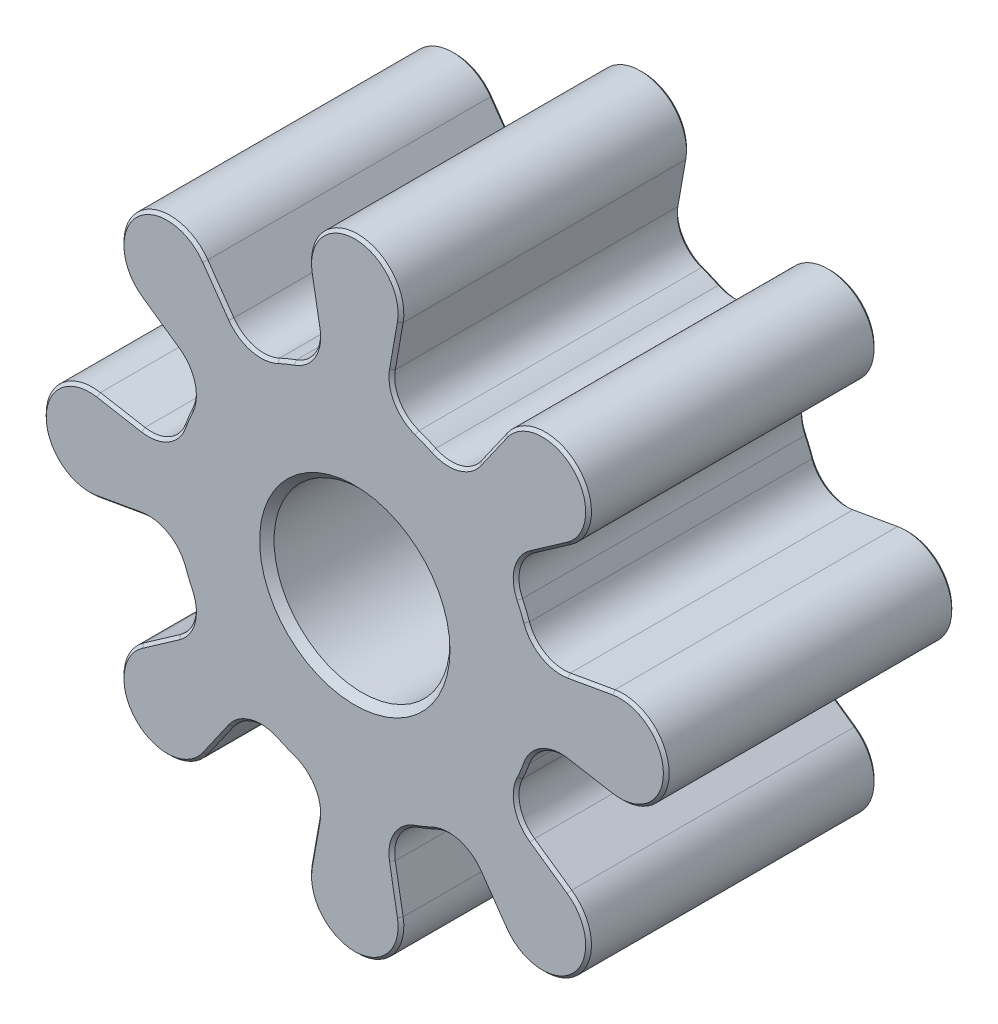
ISO-10303-21;
HEADER;
FILE_DESCRIPTION(('STEP AP214'),'2;1');
FILE_NAME('part.step','',(''),(''),'','','');
FILE_SCHEMA(('AUTOMOTIVE_DESIGN { 1 0 10303 214 1 1 1 1 }'));
ENDSEC;
DATA;
#1=APPLICATION_CONTEXT('core data for automotive mechanical design processes');
#2=APPLICATION_PROTOCOL_DEFINITION('international standard','automotive_design',2000,#1);
#3=PRODUCT_CONTEXT('',#1,'mechanical');
#4=PRODUCT('Part','Part','',(#3));
#5=PRODUCT_RELATED_PRODUCT_CATEGORY('part','',(#4));
#6=PRODUCT_DEFINITION_FORMATION('','',#4);
#7=PRODUCT_DEFINITION_CONTEXT('part definition',#1,'design');
#8=PRODUCT_DEFINITION('design','',#6,#7);
#9=PRODUCT_DEFINITION_SHAPE('','',#8);
#10=(LENGTH_UNIT() NAMED_UNIT(*) SI_UNIT(.MILLI.,.METRE.));
#11=(NAMED_UNIT(*) PLANE_ANGLE_UNIT() SI_UNIT($,.RADIAN.));
#12=(NAMED_UNIT(*) SI_UNIT($,.STERADIAN.) SOLID_ANGLE_UNIT());
#13=UNCERTAINTY_MEASURE_WITH_UNIT(LENGTH_MEASURE(1.E-05),#10,'distance_accuracy_value','');
#14=(GEOMETRIC_REPRESENTATION_CONTEXT(3) GLOBAL_UNCERTAINTY_ASSIGNED_CONTEXT((#13)) GLOBAL_UNIT_ASSIGNED_CONTEXT((#10,
#11,#12)) REPRESENTATION_CONTEXT('',''));
#15=CARTESIAN_POINT('',(0.,0.,0.));
#16=DIRECTION('',(0.,0.,1.));
#17=DIRECTION('',(1.,0.,0.));
#18=AXIS2_PLACEMENT_3D('',#15,#16,#17);
#19=CARTESIAN_POINT('',(0.,9.2,10.));
#20=DIRECTION('',(0.,0.,1.));
#21=DIRECTION('',(1.,0.,0.));
#22=AXIS2_PLACEMENT_3D('',#19,#20,#21);
#23=PLANE('',#22);
#24=CARTESIAN_POINT('',(7.15308540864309,-2.55291874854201,10.));
#25=DIRECTION('',(0.,0.,1.));
#26=DIRECTION('',(1.,0.,0.));
#27=AXIS2_PLACEMENT_3D('',#24,#25,#26);
#28=CIRCLE('',#27,1.37);
#29=CARTESIAN_POINT('',(5.86279877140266,-2.09241859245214,10.));
#30=VERTEX_POINT('',#29);
#31=CARTESIAN_POINT('',(7.39134627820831,-1.20379616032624,10.));
#32=VERTEX_POINT('',#31);
#33=EDGE_CURVE('E55',#30,#32,#28,.F.);
#34=ORIENTED_EDGE('',*,*,#33,.T.);
#35=DIRECTION('',(0.98476101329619,-0.173913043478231,0.));
#36=VECTOR('',#35,1.);
#37=CARTESIAN_POINT('',(8.93913043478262,-1.47714151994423,10.));
#38=LINE('',#37,#36);
#39=CARTESIAN_POINT('',(8.93913043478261,-1.47714151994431,10.));
#40=VERTEX_POINT('',#39);
#41=EDGE_CURVE('E11',#32,#40,#38,.T.);
#42=ORIENTED_EDGE('',*,*,#41,.T.);
#43=CARTESIAN_POINT('',(9.2,0.,10.));
#44=DIRECTION('',(0.,0.,1.));
#45=DIRECTION('',(1.,0.,0.));
#46=AXIS2_PLACEMENT_3D('',#43,#44,#45);
#47=CIRCLE('',#46,1.5);
#48=CARTESIAN_POINT('',(8.93913043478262,1.47714151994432,10.));
#49=VERTEX_POINT('',#48);
#50=EDGE_CURVE('E40',#40,#49,#47,.T.);
#51=ORIENTED_EDGE('',*,*,#50,.T.);
#52=DIRECTION('',(-0.98476101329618,-0.173913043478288,0.));
#53=VECTOR('',#52,1.);
#54=CARTESIAN_POINT('',(7.39134627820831,1.20379616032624,10.));
#55=LINE('',#54,#53);
#56=CARTESIAN_POINT('',(7.39134627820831,1.20379616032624,10.));
#57=VERTEX_POINT('',#56);
#58=EDGE_CURVE('E972',#49,#57,#55,.T.);
#59=ORIENTED_EDGE('',*,*,#58,.T.);
#60=CARTESIAN_POINT('',(7.15308540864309,2.55291874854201,10.));
#61=DIRECTION('',(0.,0.,1.));
#62=DIRECTION('',(1.,0.,0.));
#63=AXIS2_PLACEMENT_3D('',#60,#61,#62);
#64=CIRCLE('',#63,1.37);
#65=CARTESIAN_POINT('',(5.86279877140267,2.09241859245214,10.));
#66=VERTEX_POINT('',#65);
#67=EDGE_CURVE('E963',#57,#66,#64,.F.);
#68=ORIENTED_EDGE('',*,*,#67,.T.);
#69=CARTESIAN_POINT('',(0.,0.,10.));
#70=DIRECTION('',(0.,0.,1.));
#71=DIRECTION('',(1.,0.,0.));
#72=AXIS2_PLACEMENT_3D('',#69,#70,#71);
#73=CIRCLE('',#72,6.225);
#74=CARTESIAN_POINT('',(5.6251881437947,2.66606139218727,10.));
#75=VERTEX_POINT('',#74);
#76=EDGE_CURVE('E964',#66,#75,#73,.T.);
#77=ORIENTED_EDGE('',*,*,#76,.T.);
#78=CARTESIAN_POINT('',(6.86318135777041,3.25280903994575,10.));
#79=DIRECTION('',(0.,0.,1.));
#80=DIRECTION('',(1.,0.,0.));
#81=AXIS2_PLACEMENT_3D('',#78,#79,#80);
#82=CIRCLE('',#81,1.37);
#83=CARTESIAN_POINT('',(6.07768350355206,4.37525864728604,10.));
#84=VERTEX_POINT('',#83);
#85=EDGE_CURVE('E1218',#75,#84,#82,.F.);
#86=ORIENTED_EDGE('',*,*,#85,.T.);
#87=DIRECTION('',(0.819306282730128,0.573356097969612,0.));
#88=VECTOR('',#87,1.);
#89=CARTESIAN_POINT('',(7.36541653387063,5.27642296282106,10.));
#90=LINE('',#89,#88);
#91=CARTESIAN_POINT('',(7.36541653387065,5.27642296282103,10.));
#92=VERTEX_POINT('',#91);
#93=EDGE_CURVE('E1214',#84,#92,#90,.T.);
#94=ORIENTED_EDGE('',*,*,#93,.T.);
#95=CARTESIAN_POINT('',(6.50538238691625,6.50538238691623,10.));
#96=DIRECTION('',(0.,0.,1.));
#97=DIRECTION('',(1.,0.,0.));
#98=AXIS2_PLACEMENT_3D('',#95,#96,#97);
#99=CIRCLE('',#98,1.5);
#100=CARTESIAN_POINT('',(5.27642296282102,7.36541653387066,10.));
#101=VERTEX_POINT('',#100);
#102=EDGE_CURVE('E1210',#92,#101,#99,.T.);
#103=ORIENTED_EDGE('',*,*,#102,.T.);
#104=DIRECTION('',(-0.573356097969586,-0.819306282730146,0.));
#105=VECTOR('',#104,1.);
#106=CARTESIAN_POINT('',(4.37525864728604,6.07768350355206,10.));
#107=LINE('',#106,#105);
#108=CARTESIAN_POINT('',(4.37525864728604,6.07768350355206,10.));
#109=VERTEX_POINT('',#108);
#110=EDGE_CURVE('E1206',#101,#109,#107,.T.);
#111=ORIENTED_EDGE('',*,*,#110,.T.);
#112=CARTESIAN_POINT('',(3.25280903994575,6.8631813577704,10.));
#113=DIRECTION('',(0.,0.,1.));
#114=DIRECTION('',(1.,0.,0.));
#115=AXIS2_PLACEMENT_3D('',#112,#113,#114);
#116=CIRCLE('',#115,1.37);
#117=CARTESIAN_POINT('',(2.66606139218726,5.6251881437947,10.));
#118=VERTEX_POINT('',#117);
#119=EDGE_CURVE('E1202',#109,#118,#116,.F.);
#120=ORIENTED_EDGE('',*,*,#119,.T.);
#121=CARTESIAN_POINT('',(0.,0.,10.));
#122=DIRECTION('',(0.,0.,1.));
#123=DIRECTION('',(1.,0.,0.));
#124=AXIS2_PLACEMENT_3D('',#121,#122,#123);
#125=CIRCLE('',#124,6.225);
#126=CARTESIAN_POINT('',(2.09241859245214,5.86279877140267,10.));
#127=VERTEX_POINT('',#126);
#128=EDGE_CURVE('E1198',#118,#127,#125,.T.);
#129=ORIENTED_EDGE('',*,*,#128,.T.);
#130=CARTESIAN_POINT('',(2.55291874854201,7.15308540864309,10.));
#131=DIRECTION('',(0.,0.,1.));
#132=DIRECTION('',(1.,0.,0.));
#133=AXIS2_PLACEMENT_3D('',#130,#131,#132);
#134=CIRCLE('',#133,1.37);
#135=CARTESIAN_POINT('',(1.20379616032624,7.39134627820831,10.));
#136=VERTEX_POINT('',#135);
#137=EDGE_CURVE('E1194',#127,#136,#134,.F.);
#138=ORIENTED_EDGE('',*,*,#137,.T.);
#139=DIRECTION('',(0.173913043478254,0.984761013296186,0.));
#140=VECTOR('',#139,1.);
#141=CARTESIAN_POINT('',(1.47714151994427,8.93913043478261,10.));
#142=LINE('',#141,#140);
#143=CARTESIAN_POINT('',(1.47714151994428,8.93913043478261,10.));
#144=VERTEX_POINT('',#143);
#145=EDGE_CURVE('E1190',#136,#144,#142,.T.);
#146=ORIENTED_EDGE('',*,*,#145,.T.);
#147=CARTESIAN_POINT('',(0.,9.2,10.));
#148=DIRECTION('',(0.,0.,1.));
#149=DIRECTION('',(1.,0.,0.));
#150=AXIS2_PLACEMENT_3D('',#147,#148,#149);
#151=CIRCLE('',#150,1.5);
#152=CARTESIAN_POINT('',(-1.47714151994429,8.93913043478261,10.));
#153=VERTEX_POINT('',#152);
#154=EDGE_CURVE('E1186',#144,#153,#151,.T.);
#155=ORIENTED_EDGE('',*,*,#154,.T.);
#156=DIRECTION('',(0.173913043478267,-0.984761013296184,0.));
#157=VECTOR('',#156,1.);
#158=CARTESIAN_POINT('',(-1.20379616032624,7.39134627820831,10.));
#159=LINE('',#158,#157);
#160=CARTESIAN_POINT('',(-1.20379616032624,7.39134627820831,10.));
#161=VERTEX_POINT('',#160);
#162=EDGE_CURVE('E1182',#153,#161,#159,.T.);
#163=ORIENTED_EDGE('',*,*,#162,.T.);
#164=CARTESIAN_POINT('',(-2.55291874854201,7.15308540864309,10.));
#165=DIRECTION('',(0.,0.,1.));
#166=DIRECTION('',(1.,0.,0.));
#167=AXIS2_PLACEMENT_3D('',#164,#165,#166);
#168=CIRCLE('',#167,1.37);
#169=CARTESIAN_POINT('',(-2.09241859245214,5.86279877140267,10.));
#170=VERTEX_POINT('',#169);
#171=EDGE_CURVE('E1178',#161,#170,#168,.F.);
#172=ORIENTED_EDGE('',*,*,#171,.T.);
#173=CARTESIAN_POINT('',(0.,0.,10.));
#174=DIRECTION('',(0.,0.,1.));
#175=DIRECTION('',(1.,0.,0.));
#176=AXIS2_PLACEMENT_3D('',#173,#174,#175);
#177=CIRCLE('',#176,6.225);
#178=CARTESIAN_POINT('',(-2.66606139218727,5.6251881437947,10.));
#179=VERTEX_POINT('',#178);
#180=EDGE_CURVE('E1174',#170,#179,#177,.T.);
#181=ORIENTED_EDGE('',*,*,#180,.T.);
#182=CARTESIAN_POINT('',(-3.25280903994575,6.8631813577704,10.));
#183=DIRECTION('',(0.,0.,1.));
#184=DIRECTION('',(1.,0.,0.));
#185=AXIS2_PLACEMENT_3D('',#182,#183,#184);
#186=CIRCLE('',#185,1.37);
#187=CARTESIAN_POINT('',(-4.37525864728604,6.07768350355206,10.));
#188=VERTEX_POINT('',#187);
#189=EDGE_CURVE('E1170',#179,#188,#186,.F.);
#190=ORIENTED_EDGE('',*,*,#189,.T.);
#191=DIRECTION('',(-0.573356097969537,0.819306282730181,0.));
#192=VECTOR('',#191,1.);
#193=CARTESIAN_POINT('',(-5.27642296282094,7.36541653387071,10.));
#194=LINE('',#193,#192);
#195=CARTESIAN_POINT('',(-5.27642296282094,7.3654165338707,10.));
#196=VERTEX_POINT('',#195);
#197=EDGE_CURVE('E1166',#188,#196,#194,.T.);
#198=ORIENTED_EDGE('',*,*,#197,.T.);
#199=CARTESIAN_POINT('',(-6.50538238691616,6.50538238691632,10.));
#200=DIRECTION('',(0.,0.,1.));
#201=DIRECTION('',(1.,0.,0.));
#202=AXIS2_PLACEMENT_3D('',#199,#200,#201);
#203=CIRCLE('',#202,1.5);
#204=CARTESIAN_POINT('',(-7.36541653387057,5.27642296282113,10.));
#205=VERTEX_POINT('',#204);
#206=EDGE_CURVE('E1162',#196,#205,#203,.T.);
#207=ORIENTED_EDGE('',*,*,#206,.T.);
#208=DIRECTION('',(0.819306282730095,-0.57335609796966,0.));
#209=VECTOR('',#208,1.);
#210=CARTESIAN_POINT('',(-6.07768350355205,4.37525864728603,10.));
#211=LINE('',#210,#209);
#212=CARTESIAN_POINT('',(-6.07768350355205,4.37525864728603,10.));
#213=VERTEX_POINT('',#212);
#214=EDGE_CURVE('E1158',#205,#213,#211,.T.);
#215=ORIENTED_EDGE('',*,*,#214,.T.);
#216=CARTESIAN_POINT('',(-6.86318135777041,3.25280903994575,10.));
#217=DIRECTION('',(0.,0.,1.));
#218=DIRECTION('',(1.,0.,0.));
#219=AXIS2_PLACEMENT_3D('',#216,#217,#218);
#220=CIRCLE('',#219,1.37);
#221=CARTESIAN_POINT('',(-5.6251881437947,2.66606139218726,10.));
#222=VERTEX_POINT('',#221);
#223=EDGE_CURVE('E1154',#213,#222,#220,.F.);
#224=ORIENTED_EDGE('',*,*,#223,.T.);
#225=CARTESIAN_POINT('',(0.,0.,10.));
#226=DIRECTION('',(0.,0.,1.));
#227=DIRECTION('',(1.,0.,0.));
#228=AXIS2_PLACEMENT_3D('',#225,#226,#227);
#229=CIRCLE('',#228,6.225);
#230=CARTESIAN_POINT('',(-5.86279877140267,2.09241859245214,10.));
#231=VERTEX_POINT('',#230);
#232=EDGE_CURVE('E1150',#222,#231,#229,.T.);
#233=ORIENTED_EDGE('',*,*,#232,.T.);
#234=CARTESIAN_POINT('',(-7.15308540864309,2.55291874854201,10.));
#235=DIRECTION('',(0.,0.,1.));
#236=DIRECTION('',(1.,0.,0.));
#237=AXIS2_PLACEMENT_3D('',#234,#235,#236);
#238=CIRCLE('',#237,1.37);
#239=CARTESIAN_POINT('',(-7.39134627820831,1.20379616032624,10.));
#240=VERTEX_POINT('',#239);
#241=EDGE_CURVE('E1146',#231,#240,#238,.F.);
#242=ORIENTED_EDGE('',*,*,#241,.T.);
#243=DIRECTION('',(-0.984761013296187,0.17391304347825,0.));
#244=VECTOR('',#243,1.);
#245=CARTESIAN_POINT('',(-8.93913043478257,1.47714151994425,10.));
#246=LINE('',#245,#244);
#247=CARTESIAN_POINT('',(-8.93913043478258,1.47714151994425,10.));
#248=VERTEX_POINT('',#247);
#249=EDGE_CURVE('E1142',#240,#248,#246,.T.);
#250=ORIENTED_EDGE('',*,*,#249,.T.);
#251=CARTESIAN_POINT('',(-9.2,0.,10.));
#252=DIRECTION('',(0.,0.,1.));
#253=DIRECTION('',(1.,0.,0.));
#254=AXIS2_PLACEMENT_3D('',#251,#252,#253);
#255=CIRCLE('',#254,1.50000000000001);
#256=CARTESIAN_POINT('',(-8.93913043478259,-1.47714151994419,10.));
#257=VERTEX_POINT('',#256);
#258=EDGE_CURVE('E1144',#248,#257,#255,.T.);
#259=ORIENTED_EDGE('',*,*,#258,.T.);
#260=DIRECTION('',(0.984761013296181,0.173913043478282,0.));
#261=VECTOR('',#260,1.);
#262=CARTESIAN_POINT('',(-7.39134627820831,-1.20379616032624,10.));
#263=LINE('',#262,#261);
#264=CARTESIAN_POINT('',(-7.39134627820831,-1.20379616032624,10.));
#265=VERTEX_POINT('',#264);
#266=EDGE_CURVE('E1148',#257,#265,#263,.T.);
#267=ORIENTED_EDGE('',*,*,#266,.T.);
#268=CARTESIAN_POINT('',(-7.15308540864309,-2.55291874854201,10.));
#269=DIRECTION('',(0.,0.,1.));
#270=DIRECTION('',(1.,0.,0.));
#271=AXIS2_PLACEMENT_3D('',#268,#269,#270);
#272=CIRCLE('',#271,1.37);
#273=CARTESIAN_POINT('',(-5.86279877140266,-2.09241859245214,10.));
#274=VERTEX_POINT('',#273);
#275=EDGE_CURVE('E1152',#265,#274,#272,.F.);
#276=ORIENTED_EDGE('',*,*,#275,.T.);
#277=CARTESIAN_POINT('',(0.,0.,10.));
#278=DIRECTION('',(0.,0.,1.));
#279=DIRECTION('',(1.,0.,0.));
#280=AXIS2_PLACEMENT_3D('',#277,#278,#279);
#281=CIRCLE('',#280,6.225);
#282=CARTESIAN_POINT('',(-5.6251881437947,-2.66606139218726,10.));
#283=VERTEX_POINT('',#282);
#284=EDGE_CURVE('E1156',#274,#283,#281,.T.);
#285=ORIENTED_EDGE('',*,*,#284,.T.);
#286=CARTESIAN_POINT('',(-6.86318135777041,-3.25280903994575,10.));
#287=DIRECTION('',(0.,0.,1.));
#288=DIRECTION('',(1.,0.,0.));
#289=AXIS2_PLACEMENT_3D('',#286,#287,#288);
#290=CIRCLE('',#289,1.37);
#291=CARTESIAN_POINT('',(-6.07768350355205,-4.37525864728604,10.));
#292=VERTEX_POINT('',#291);
#293=EDGE_CURVE('E1160',#283,#292,#290,.F.);
#294=ORIENTED_EDGE('',*,*,#293,.T.);
#295=DIRECTION('',(-0.819306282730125,-0.573356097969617,0.));
#296=VECTOR('',#295,1.);
#297=CARTESIAN_POINT('',(-7.36541653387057,-5.27642296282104,10.));
#298=LINE('',#297,#296);
#299=CARTESIAN_POINT('',(-7.36541653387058,-5.27642296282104,10.));
#300=VERTEX_POINT('',#299);
#301=EDGE_CURVE('E1164',#292,#300,#298,.T.);
#302=ORIENTED_EDGE('',*,*,#301,.T.);
#303=CARTESIAN_POINT('',(-6.5053823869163,-6.50538238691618,10.));
#304=DIRECTION('',(0.,0.,1.));
#305=DIRECTION('',(1.,0.,0.));
#306=AXIS2_PLACEMENT_3D('',#303,#304,#305);
#307=CIRCLE('',#306,1.50000000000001);
#308=CARTESIAN_POINT('',(-5.27642296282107,-7.36541653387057,10.));
#309=VERTEX_POINT('',#308);
#310=EDGE_CURVE('E1168',#300,#309,#307,.T.);
#311=ORIENTED_EDGE('',*,*,#310,.T.);
#312=DIRECTION('',(0.573356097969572,0.819306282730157,0.));
#313=VECTOR('',#312,1.);
#314=CARTESIAN_POINT('',(-4.37525864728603,-6.07768350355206,10.));
#315=LINE('',#314,#313);
#316=CARTESIAN_POINT('',(-4.37525864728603,-6.07768350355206,10.));
#317=VERTEX_POINT('',#316);
#318=EDGE_CURVE('E1172',#309,#317,#315,.T.);
#319=ORIENTED_EDGE('',*,*,#318,.T.);
#320=CARTESIAN_POINT('',(-3.25280903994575,-6.8631813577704,10.));
#321=DIRECTION('',(0.,0.,1.));
#322=DIRECTION('',(1.,0.,0.));
#323=AXIS2_PLACEMENT_3D('',#320,#321,#322);
#324=CIRCLE('',#323,1.37);
#325=CARTESIAN_POINT('',(-2.66606139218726,-5.62518814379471,10.));
#326=VERTEX_POINT('',#325);
#327=EDGE_CURVE('E1176',#317,#326,#324,.F.);
#328=ORIENTED_EDGE('',*,*,#327,.T.);
#329=CARTESIAN_POINT('',(0.,0.,10.));
#330=DIRECTION('',(0.,0.,1.));
#331=DIRECTION('',(1.,0.,0.));
#332=AXIS2_PLACEMENT_3D('',#329,#330,#331);
#333=CIRCLE('',#332,6.225);
#334=CARTESIAN_POINT('',(-2.09241859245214,-5.86279877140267,10.));
#335=VERTEX_POINT('',#334);
#336=EDGE_CURVE('E1180',#326,#335,#333,.T.);
#337=ORIENTED_EDGE('',*,*,#336,.T.);
#338=CARTESIAN_POINT('',(-2.55291874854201,-7.15308540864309,10.));
#339=DIRECTION('',(0.,0.,1.));
#340=DIRECTION('',(1.,0.,0.));
#341=AXIS2_PLACEMENT_3D('',#338,#339,#340);
#342=CIRCLE('',#341,1.37);
#343=CARTESIAN_POINT('',(-1.20379616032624,-7.39134627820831,10.));
#344=VERTEX_POINT('',#343);
#345=EDGE_CURVE('E1184',#335,#344,#342,.F.);
#346=ORIENTED_EDGE('',*,*,#345,.T.);
#347=DIRECTION('',(-0.173913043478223,-0.984761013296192,0.));
#348=VECTOR('',#347,1.);
#349=CARTESIAN_POINT('',(-1.47714151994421,-8.93913043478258,10.));
#350=LINE('',#349,#348);
#351=CARTESIAN_POINT('',(-1.47714151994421,-8.93913043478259,10.));
#352=VERTEX_POINT('',#351);
#353=EDGE_CURVE('E1188',#344,#352,#350,.T.);
#354=ORIENTED_EDGE('',*,*,#353,.T.);
#355=CARTESIAN_POINT('',(0.,-9.2,10.));
#356=DIRECTION('',(0.,0.,1.));
#357=DIRECTION('',(1.,0.,0.));
#358=AXIS2_PLACEMENT_3D('',#355,#356,#357);
#359=CIRCLE('',#358,1.5);
#360=CARTESIAN_POINT('',(1.47714151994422,-8.93913043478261,10.));
#361=VERTEX_POINT('',#360);
#362=EDGE_CURVE('E1192',#352,#361,#359,.T.);
#363=ORIENTED_EDGE('',*,*,#362,.T.);
#364=DIRECTION('',(-0.173913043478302,0.984761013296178,0.));
#365=VECTOR('',#364,1.);
#366=CARTESIAN_POINT('',(1.20379616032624,-7.39134627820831,10.));
#367=LINE('',#366,#365);
#368=CARTESIAN_POINT('',(1.20379616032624,-7.39134627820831,10.));
#369=VERTEX_POINT('',#368);
#370=EDGE_CURVE('E1196',#361,#369,#367,.T.);
#371=ORIENTED_EDGE('',*,*,#370,.T.);
#372=CARTESIAN_POINT('',(2.55291874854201,-7.15308540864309,10.));
#373=DIRECTION('',(0.,0.,1.));
#374=DIRECTION('',(1.,0.,0.));
#375=AXIS2_PLACEMENT_3D('',#372,#373,#374);
#376=CIRCLE('',#375,1.37);
#377=CARTESIAN_POINT('',(2.09241859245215,-5.86279877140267,10.));
#378=VERTEX_POINT('',#377);
#379=EDGE_CURVE('E1200',#369,#378,#376,.F.);
#380=ORIENTED_EDGE('',*,*,#379,.T.);
#381=CARTESIAN_POINT('',(0.,0.,10.));
#382=DIRECTION('',(0.,0.,1.));
#383=DIRECTION('',(1.,0.,0.));
#384=AXIS2_PLACEMENT_3D('',#381,#382,#383);
#385=CIRCLE('',#384,6.225);
#386=CARTESIAN_POINT('',(2.66606139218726,-5.6251881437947,10.));
#387=VERTEX_POINT('',#386);
#388=EDGE_CURVE('E1204',#378,#387,#385,.T.);
#389=ORIENTED_EDGE('',*,*,#388,.T.);
#390=CARTESIAN_POINT('',(3.25280903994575,-6.86318135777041,10.));
#391=DIRECTION('',(0.,0.,1.));
#392=DIRECTION('',(1.,0.,0.));
#393=AXIS2_PLACEMENT_3D('',#390,#391,#392);
#394=CIRCLE('',#393,1.37);
#395=CARTESIAN_POINT('',(4.37525864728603,-6.07768350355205,10.));
#396=VERTEX_POINT('',#395);
#397=EDGE_CURVE('E1208',#387,#396,#394,.F.);
#398=ORIENTED_EDGE('',*,*,#397,.T.);
#399=DIRECTION('',(0.573356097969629,-0.819306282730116,0.));
#400=VECTOR('',#399,1.);
#401=CARTESIAN_POINT('',(5.27642296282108,-7.36541653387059,10.));
#402=LINE('',#401,#400);
#403=CARTESIAN_POINT('',(5.27642296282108,-7.36541653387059,10.));
#404=VERTEX_POINT('',#403);
#405=EDGE_CURVE('E1212',#396,#404,#402,.T.);
#406=ORIENTED_EDGE('',*,*,#405,.T.);
#407=CARTESIAN_POINT('',(6.5053823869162,-6.50538238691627,10.));
#408=DIRECTION('',(0.,0.,1.));
#409=DIRECTION('',(1.,0.,0.));
#410=AXIS2_PLACEMENT_3D('',#407,#408,#409);
#411=CIRCLE('',#410,1.5);
#412=CARTESIAN_POINT('',(7.36541653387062,-5.27642296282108,10.));
#413=VERTEX_POINT('',#412);
#414=EDGE_CURVE('E1216',#404,#413,#411,.T.);
#415=ORIENTED_EDGE('',*,*,#414,.T.);
#416=DIRECTION('',(-0.81930628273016,0.573356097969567,0.));
#417=VECTOR('',#416,1.);
#418=CARTESIAN_POINT('',(6.07768350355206,-4.37525864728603,10.));
#419=LINE('',#418,#417);
#420=CARTESIAN_POINT('',(6.07768350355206,-4.37525864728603,10.));
#421=VERTEX_POINT('',#420);
#422=EDGE_CURVE('E665',#413,#421,#419,.T.);
#423=ORIENTED_EDGE('',*,*,#422,.T.);
#424=CARTESIAN_POINT('',(6.8631813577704,-3.25280903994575,10.));
#425=DIRECTION('',(0.,0.,1.));
#426=DIRECTION('',(1.,0.,0.));
#427=AXIS2_PLACEMENT_3D('',#424,#425,#426);
#428=CIRCLE('',#427,1.37);
#429=CARTESIAN_POINT('',(5.62518814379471,-2.66606139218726,10.));
#430=VERTEX_POINT('',#429);
#431=EDGE_CURVE('E961',#421,#430,#428,.F.);
#432=ORIENTED_EDGE('',*,*,#431,.T.);
#433=CARTESIAN_POINT('',(0.,0.,10.));
#434=DIRECTION('',(0.,0.,1.));
#435=DIRECTION('',(1.,0.,0.));
#436=AXIS2_PLACEMENT_3D('',#433,#434,#435);
#437=CIRCLE('',#436,6.225);
#438=EDGE_CURVE('E966',#430,#30,#437,.T.);
#439=ORIENTED_EDGE('',*,*,#438,.T.);
#440=EDGE_LOOP('',(#34,#42,#51,#59,#68,#77,#86,#94,#103,#111,#120,#129,#138,#146,#155,#163,#172,
#181,#190,#198,#207,#215,#224,#233,#242,#250,#259,#267,#276,#285,#294,#302,#311,#319,#328,#337,
#346,#354,#363,#371,#380,#389,#398,#406,#415,#423,#432,#439));
#441=FACE_BOUND('',#440,.T.);
#442=CARTESIAN_POINT('',(0.,0.,10.));
#443=DIRECTION('',(0.,0.,1.));
#444=DIRECTION('',(1.,0.,0.));
#445=AXIS2_PLACEMENT_3D('',#442,#443,#444);
#446=CIRCLE('',#445,3.30000000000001);
#447=CARTESIAN_POINT('',(3.30000000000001,0.,10.));
#448=VERTEX_POINT('',#447);
#449=EDGE_CURVE('E662',#448,#448,#446,.F.);
#450=ORIENTED_EDGE('',*,*,#449,.T.);
#451=EDGE_LOOP('',(#450));
#452=FACE_BOUND('',#451,.T.);
#453=ADVANCED_FACE('F31',(#441,#452),#23,.T.);
#454=CARTESIAN_POINT('',(0.,9.2,0.));
#455=DIRECTION('',(0.,0.,1.));
#456=DIRECTION('',(1.,0.,0.));
#457=AXIS2_PLACEMENT_3D('',#454,#455,#456);
#458=PLANE('',#457);
#459=DIRECTION('',(0.81930628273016,-0.573356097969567,0.));
#460=VECTOR('',#459,1.);
#461=CARTESIAN_POINT('',(-4.37907474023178,2.94245175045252,0.));
#462=LINE('',#461,#460);
#463=CARTESIAN_POINT('',(6.07768350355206,-4.37525864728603,0.));
#464=VERTEX_POINT('',#463);
#465=CARTESIAN_POINT('',(7.36541653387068,-5.27642296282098,0.));
#466=VERTEX_POINT('',#465);
#467=EDGE_CURVE('E1574',#464,#466,#462,.T.);
#468=ORIENTED_EDGE('',*,*,#467,.T.);
#469=CARTESIAN_POINT('',(6.5053823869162,-6.50538238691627,0.));
#470=DIRECTION('',(0.,0.,1.));
#471=DIRECTION('',(1.,0.,0.));
#472=AXIS2_PLACEMENT_3D('',#469,#470,#471);
#473=CIRCLE('',#472,1.5);
#474=CARTESIAN_POINT('',(5.27642296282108,-7.3654165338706,0.));
#475=VERTEX_POINT('',#474);
#476=EDGE_CURVE('E640',#466,#475,#473,.F.);
#477=ORIENTED_EDGE('',*,*,#476,.T.);
#478=DIRECTION('',(-0.573356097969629,0.819306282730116,0.));
#479=VECTOR('',#478,1.);
#480=CARTESIAN_POINT('',(-4.23980850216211,6.23295323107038,0.));
#481=LINE('',#480,#479);
#482=CARTESIAN_POINT('',(4.37525864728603,-6.07768350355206,0.));
#483=VERTEX_POINT('',#482);
#484=EDGE_CURVE('E1572',#475,#483,#481,.T.);
#485=ORIENTED_EDGE('',*,*,#484,.T.);
#486=CARTESIAN_POINT('',(3.25280903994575,-6.86318135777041,0.));
#487=DIRECTION('',(0.,0.,1.));
#488=DIRECTION('',(1.,0.,0.));
#489=AXIS2_PLACEMENT_3D('',#486,#487,#488);
#490=CIRCLE('',#489,1.37);
#491=CARTESIAN_POINT('',(2.66606139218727,-5.62518814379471,0.));
#492=VERTEX_POINT('',#491);
#493=EDGE_CURVE('E1568',#483,#492,#490,.T.);
#494=ORIENTED_EDGE('',*,*,#493,.T.);
#495=CARTESIAN_POINT('',(0.,0.,0.));
#496=DIRECTION('',(0.,0.,1.));
#497=DIRECTION('',(1.,0.,0.));
#498=AXIS2_PLACEMENT_3D('',#495,#496,#497);
#499=CIRCLE('',#498,6.225);
#500=CARTESIAN_POINT('',(2.09241859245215,-5.86279877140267,0.));
#501=VERTEX_POINT('',#500);
#502=EDGE_CURVE('E1564',#492,#501,#499,.F.);
#503=ORIENTED_EDGE('',*,*,#502,.T.);
#504=CARTESIAN_POINT('',(2.55291874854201,-7.15308540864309,0.));
#505=DIRECTION('',(0.,0.,1.));
#506=DIRECTION('',(1.,0.,0.));
#507=AXIS2_PLACEMENT_3D('',#504,#505,#506);
#508=CIRCLE('',#507,1.36999999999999);
#509=CARTESIAN_POINT('',(1.20379616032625,-7.39134627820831,0.));
#510=VERTEX_POINT('',#509);
#511=EDGE_CURVE('E1560',#501,#510,#508,.T.);
#512=ORIENTED_EDGE('',*,*,#511,.T.);
#513=DIRECTION('',(0.173913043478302,-0.984761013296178,0.));
#514=VECTOR('',#513,1.);
#515=CARTESIAN_POINT('',(-1.67409372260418,8.90434782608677,0.));
#516=LINE('',#515,#514);
#517=CARTESIAN_POINT('',(1.47714151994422,-8.93913043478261,0.));
#518=VERTEX_POINT('',#517);
#519=EDGE_CURVE('E1556',#510,#518,#516,.T.);
#520=ORIENTED_EDGE('',*,*,#519,.T.);
#521=CARTESIAN_POINT('',(0.,-9.2,0.));
#522=DIRECTION('',(0.,0.,1.));
#523=DIRECTION('',(1.,0.,0.));
#524=AXIS2_PLACEMENT_3D('',#521,#522,#523);
#525=CIRCLE('',#524,1.50000000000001);
#526=CARTESIAN_POINT('',(-1.47714151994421,-8.93913043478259,0.));
#527=VERTEX_POINT('',#526);
#528=EDGE_CURVE('E1552',#518,#527,#525,.F.);
#529=ORIENTED_EDGE('',*,*,#528,.T.);
#530=DIRECTION('',(0.173913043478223,0.984761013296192,0.));
#531=VECTOR('',#530,1.);
#532=CARTESIAN_POINT('',(1.6740937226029,8.90434782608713,0.));
#533=LINE('',#532,#531);
#534=CARTESIAN_POINT('',(-1.20379616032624,-7.3913462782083,0.));
#535=VERTEX_POINT('',#534);
#536=EDGE_CURVE('E1548',#527,#535,#533,.T.);
#537=ORIENTED_EDGE('',*,*,#536,.T.);
#538=CARTESIAN_POINT('',(-2.55291874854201,-7.15308540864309,0.));
#539=DIRECTION('',(0.,0.,1.));
#540=DIRECTION('',(1.,0.,0.));
#541=AXIS2_PLACEMENT_3D('',#538,#539,#540);
#542=CIRCLE('',#541,1.37);
#543=CARTESIAN_POINT('',(-2.09241859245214,-5.86279877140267,0.));
#544=VERTEX_POINT('',#543);
#545=EDGE_CURVE('E1544',#535,#544,#542,.T.);
#546=ORIENTED_EDGE('',*,*,#545,.T.);
#547=CARTESIAN_POINT('',(0.,0.,0.));
#548=DIRECTION('',(0.,0.,1.));
#549=DIRECTION('',(1.,0.,0.));
#550=AXIS2_PLACEMENT_3D('',#547,#548,#549);
#551=CIRCLE('',#550,6.225);
#552=CARTESIAN_POINT('',(-2.66606139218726,-5.62518814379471,0.));
#553=VERTEX_POINT('',#552);
#554=EDGE_CURVE('E1540',#544,#553,#551,.F.);
#555=ORIENTED_EDGE('',*,*,#554,.T.);
#556=CARTESIAN_POINT('',(-3.25280903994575,-6.8631813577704,0.));
#557=DIRECTION('',(0.,0.,1.));
#558=DIRECTION('',(1.,0.,0.));
#559=AXIS2_PLACEMENT_3D('',#556,#557,#558);
#560=CIRCLE('',#559,1.36999999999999);
#561=CARTESIAN_POINT('',(-4.37525864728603,-6.07768350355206,0.));
#562=VERTEX_POINT('',#561);
#563=EDGE_CURVE('E1536',#553,#562,#560,.T.);
#564=ORIENTED_EDGE('',*,*,#563,.T.);
#565=DIRECTION('',(-0.573356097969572,-0.819306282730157,0.));
#566=VECTOR('',#565,1.);
#567=CARTESIAN_POINT('',(4.23980850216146,6.23295323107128,0.));
#568=LINE('',#567,#566);
#569=CARTESIAN_POINT('',(-5.27642296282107,-7.36541653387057,0.));
#570=VERTEX_POINT('',#569);
#571=EDGE_CURVE('E1532',#562,#570,#568,.T.);
#572=ORIENTED_EDGE('',*,*,#571,.T.);
#573=CARTESIAN_POINT('',(-6.5053823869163,-6.50538238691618,0.));
#574=DIRECTION('',(0.,0.,1.));
#575=DIRECTION('',(1.,0.,0.));
#576=AXIS2_PLACEMENT_3D('',#573,#574,#575);
#577=CIRCLE('',#576,1.50000000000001);
#578=CARTESIAN_POINT('',(-7.36541653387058,-5.27642296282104,0.));
#579=VERTEX_POINT('',#578);
#580=EDGE_CURVE('E1528',#570,#579,#577,.F.);
#581=ORIENTED_EDGE('',*,*,#580,.T.);
#582=DIRECTION('',(0.819306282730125,0.573356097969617,0.));
#583=VECTOR('',#582,1.);
#584=CARTESIAN_POINT('',(4.37907474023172,2.94245175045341,0.));
#585=LINE('',#584,#583);
#586=CARTESIAN_POINT('',(-6.07768350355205,-4.37525864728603,0.));
#587=VERTEX_POINT('',#586);
#588=EDGE_CURVE('E1524',#579,#587,#585,.T.);
#589=ORIENTED_EDGE('',*,*,#588,.T.);
#590=CARTESIAN_POINT('',(-6.86318135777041,-3.25280903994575,0.));
#591=DIRECTION('',(0.,0.,1.));
#592=DIRECTION('',(1.,0.,0.));
#593=AXIS2_PLACEMENT_3D('',#590,#591,#592);
#594=CIRCLE('',#593,1.37);
#595=CARTESIAN_POINT('',(-5.62518814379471,-2.66606139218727,0.));
#596=VERTEX_POINT('',#595);
#597=EDGE_CURVE('E1520',#587,#596,#594,.T.);
#598=ORIENTED_EDGE('',*,*,#597,.T.);
#599=CARTESIAN_POINT('',(0.,0.,0.));
#600=DIRECTION('',(0.,0.,1.));
#601=DIRECTION('',(1.,0.,0.));
#602=AXIS2_PLACEMENT_3D('',#599,#600,#601);
#603=CIRCLE('',#602,6.225);
#604=CARTESIAN_POINT('',(-5.86279877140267,-2.09241859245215,0.));
#605=VERTEX_POINT('',#604);
#606=EDGE_CURVE('E1516',#596,#605,#603,.F.);
#607=ORIENTED_EDGE('',*,*,#606,.T.);
#608=CARTESIAN_POINT('',(-7.15308540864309,-2.55291874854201,0.));
#609=DIRECTION('',(0.,0.,1.));
#610=DIRECTION('',(1.,0.,0.));
#611=AXIS2_PLACEMENT_3D('',#608,#609,#610);
#612=CIRCLE('',#611,1.36999999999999);
#613=CARTESIAN_POINT('',(-7.39134627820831,-1.20379616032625,0.));
#614=VERTEX_POINT('',#613);
#615=EDGE_CURVE('E1512',#605,#614,#612,.T.);
#616=ORIENTED_EDGE('',*,*,#615,.T.);
#617=DIRECTION('',(-0.984761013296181,-0.173913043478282,0.));
#618=VECTOR('',#617,1.);
#619=CARTESIAN_POINT('',(1.55822631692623,0.37673697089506,0.));
#620=LINE('',#619,#618);
#621=CARTESIAN_POINT('',(-8.93913043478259,-1.47714151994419,0.));
#622=VERTEX_POINT('',#621);
#623=EDGE_CURVE('E1508',#614,#622,#620,.T.);
#624=ORIENTED_EDGE('',*,*,#623,.T.);
#625=CARTESIAN_POINT('',(-9.2,0.,0.));
#626=DIRECTION('',(0.,0.,1.));
#627=DIRECTION('',(1.,0.,0.));
#628=AXIS2_PLACEMENT_3D('',#625,#626,#627);
#629=CIRCLE('',#628,1.50000000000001);
#630=CARTESIAN_POINT('',(-8.93913043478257,1.47714151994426,0.));
#631=VERTEX_POINT('',#630);
#632=EDGE_CURVE('E1504',#622,#631,#629,.F.);
#633=ORIENTED_EDGE('',*,*,#632,.T.);
#634=DIRECTION('',(0.984761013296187,-0.17391304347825,0.));
#635=VECTOR('',#634,1.);
#636=CARTESIAN_POINT('',(-1.59300892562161,0.179784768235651,0.));
#637=LINE('',#636,#635);
#638=CARTESIAN_POINT('',(-7.39134627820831,1.20379616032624,0.));
#639=VERTEX_POINT('',#638);
#640=EDGE_CURVE('E1500',#631,#639,#637,.T.);
#641=ORIENTED_EDGE('',*,*,#640,.T.);
#642=CARTESIAN_POINT('',(-7.15308540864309,2.55291874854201,0.));
#643=DIRECTION('',(0.,0.,1.));
#644=DIRECTION('',(1.,0.,0.));
#645=AXIS2_PLACEMENT_3D('',#642,#643,#644);
#646=CIRCLE('',#645,1.37);
#647=CARTESIAN_POINT('',(-5.86279877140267,2.09241859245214,0.));
#648=VERTEX_POINT('',#647);
#649=EDGE_CURVE('E1496',#639,#648,#646,.T.);
#650=ORIENTED_EDGE('',*,*,#649,.T.);
#651=CARTESIAN_POINT('',(0.,0.,0.));
#652=DIRECTION('',(0.,0.,1.));
#653=DIRECTION('',(1.,0.,0.));
#654=AXIS2_PLACEMENT_3D('',#651,#652,#653);
#655=CIRCLE('',#654,6.225);
#656=CARTESIAN_POINT('',(-5.62518814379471,2.66606139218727,0.));
#657=VERTEX_POINT('',#656);
#658=EDGE_CURVE('E1492',#648,#657,#655,.F.);
#659=ORIENTED_EDGE('',*,*,#658,.T.);
#660=CARTESIAN_POINT('',(-6.86318135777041,3.25280903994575,0.));
#661=DIRECTION('',(0.,0.,1.));
#662=DIRECTION('',(1.,0.,0.));
#663=AXIS2_PLACEMENT_3D('',#660,#661,#662);
#664=CIRCLE('',#663,1.37);
#665=CARTESIAN_POINT('',(-6.07768350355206,4.37525864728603,0.));
#666=VERTEX_POINT('',#665);
#667=EDGE_CURVE('E1488',#657,#666,#664,.T.);
#668=ORIENTED_EDGE('',*,*,#667,.T.);
#669=DIRECTION('',(-0.819306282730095,0.57335609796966,0.));
#670=VECTOR('',#669,1.);
#671=CARTESIAN_POINT('',(-4.26440352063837,3.1063130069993,0.));
#672=LINE('',#671,#670);
#673=CARTESIAN_POINT('',(-7.36541653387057,5.27642296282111,0.));
#674=VERTEX_POINT('',#673);
#675=EDGE_CURVE('E1484',#666,#674,#672,.T.);
#676=ORIENTED_EDGE('',*,*,#675,.T.);
#677=CARTESIAN_POINT('',(-6.50538238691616,6.50538238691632,0.));
#678=DIRECTION('',(0.,0.,1.));
#679=DIRECTION('',(1.,0.,0.));
#680=AXIS2_PLACEMENT_3D('',#677,#678,#679);
#681=CIRCLE('',#680,1.5);
#682=CARTESIAN_POINT('',(-5.27642296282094,7.36541653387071,0.));
#683=VERTEX_POINT('',#682);
#684=EDGE_CURVE('E1482',#674,#683,#681,.F.);
#685=ORIENTED_EDGE('',*,*,#684,.T.);
#686=DIRECTION('',(0.573356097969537,-0.819306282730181,0.));
#687=VECTOR('',#686,1.);
#688=CARTESIAN_POINT('',(-4.40366975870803,6.11828201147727,0.));
#689=LINE('',#688,#687);
#690=CARTESIAN_POINT('',(-4.37525864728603,6.07768350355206,0.));
#691=VERTEX_POINT('',#690);
#692=EDGE_CURVE('E1486',#683,#691,#689,.T.);
#693=ORIENTED_EDGE('',*,*,#692,.T.);
#694=CARTESIAN_POINT('',(-3.25280903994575,6.8631813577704,0.));
#695=DIRECTION('',(0.,0.,1.));
#696=DIRECTION('',(1.,0.,0.));
#697=AXIS2_PLACEMENT_3D('',#694,#695,#696);
#698=CIRCLE('',#697,1.36999999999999);
#699=CARTESIAN_POINT('',(-2.66606139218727,5.62518814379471,0.));
#700=VERTEX_POINT('',#699);
#701=EDGE_CURVE('E1490',#691,#700,#698,.T.);
#702=ORIENTED_EDGE('',*,*,#701,.T.);
#703=CARTESIAN_POINT('',(0.,0.,0.));
#704=DIRECTION('',(0.,0.,1.));
#705=DIRECTION('',(1.,0.,0.));
#706=AXIS2_PLACEMENT_3D('',#703,#704,#705);
#707=CIRCLE('',#706,6.22500000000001);
#708=CARTESIAN_POINT('',(-2.09241859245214,5.86279877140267,0.));
#709=VERTEX_POINT('',#708);
#710=EDGE_CURVE('E1494',#700,#709,#707,.F.);
#711=ORIENTED_EDGE('',*,*,#710,.T.);
#712=CARTESIAN_POINT('',(-2.55291874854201,7.15308540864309,0.));
#713=DIRECTION('',(0.,0.,1.));
#714=DIRECTION('',(1.,0.,0.));
#715=AXIS2_PLACEMENT_3D('',#712,#713,#714);
#716=CIRCLE('',#715,1.37);
#717=CARTESIAN_POINT('',(-1.20379616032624,7.39134627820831,0.));
#718=VERTEX_POINT('',#717);
#719=EDGE_CURVE('E1498',#709,#718,#716,.T.);
#720=ORIENTED_EDGE('',*,*,#719,.T.);
#721=DIRECTION('',(-0.173913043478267,0.984761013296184,0.));
#722=VECTOR('',#721,1.);
#723=CARTESIAN_POINT('',(-1.47714151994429,8.9391304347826,0.));
#724=LINE('',#723,#722);
#725=CARTESIAN_POINT('',(-1.47714151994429,8.93913043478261,0.));
#726=VERTEX_POINT('',#725);
#727=EDGE_CURVE('E1502',#718,#726,#724,.T.);
#728=ORIENTED_EDGE('',*,*,#727,.T.);
#729=CARTESIAN_POINT('',(0.,9.2,0.));
#730=DIRECTION('',(0.,0.,1.));
#731=DIRECTION('',(1.,0.,0.));
#732=AXIS2_PLACEMENT_3D('',#729,#730,#731);
#733=CIRCLE('',#732,1.5);
#734=CARTESIAN_POINT('',(1.47714151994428,8.93913043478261,0.));
#735=VERTEX_POINT('',#734);
#736=EDGE_CURVE('E1506',#726,#735,#733,.F.);
#737=ORIENTED_EDGE('',*,*,#736,.T.);
#738=DIRECTION('',(-0.173913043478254,-0.984761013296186,0.));
#739=VECTOR('',#738,1.);
#740=CARTESIAN_POINT('',(1.47714151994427,8.93913043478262,0.));
#741=LINE('',#740,#739);
#742=CARTESIAN_POINT('',(1.20379616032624,7.39134627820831,0.));
#743=VERTEX_POINT('',#742);
#744=EDGE_CURVE('E1510',#735,#743,#741,.T.);
#745=ORIENTED_EDGE('',*,*,#744,.T.);
#746=CARTESIAN_POINT('',(2.55291874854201,7.15308540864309,0.));
#747=DIRECTION('',(0.,0.,1.));
#748=DIRECTION('',(1.,0.,0.));
#749=AXIS2_PLACEMENT_3D('',#746,#747,#748);
#750=CIRCLE('',#749,1.36999999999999);
#751=CARTESIAN_POINT('',(2.09241859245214,5.86279877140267,0.));
#752=VERTEX_POINT('',#751);
#753=EDGE_CURVE('E1514',#743,#752,#750,.T.);
#754=ORIENTED_EDGE('',*,*,#753,.T.);
#755=CARTESIAN_POINT('',(0.,0.,0.));
#756=DIRECTION('',(0.,0.,1.));
#757=DIRECTION('',(1.,0.,0.));
#758=AXIS2_PLACEMENT_3D('',#755,#756,#757);
#759=CIRCLE('',#758,6.22500000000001);
#760=CARTESIAN_POINT('',(2.66606139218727,5.62518814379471,0.));
#761=VERTEX_POINT('',#760);
#762=EDGE_CURVE('E1518',#752,#761,#759,.F.);
#763=ORIENTED_EDGE('',*,*,#762,.T.);
#764=CARTESIAN_POINT('',(3.25280903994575,6.8631813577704,0.));
#765=DIRECTION('',(0.,0.,1.));
#766=DIRECTION('',(1.,0.,0.));
#767=AXIS2_PLACEMENT_3D('',#764,#765,#766);
#768=CIRCLE('',#767,1.36999999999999);
#769=CARTESIAN_POINT('',(4.37525864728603,6.07768350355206,0.));
#770=VERTEX_POINT('',#769);
#771=EDGE_CURVE('E1522',#761,#770,#768,.T.);
#772=ORIENTED_EDGE('',*,*,#771,.T.);
#773=DIRECTION('',(0.573356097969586,0.819306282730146,0.));
#774=VECTOR('',#773,1.);
#775=CARTESIAN_POINT('',(4.40366975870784,6.11828201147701,0.));
#776=LINE('',#775,#774);
#777=CARTESIAN_POINT('',(5.27642296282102,7.36541653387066,0.));
#778=VERTEX_POINT('',#777);
#779=EDGE_CURVE('E1526',#770,#778,#776,.T.);
#780=ORIENTED_EDGE('',*,*,#779,.T.);
#781=CARTESIAN_POINT('',(6.50538238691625,6.50538238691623,0.));
#782=DIRECTION('',(0.,0.,1.));
#783=DIRECTION('',(1.,0.,0.));
#784=AXIS2_PLACEMENT_3D('',#781,#782,#783);
#785=CIRCLE('',#784,1.5);
#786=CARTESIAN_POINT('',(7.36541653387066,5.27642296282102,0.));
#787=VERTEX_POINT('',#786);
#788=EDGE_CURVE('E1530',#778,#787,#785,.F.);
#789=ORIENTED_EDGE('',*,*,#788,.T.);
#790=DIRECTION('',(-0.819306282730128,-0.573356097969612,0.));
#791=VECTOR('',#790,1.);
#792=CARTESIAN_POINT('',(4.26440352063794,3.10631300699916,0.));
#793=LINE('',#792,#791);
#794=CARTESIAN_POINT('',(6.07768350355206,4.37525864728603,0.));
#795=VERTEX_POINT('',#794);
#796=EDGE_CURVE('E1534',#787,#795,#793,.T.);
#797=ORIENTED_EDGE('',*,*,#796,.T.);
#798=CARTESIAN_POINT('',(6.86318135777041,3.25280903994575,0.));
#799=DIRECTION('',(0.,0.,1.));
#800=DIRECTION('',(1.,0.,0.));
#801=AXIS2_PLACEMENT_3D('',#798,#799,#800);
#802=CIRCLE('',#801,1.37);
#803=CARTESIAN_POINT('',(5.62518814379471,2.66606139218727,0.));
#804=VERTEX_POINT('',#803);
#805=EDGE_CURVE('E1538',#795,#804,#802,.T.);
#806=ORIENTED_EDGE('',*,*,#805,.T.);
#807=CARTESIAN_POINT('',(0.,0.,0.));
#808=DIRECTION('',(0.,0.,1.));
#809=DIRECTION('',(1.,0.,0.));
#810=AXIS2_PLACEMENT_3D('',#807,#808,#809);
#811=CIRCLE('',#810,6.225);
#812=CARTESIAN_POINT('',(5.86279877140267,2.09241859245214,0.));
#813=VERTEX_POINT('',#812);
#814=EDGE_CURVE('E1542',#804,#813,#811,.F.);
#815=ORIENTED_EDGE('',*,*,#814,.T.);
#816=CARTESIAN_POINT('',(7.15308540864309,2.55291874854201,0.));
#817=DIRECTION('',(0.,0.,1.));
#818=DIRECTION('',(1.,0.,0.));
#819=AXIS2_PLACEMENT_3D('',#816,#817,#818);
#820=CIRCLE('',#819,1.36999999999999);
#821=CARTESIAN_POINT('',(7.39134627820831,1.20379616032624,0.));
#822=VERTEX_POINT('',#821);
#823=EDGE_CURVE('E1546',#813,#822,#820,.T.);
#824=ORIENTED_EDGE('',*,*,#823,.T.);
#825=DIRECTION('',(0.98476101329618,0.173913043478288,0.));
#826=VECTOR('',#825,1.);
#827=CARTESIAN_POINT('',(1.59300892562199,0.17978476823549,0.));
#828=LINE('',#827,#826);
#829=CARTESIAN_POINT('',(8.93913043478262,1.47714151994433,0.));
#830=VERTEX_POINT('',#829);
#831=EDGE_CURVE('E1550',#822,#830,#828,.T.);
#832=ORIENTED_EDGE('',*,*,#831,.T.);
#833=CARTESIAN_POINT('',(9.2,0.,0.));
#834=DIRECTION('',(0.,0.,1.));
#835=DIRECTION('',(1.,0.,0.));
#836=AXIS2_PLACEMENT_3D('',#833,#834,#835);
#837=CIRCLE('',#836,1.5);
#838=CARTESIAN_POINT('',(8.93913043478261,-1.47714151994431,0.));
#839=VERTEX_POINT('',#838);
#840=EDGE_CURVE('E1554',#830,#839,#837,.F.);
#841=ORIENTED_EDGE('',*,*,#840,.T.);
#842=DIRECTION('',(-0.98476101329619,0.173913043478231,0.));
#843=VECTOR('',#842,1.);
#844=CARTESIAN_POINT('',(-1.55822631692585,0.37673697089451,0.));
#845=LINE('',#844,#843);
#846=CARTESIAN_POINT('',(7.39134627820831,-1.20379616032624,0.));
#847=VERTEX_POINT('',#846);
#848=EDGE_CURVE('E1558',#839,#847,#845,.T.);
#849=ORIENTED_EDGE('',*,*,#848,.T.);
#850=CARTESIAN_POINT('',(7.15308540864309,-2.55291874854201,0.));
#851=DIRECTION('',(0.,0.,1.));
#852=DIRECTION('',(1.,0.,0.));
#853=AXIS2_PLACEMENT_3D('',#850,#851,#852);
#854=CIRCLE('',#853,1.37);
#855=CARTESIAN_POINT('',(5.86279877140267,-2.09241859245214,0.));
#856=VERTEX_POINT('',#855);
#857=EDGE_CURVE('E1562',#847,#856,#854,.T.);
#858=ORIENTED_EDGE('',*,*,#857,.T.);
#859=CARTESIAN_POINT('',(0.,0.,0.));
#860=DIRECTION('',(0.,0.,1.));
#861=DIRECTION('',(1.,0.,0.));
#862=AXIS2_PLACEMENT_3D('',#859,#860,#861);
#863=CIRCLE('',#862,6.225);
#864=CARTESIAN_POINT('',(5.62518814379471,-2.66606139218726,0.));
#865=VERTEX_POINT('',#864);
#866=EDGE_CURVE('E1566',#856,#865,#863,.F.);
#867=ORIENTED_EDGE('',*,*,#866,.T.);
#868=CARTESIAN_POINT('',(6.8631813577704,-3.25280903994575,0.));
#869=DIRECTION('',(0.,0.,1.));
#870=DIRECTION('',(1.,0.,0.));
#871=AXIS2_PLACEMENT_3D('',#868,#869,#870);
#872=CIRCLE('',#871,1.36999999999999);
#873=EDGE_CURVE('E1570',#865,#464,#872,.T.);
#874=ORIENTED_EDGE('',*,*,#873,.T.);
#875=EDGE_LOOP('',(#468,#477,#485,#494,#503,#512,#520,#529,#537,#546,#555,#564,#572,#581,#589,
#598,#607,#616,#624,#633,#641,#650,#659,#668,#676,#685,#693,#702,#711,#720,#728,#737,#745,#754,
#763,#772,#780,#789,#797,#806,#815,#824,#832,#841,#849,#858,#867,#874));
#876=FACE_BOUND('',#875,.T.);
#877=CARTESIAN_POINT('',(0.,0.,0.));
#878=DIRECTION('',(0.,0.,1.));
#879=DIRECTION('',(1.,0.,0.));
#880=AXIS2_PLACEMENT_3D('',#877,#878,#879);
#881=CIRCLE('',#880,3.3);
#882=CARTESIAN_POINT('',(3.3,0.,0.));
#883=VERTEX_POINT('',#882);
#884=EDGE_CURVE('E1470',#883,#883,#881,.T.);
#885=ORIENTED_EDGE('',*,*,#884,.T.);
#886=EDGE_LOOP('',(#885));
#887=FACE_BOUND('',#886,.T.);
#888=ADVANCED_FACE('F1578',(#876,#887),#458,.F.);
#889=CARTESIAN_POINT('',(0.,9.2,10.));
#890=DIRECTION('',(0.,0.,-1.));
#891=DIRECTION('',(-1.,0.,0.));
#892=AXIS2_PLACEMENT_3D('',#889,#890,#891);
#893=CYLINDRICAL_SURFACE('',#892,1.6);
#894=DIRECTION('',(0.,0.,-1.));
#895=VECTOR('',#894,1.);
#896=CARTESIAN_POINT('',(1.57561762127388,8.92173913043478,10.));
#897=LINE('',#896,#895);
#898=CARTESIAN_POINT('',(1.57561762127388,8.92173913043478,9.9));
#899=VERTEX_POINT('',#898);
#900=CARTESIAN_POINT('',(1.57561762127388,8.92173913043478,0.0999999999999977));
#901=VERTEX_POINT('',#900);
#902=EDGE_CURVE('E937',#899,#901,#897,.T.);
#903=ORIENTED_EDGE('',*,*,#902,.T.);
#904=CARTESIAN_POINT('',(0.,9.2,0.0999999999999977));
#905=DIRECTION('',(0.,0.,1.));
#906=DIRECTION('',(1.,0.,0.));
#907=AXIS2_PLACEMENT_3D('',#904,#905,#906);
#908=CIRCLE('',#907,1.6);
#909=CARTESIAN_POINT('',(-1.57561762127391,8.92173913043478,0.0999999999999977));
#910=VERTEX_POINT('',#909);
#911=EDGE_CURVE('E1092',#901,#910,#908,.T.);
#912=ORIENTED_EDGE('',*,*,#911,.T.);
#913=DIRECTION('',(0.,0.,-1.));
#914=VECTOR('',#913,1.);
#915=CARTESIAN_POINT('',(-1.57561762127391,8.92173913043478,10.));
#916=LINE('',#915,#914);
#917=CARTESIAN_POINT('',(-1.57561762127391,8.92173913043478,9.9));
#918=VERTEX_POINT('',#917);
#919=EDGE_CURVE('E1467',#918,#910,#916,.T.);
#920=ORIENTED_EDGE('',*,*,#919,.F.);
#921=CARTESIAN_POINT('',(0.,9.2,9.9));
#922=DIRECTION('',(0.,0.,1.));
#923=DIRECTION('',(1.,0.,0.));
#924=AXIS2_PLACEMENT_3D('',#921,#922,#923);
#925=CIRCLE('',#924,1.6);
#926=EDGE_CURVE('E1090',#918,#899,#925,.F.);
#927=ORIENTED_EDGE('',*,*,#926,.T.);
#928=EDGE_LOOP('',(#903,#912,#920,#927));
#929=FACE_BOUND('',#928,.T.);
#930=ADVANCED_FACE('F1765',(#929),#893,.T.);
#931=CARTESIAN_POINT('',(-1.30227226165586,7.37395497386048,10.));
#932=DIRECTION('',(0.984761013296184,0.173913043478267,0.));
#933=DIRECTION('',(-0.173913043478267,0.984761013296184,0.));
#934=AXIS2_PLACEMENT_3D('',#931,#932,#933);
#935=PLANE('',#934);
#936=ORIENTED_EDGE('',*,*,#919,.T.);
#937=DIRECTION('',(0.173913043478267,-0.984761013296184,0.));
#938=VECTOR('',#937,1.);
#939=CARTESIAN_POINT('',(-1.30227226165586,7.37395497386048,0.0999999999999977));
#940=LINE('',#939,#938);
#941=CARTESIAN_POINT('',(-1.30227226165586,7.37395497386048,0.0999999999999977));
#942=VERTEX_POINT('',#941);
#943=EDGE_CURVE('E1100',#910,#942,#940,.T.);
#944=ORIENTED_EDGE('',*,*,#943,.T.);
#945=DIRECTION('',(0.,0.,-1.));
#946=VECTOR('',#945,1.);
#947=CARTESIAN_POINT('',(-1.30227226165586,7.37395497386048,10.));
#948=LINE('',#947,#946);
#949=CARTESIAN_POINT('',(-1.30227226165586,7.37395497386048,9.9));
#950=VERTEX_POINT('',#949);
#951=EDGE_CURVE('E1464',#950,#942,#948,.T.);
#952=ORIENTED_EDGE('',*,*,#951,.F.);
#953=DIRECTION('',(-0.173913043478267,0.984761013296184,0.));
#954=VECTOR('',#953,1.);
#955=CARTESIAN_POINT('',(-1.57561762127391,8.92173913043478,9.9));
#956=LINE('',#955,#954);
#957=EDGE_CURVE('E1098',#950,#918,#956,.T.);
#958=ORIENTED_EDGE('',*,*,#957,.T.);
#959=EDGE_LOOP('',(#936,#944,#952,#958));
#960=FACE_BOUND('',#959,.T.);
#961=ADVANCED_FACE('F1780',(#960),#935,.F.);
#962=CARTESIAN_POINT('',(-2.55291874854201,7.15308540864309,10.));
#963=DIRECTION('',(0.,0.,-1.));
#964=DIRECTION('',(-1.,0.,0.));
#965=AXIS2_PLACEMENT_3D('',#962,#963,#964);
#966=CYLINDRICAL_SURFACE('',#965,1.27);
#967=ORIENTED_EDGE('',*,*,#951,.T.);
#968=CARTESIAN_POINT('',(-2.55291874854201,7.15308540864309,0.0999999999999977));
#969=DIRECTION('',(0.,0.,1.));
#970=DIRECTION('',(1.,0.,0.));
#971=AXIS2_PLACEMENT_3D('',#968,#969,#970);
#972=CIRCLE('',#971,1.27);
#973=CARTESIAN_POINT('',(-2.1260317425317,5.95698027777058,0.0999999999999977));
#974=VERTEX_POINT('',#973);
#975=EDGE_CURVE('E1108',#942,#974,#972,.F.);
#976=ORIENTED_EDGE('',*,*,#975,.T.);
#977=DIRECTION('',(0.,0.,-1.));
#978=VECTOR('',#977,1.);
#979=CARTESIAN_POINT('',(-2.1260317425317,5.95698027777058,10.));
#980=LINE('',#979,#978);
#981=CARTESIAN_POINT('',(-2.1260317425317,5.95698027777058,9.9));
#982=VERTEX_POINT('',#981);
#983=EDGE_CURVE('E1461',#982,#974,#980,.T.);
#984=ORIENTED_EDGE('',*,*,#983,.F.);
#985=CARTESIAN_POINT('',(-2.55291874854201,7.15308540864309,9.9));
#986=DIRECTION('',(0.,0.,1.));
#987=DIRECTION('',(1.,0.,0.));
#988=AXIS2_PLACEMENT_3D('',#985,#986,#987);
#989=CIRCLE('',#988,1.27);
#990=EDGE_CURVE('E1106',#982,#950,#989,.T.);
#991=ORIENTED_EDGE('',*,*,#990,.T.);
#992=EDGE_LOOP('',(#967,#976,#984,#991));
#993=FACE_BOUND('',#992,.T.);
#994=ADVANCED_FACE('F1784',(#993),#966,.F.);
#995=CARTESIAN_POINT('',(0.,0.,10.));
#996=DIRECTION('',(0.,0.,-1.));
#997=DIRECTION('',(-1.,0.,0.));
#998=AXIS2_PLACEMENT_3D('',#995,#996,#997);
#999=CYLINDRICAL_SURFACE('',#998,6.325);
#1000=ORIENTED_EDGE('',*,*,#983,.T.);
#1001=CARTESIAN_POINT('',(0.,0.,0.0999999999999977));
#1002=DIRECTION('',(0.,0.,1.));
#1003=DIRECTION('',(1.,0.,0.));
#1004=AXIS2_PLACEMENT_3D('',#1001,#1002,#1003);
#1005=CIRCLE('',#1004,6.325);
#1006=CARTESIAN_POINT('',(-2.70888968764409,5.71555261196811,0.0999999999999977));
#1007=VERTEX_POINT('',#1006);
#1008=EDGE_CURVE('E1116',#974,#1007,#1005,.T.);
#1009=ORIENTED_EDGE('',*,*,#1008,.T.);
#1010=DIRECTION('',(0.,0.,-1.));
#1011=VECTOR('',#1010,1.);
#1012=CARTESIAN_POINT('',(-2.70888968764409,5.71555261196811,10.));
#1013=LINE('',#1012,#1011);
#1014=CARTESIAN_POINT('',(-2.70888968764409,5.71555261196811,9.9));
#1015=VERTEX_POINT('',#1014);
#1016=EDGE_CURVE('E1458',#1015,#1007,#1013,.T.);
#1017=ORIENTED_EDGE('',*,*,#1016,.F.);
#1018=CARTESIAN_POINT('',(0.,0.,9.9));
#1019=DIRECTION('',(0.,0.,1.));
#1020=DIRECTION('',(1.,0.,0.));
#1021=AXIS2_PLACEMENT_3D('',#1018,#1019,#1020);
#1022=CIRCLE('',#1021,6.325);
#1023=EDGE_CURVE('E1114',#1015,#982,#1022,.F.);
#1024=ORIENTED_EDGE('',*,*,#1023,.T.);
#1025=EDGE_LOOP('',(#1000,#1009,#1017,#1024));
#1026=FACE_BOUND('',#1025,.T.);
#1027=ADVANCED_FACE('F1798',(#1026),#999,.T.);
#1028=CARTESIAN_POINT('',(-3.25280903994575,6.8631813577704,10.));
#1029=DIRECTION('',(0.,0.,-1.));
#1030=DIRECTION('',(-1.,0.,0.));
#1031=AXIS2_PLACEMENT_3D('',#1028,#1029,#1030);
#1032=CYLINDRICAL_SURFACE('',#1031,1.27);
#1033=ORIENTED_EDGE('',*,*,#1016,.T.);
#1034=CARTESIAN_POINT('',(-3.25280903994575,6.8631813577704,0.0999999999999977));
#1035=DIRECTION('',(0.,0.,1.));
#1036=DIRECTION('',(1.,0.,0.));
#1037=AXIS2_PLACEMENT_3D('',#1034,#1035,#1036);
#1038=CIRCLE('',#1037,1.27);
#1039=CARTESIAN_POINT('',(-4.29332801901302,6.13501911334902,0.0999999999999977));
#1040=VERTEX_POINT('',#1039);
#1041=EDGE_CURVE('E1124',#1007,#1040,#1038,.F.);
#1042=ORIENTED_EDGE('',*,*,#1041,.T.);
#1043=DIRECTION('',(0.,0.,-1.));
#1044=VECTOR('',#1043,1.);
#1045=CARTESIAN_POINT('',(-4.29332801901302,6.13501911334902,10.));
#1046=LINE('',#1045,#1044);
#1047=CARTESIAN_POINT('',(-4.29332801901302,6.13501911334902,9.9));
#1048=VERTEX_POINT('',#1047);
#1049=EDGE_CURVE('E1455',#1048,#1040,#1046,.T.);
#1050=ORIENTED_EDGE('',*,*,#1049,.F.);
#1051=CARTESIAN_POINT('',(-3.25280903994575,6.8631813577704,9.9));
#1052=DIRECTION('',(0.,0.,1.));
#1053=DIRECTION('',(1.,0.,0.));
#1054=AXIS2_PLACEMENT_3D('',#1051,#1052,#1053);
#1055=CIRCLE('',#1054,1.27);
#1056=EDGE_CURVE('E1122',#1048,#1015,#1055,.T.);
#1057=ORIENTED_EDGE('',*,*,#1056,.T.);
#1058=EDGE_LOOP('',(#1033,#1042,#1050,#1057));
#1059=FACE_BOUND('',#1058,.T.);
#1060=ADVANCED_FACE('F1802',(#1059),#1032,.F.);
#1061=CARTESIAN_POINT('',(-4.29332801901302,6.13501911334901,10.));
#1062=DIRECTION('',(-0.819306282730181,-0.573356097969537,0.));
#1063=DIRECTION('',(0.573356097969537,-0.819306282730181,0.));
#1064=AXIS2_PLACEMENT_3D('',#1061,#1062,#1063);
#1065=PLANE('',#1064);
#1066=ORIENTED_EDGE('',*,*,#1049,.T.);
#1067=DIRECTION('',(-0.573356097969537,0.819306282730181,0.));
#1068=VECTOR('',#1067,1.);
#1069=CARTESIAN_POINT('',(-4.29332801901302,6.13501911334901,0.0999999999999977));
#1070=LINE('',#1069,#1068);
#1071=CARTESIAN_POINT('',(-5.19449233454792,7.42275214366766,0.0999999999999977));
#1072=VERTEX_POINT('',#1071);
#1073=EDGE_CURVE('E1132',#1040,#1072,#1070,.T.);
#1074=ORIENTED_EDGE('',*,*,#1073,.T.);
#1075=DIRECTION('',(0.,0.,-1.));
#1076=VECTOR('',#1075,1.);
#1077=CARTESIAN_POINT('',(-5.19449233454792,7.42275214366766,10.));
#1078=LINE('',#1077,#1076);
#1079=CARTESIAN_POINT('',(-5.19449233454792,7.42275214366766,9.9));
#1080=VERTEX_POINT('',#1079);
#1081=EDGE_CURVE('E1452',#1080,#1072,#1078,.T.);
#1082=ORIENTED_EDGE('',*,*,#1081,.F.);
#1083=DIRECTION('',(0.573356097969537,-0.819306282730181,0.));
#1084=VECTOR('',#1083,1.);
#1085=CARTESIAN_POINT('',(-4.29332801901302,6.13501911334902,9.9));
#1086=LINE('',#1085,#1084);
#1087=EDGE_CURVE('E1130',#1080,#1048,#1086,.T.);
#1088=ORIENTED_EDGE('',*,*,#1087,.T.);
#1089=EDGE_LOOP('',(#1066,#1074,#1082,#1088));
#1090=FACE_BOUND('',#1089,.T.);
#1091=ADVANCED_FACE('F1816',(#1090),#1065,.F.);
#1092=CARTESIAN_POINT('',(-6.50538238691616,6.50538238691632,10.));
#1093=DIRECTION('',(0.,0.,-1.));
#1094=DIRECTION('',(-1.,0.,0.));
#1095=AXIS2_PLACEMENT_3D('',#1092,#1093,#1094);
#1096=CYLINDRICAL_SURFACE('',#1095,1.6);
#1097=ORIENTED_EDGE('',*,*,#1081,.T.);
#1098=CARTESIAN_POINT('',(-6.50538238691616,6.50538238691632,0.0999999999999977));
#1099=DIRECTION('',(0.,0.,1.));
#1100=DIRECTION('',(1.,0.,0.));
#1101=AXIS2_PLACEMENT_3D('',#1098,#1099,#1100);
#1102=CIRCLE('',#1101,1.6);
#1103=CARTESIAN_POINT('',(-7.42275214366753,5.19449233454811,0.0999999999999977));
#1104=VERTEX_POINT('',#1103);
#1105=EDGE_CURVE('E1140',#1072,#1104,#1102,.T.);
#1106=ORIENTED_EDGE('',*,*,#1105,.T.);
#1107=DIRECTION('',(0.,0.,-1.));
#1108=VECTOR('',#1107,1.);
#1109=CARTESIAN_POINT('',(-7.42275214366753,5.19449233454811,10.));
#1110=LINE('',#1109,#1108);
#1111=CARTESIAN_POINT('',(-7.42275214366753,5.19449233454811,9.9));
#1112=VERTEX_POINT('',#1111);
#1113=EDGE_CURVE('E1449',#1112,#1104,#1110,.T.);
#1114=ORIENTED_EDGE('',*,*,#1113,.F.);
#1115=CARTESIAN_POINT('',(-6.50538238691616,6.50538238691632,9.9));
#1116=DIRECTION('',(0.,0.,1.));
#1117=DIRECTION('',(1.,0.,0.));
#1118=AXIS2_PLACEMENT_3D('',#1115,#1116,#1117);
#1119=CIRCLE('',#1118,1.6);
#1120=EDGE_CURVE('E1138',#1112,#1080,#1119,.F.);
#1121=ORIENTED_EDGE('',*,*,#1120,.T.);
#1122=EDGE_LOOP('',(#1097,#1106,#1114,#1121));
#1123=FACE_BOUND('',#1122,.T.);
#1124=ADVANCED_FACE('F1820',(#1123),#1096,.T.);
#1125=CARTESIAN_POINT('',(-6.13501911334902,4.29332801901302,10.));
#1126=DIRECTION('',(0.57335609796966,0.819306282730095,0.));
#1127=DIRECTION('',(-0.819306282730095,0.57335609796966,0.));
#1128=AXIS2_PLACEMENT_3D('',#1125,#1126,#1127);
#1129=PLANE('',#1128);
#1130=ORIENTED_EDGE('',*,*,#1113,.T.);
#1131=DIRECTION('',(0.819306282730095,-0.57335609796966,0.));
#1132=VECTOR('',#1131,1.);
#1133=CARTESIAN_POINT('',(-6.13501911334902,4.29332801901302,0.0999999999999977));
#1134=LINE('',#1133,#1132);
#1135=CARTESIAN_POINT('',(-6.13501911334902,4.29332801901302,0.0999999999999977));
#1136=VERTEX_POINT('',#1135);
#1137=EDGE_CURVE('E1136',#1104,#1136,#1134,.T.);
#1138=ORIENTED_EDGE('',*,*,#1137,.T.);
#1139=DIRECTION('',(0.,0.,-1.));
#1140=VECTOR('',#1139,1.);
#1141=CARTESIAN_POINT('',(-6.13501911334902,4.29332801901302,10.));
#1142=LINE('',#1141,#1140);
#1143=CARTESIAN_POINT('',(-6.13501911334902,4.29332801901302,9.9));
#1144=VERTEX_POINT('',#1143);
#1145=EDGE_CURVE('E1446',#1144,#1136,#1142,.T.);
#1146=ORIENTED_EDGE('',*,*,#1145,.F.);
#1147=DIRECTION('',(-0.819306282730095,0.57335609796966,0.));
#1148=VECTOR('',#1147,1.);
#1149=CARTESIAN_POINT('',(-7.42275214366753,5.19449233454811,9.9));
#1150=LINE('',#1149,#1148);
#1151=EDGE_CURVE('E1134',#1144,#1112,#1150,.T.);
#1152=ORIENTED_EDGE('',*,*,#1151,.T.);
#1153=EDGE_LOOP('',(#1130,#1138,#1146,#1152));
#1154=FACE_BOUND('',#1153,.T.);
#1155=ADVANCED_FACE('F1835',(#1154),#1129,.F.);
#1156=CARTESIAN_POINT('',(-6.86318135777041,3.25280903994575,10.));
#1157=DIRECTION('',(0.,0.,-1.));
#1158=DIRECTION('',(-1.,0.,0.));
#1159=AXIS2_PLACEMENT_3D('',#1156,#1157,#1158);
#1160=CYLINDRICAL_SURFACE('',#1159,1.27);
#1161=ORIENTED_EDGE('',*,*,#1145,.T.);
#1162=CARTESIAN_POINT('',(-6.86318135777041,3.25280903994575,0.0999999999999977));
#1163=DIRECTION('',(0.,0.,1.));
#1164=DIRECTION('',(1.,0.,0.));
#1165=AXIS2_PLACEMENT_3D('',#1162,#1163,#1164);
#1166=CIRCLE('',#1165,1.27);
#1167=CARTESIAN_POINT('',(-5.71555261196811,2.70888968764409,0.0999999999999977));
#1168=VERTEX_POINT('',#1167);
#1169=EDGE_CURVE('E1128',#1136,#1168,#1166,.F.);
#1170=ORIENTED_EDGE('',*,*,#1169,.T.);
#1171=DIRECTION('',(0.,0.,-1.));
#1172=VECTOR('',#1171,1.);
#1173=CARTESIAN_POINT('',(-5.71555261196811,2.70888968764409,10.));
#1174=LINE('',#1173,#1172);
#1175=CARTESIAN_POINT('',(-5.71555261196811,2.70888968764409,9.9));
#1176=VERTEX_POINT('',#1175);
#1177=EDGE_CURVE('E1440',#1176,#1168,#1174,.T.);
#1178=ORIENTED_EDGE('',*,*,#1177,.F.);
#1179=CARTESIAN_POINT('',(-6.86318135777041,3.25280903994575,9.9));
#1180=DIRECTION('',(0.,0.,1.));
#1181=DIRECTION('',(1.,0.,0.));
#1182=AXIS2_PLACEMENT_3D('',#1179,#1180,#1181);
#1183=CIRCLE('',#1182,1.27);
#1184=EDGE_CURVE('E1126',#1176,#1144,#1183,.T.);
#1185=ORIENTED_EDGE('',*,*,#1184,.T.);
#1186=EDGE_LOOP('',(#1161,#1170,#1178,#1185));
#1187=FACE_BOUND('',#1186,.T.);
#1188=ADVANCED_FACE('F1838',(#1187),#1160,.F.);
#1189=CARTESIAN_POINT('',(0.,0.,10.));
#1190=DIRECTION('',(0.,0.,-1.));
#1191=DIRECTION('',(-1.,0.,0.));
#1192=AXIS2_PLACEMENT_3D('',#1189,#1190,#1191);
#1193=CYLINDRICAL_SURFACE('',#1192,6.325);
#1194=ORIENTED_EDGE('',*,*,#1177,.T.);
#1195=CARTESIAN_POINT('',(0.,0.,0.0999999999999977));
#1196=DIRECTION('',(0.,0.,1.));
#1197=DIRECTION('',(1.,0.,0.));
#1198=AXIS2_PLACEMENT_3D('',#1195,#1196,#1197);
#1199=CIRCLE('',#1198,6.325);
#1200=CARTESIAN_POINT('',(-5.95698027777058,2.1260317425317,0.0999999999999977));
#1201=VERTEX_POINT('',#1200);
#1202=EDGE_CURVE('E1120',#1168,#1201,#1199,.T.);
#1203=ORIENTED_EDGE('',*,*,#1202,.T.);
#1204=DIRECTION('',(0.,0.,-1.));
#1205=VECTOR('',#1204,1.);
#1206=CARTESIAN_POINT('',(-5.95698027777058,2.1260317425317,10.));
#1207=LINE('',#1206,#1205);
#1208=CARTESIAN_POINT('',(-5.95698027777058,2.1260317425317,9.9));
#1209=VERTEX_POINT('',#1208);
#1210=EDGE_CURVE('E1438',#1209,#1201,#1207,.T.);
#1211=ORIENTED_EDGE('',*,*,#1210,.F.);
#1212=CARTESIAN_POINT('',(0.,0.,9.9));
#1213=DIRECTION('',(0.,0.,1.));
#1214=DIRECTION('',(1.,0.,0.));
#1215=AXIS2_PLACEMENT_3D('',#1212,#1213,#1214);
#1216=CIRCLE('',#1215,6.325);
#1217=EDGE_CURVE('E1118',#1209,#1176,#1216,.F.);
#1218=ORIENTED_EDGE('',*,*,#1217,.T.);
#1219=EDGE_LOOP('',(#1194,#1203,#1211,#1218));
#1220=FACE_BOUND('',#1219,.T.);
#1221=ADVANCED_FACE('F2086',(#1220),#1193,.T.);
#1222=CARTESIAN_POINT('',(-7.15308540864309,2.55291874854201,10.));
#1223=DIRECTION('',(0.,0.,-1.));
#1224=DIRECTION('',(-1.,0.,0.));
#1225=AXIS2_PLACEMENT_3D('',#1222,#1223,#1224);
#1226=CYLINDRICAL_SURFACE('',#1225,1.27);
#1227=ORIENTED_EDGE('',*,*,#1210,.T.);
#1228=CARTESIAN_POINT('',(-7.15308540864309,2.55291874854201,0.0999999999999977));
#1229=DIRECTION('',(0.,0.,1.));
#1230=DIRECTION('',(1.,0.,0.));
#1231=AXIS2_PLACEMENT_3D('',#1228,#1229,#1230);
#1232=CIRCLE('',#1231,1.27);
#1233=CARTESIAN_POINT('',(-7.37395497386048,1.30227226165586,0.0999999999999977));
#1234=VERTEX_POINT('',#1233);
#1235=EDGE_CURVE('E1112',#1201,#1234,#1232,.F.);
#1236=ORIENTED_EDGE('',*,*,#1235,.T.);
#1237=DIRECTION('',(0.,0.,-1.));
#1238=VECTOR('',#1237,1.);
#1239=CARTESIAN_POINT('',(-7.37395497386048,1.30227226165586,10.));
#1240=LINE('',#1239,#1238);
#1241=CARTESIAN_POINT('',(-7.37395497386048,1.30227226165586,9.9));
#1242=VERTEX_POINT('',#1241);
#1243=EDGE_CURVE('E1431',#1242,#1234,#1240,.T.);
#1244=ORIENTED_EDGE('',*,*,#1243,.F.);
#1245=CARTESIAN_POINT('',(-7.15308540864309,2.55291874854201,9.9));
#1246=DIRECTION('',(0.,0.,1.));
#1247=DIRECTION('',(1.,0.,0.));
#1248=AXIS2_PLACEMENT_3D('',#1245,#1246,#1247);
#1249=CIRCLE('',#1248,1.27);
#1250=EDGE_CURVE('E1110',#1242,#1209,#1249,.T.);
#1251=ORIENTED_EDGE('',*,*,#1250,.T.);
#1252=EDGE_LOOP('',(#1227,#1236,#1244,#1251));
#1253=FACE_BOUND('',#1252,.T.);
#1254=ADVANCED_FACE('F1435',(#1253),#1226,.F.);
#1255=CARTESIAN_POINT('',(-7.37395497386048,1.30227226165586,10.));
#1256=DIRECTION('',(-0.17391304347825,-0.984761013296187,0.));
#1257=DIRECTION('',(0.984761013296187,-0.17391304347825,0.));
#1258=AXIS2_PLACEMENT_3D('',#1255,#1256,#1257);
#1259=PLANE('',#1258);
#1260=ORIENTED_EDGE('',*,*,#1243,.T.);
#1261=DIRECTION('',(-0.984761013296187,0.17391304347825,0.));
#1262=VECTOR('',#1261,1.);
#1263=CARTESIAN_POINT('',(-7.37395497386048,1.30227226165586,0.0999999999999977));
#1264=LINE('',#1263,#1262);
#1265=CARTESIAN_POINT('',(-8.92173913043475,1.57561762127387,0.0999999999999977));
#1266=VERTEX_POINT('',#1265);
#1267=EDGE_CURVE('E1104',#1234,#1266,#1264,.T.);
#1268=ORIENTED_EDGE('',*,*,#1267,.T.);
#1269=DIRECTION('',(0.,0.,-1.));
#1270=VECTOR('',#1269,1.);
#1271=CARTESIAN_POINT('',(-8.92173913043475,1.57561762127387,10.));
#1272=LINE('',#1271,#1270);
#1273=CARTESIAN_POINT('',(-8.92173913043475,1.57561762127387,9.9));
#1274=VERTEX_POINT('',#1273);
#1275=EDGE_CURVE('E1421',#1274,#1266,#1272,.T.);
#1276=ORIENTED_EDGE('',*,*,#1275,.F.);
#1277=DIRECTION('',(0.984761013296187,-0.17391304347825,0.));
#1278=VECTOR('',#1277,1.);
#1279=CARTESIAN_POINT('',(-7.37395497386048,1.30227226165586,9.9));
#1280=LINE('',#1279,#1278);
#1281=EDGE_CURVE('E1102',#1274,#1242,#1280,.T.);
#1282=ORIENTED_EDGE('',*,*,#1281,.T.);
#1283=EDGE_LOOP('',(#1260,#1268,#1276,#1282));
#1284=FACE_BOUND('',#1283,.T.);
#1285=ADVANCED_FACE('F1430',(#1284),#1259,.F.);
#1286=CARTESIAN_POINT('',(-9.2,0.,10.));
#1287=DIRECTION('',(0.,0.,-1.));
#1288=DIRECTION('',(-1.,0.,0.));
#1289=AXIS2_PLACEMENT_3D('',#1286,#1287,#1288);
#1290=CYLINDRICAL_SURFACE('',#1289,1.60000000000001);
#1291=ORIENTED_EDGE('',*,*,#1275,.T.);
#1292=CARTESIAN_POINT('',(-9.2,0.,0.0999999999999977));
#1293=DIRECTION('',(0.,0.,1.));
#1294=DIRECTION('',(1.,0.,0.));
#1295=AXIS2_PLACEMENT_3D('',#1292,#1293,#1294);
#1296=CIRCLE('',#1295,1.60000000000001);
#1297=CARTESIAN_POINT('',(-8.92173913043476,-1.5756176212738,0.0999999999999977));
#1298=VERTEX_POINT('',#1297);
#1299=EDGE_CURVE('E1096',#1266,#1298,#1296,.T.);
#1300=ORIENTED_EDGE('',*,*,#1299,.T.);
#1301=DIRECTION('',(0.,0.,-1.));
#1302=VECTOR('',#1301,1.);
#1303=CARTESIAN_POINT('',(-8.92173913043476,-1.5756176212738,10.));
#1304=LINE('',#1303,#1302);
#1305=CARTESIAN_POINT('',(-8.92173913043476,-1.5756176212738,9.9));
#1306=VERTEX_POINT('',#1305);
#1307=EDGE_CURVE('E1414',#1306,#1298,#1304,.T.);
#1308=ORIENTED_EDGE('',*,*,#1307,.F.);
#1309=CARTESIAN_POINT('',(-9.2,0.,9.9));
#1310=DIRECTION('',(0.,0.,1.));
#1311=DIRECTION('',(1.,0.,0.));
#1312=AXIS2_PLACEMENT_3D('',#1309,#1310,#1311);
#1313=CIRCLE('',#1312,1.60000000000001);
#1314=EDGE_CURVE('E1094',#1306,#1274,#1313,.F.);
#1315=ORIENTED_EDGE('',*,*,#1314,.T.);
#1316=EDGE_LOOP('',(#1291,#1300,#1308,#1315));
#1317=FACE_BOUND('',#1316,.T.);
#1318=ADVANCED_FACE('F1418',(#1317),#1290,.T.);
#1319=CARTESIAN_POINT('',(-7.37395497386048,-1.30227226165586,10.));
#1320=DIRECTION('',(-0.173913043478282,0.984761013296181,0.));
#1321=DIRECTION('',(-0.984761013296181,-0.173913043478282,0.));
#1322=AXIS2_PLACEMENT_3D('',#1319,#1320,#1321);
#1323=PLANE('',#1322);
#1324=ORIENTED_EDGE('',*,*,#1307,.T.);
#1325=DIRECTION('',(0.984761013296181,0.173913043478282,0.));
#1326=VECTOR('',#1325,1.);
#1327=CARTESIAN_POINT('',(-7.37395497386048,-1.30227226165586,0.0999999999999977));
#1328=LINE('',#1327,#1326);
#1329=CARTESIAN_POINT('',(-7.37395497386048,-1.30227226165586,0.0999999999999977));
#1330=VERTEX_POINT('',#1329);
#1331=EDGE_CURVE('E1088',#1298,#1330,#1328,.T.);
#1332=ORIENTED_EDGE('',*,*,#1331,.T.);
#1333=DIRECTION('',(0.,0.,-1.));
#1334=VECTOR('',#1333,1.);
#1335=CARTESIAN_POINT('',(-7.37395497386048,-1.30227226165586,10.));
#1336=LINE('',#1335,#1334);
#1337=CARTESIAN_POINT('',(-7.37395497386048,-1.30227226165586,9.9));
#1338=VERTEX_POINT('',#1337);
#1339=EDGE_CURVE('E1399',#1338,#1330,#1336,.T.);
#1340=ORIENTED_EDGE('',*,*,#1339,.F.);
#1341=DIRECTION('',(-0.984761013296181,-0.173913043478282,0.));
#1342=VECTOR('',#1341,1.);
#1343=CARTESIAN_POINT('',(-8.92173913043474,-1.57561762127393,9.9));
#1344=LINE('',#1343,#1342);
#1345=EDGE_CURVE('E1086',#1338,#1306,#1344,.T.);
#1346=ORIENTED_EDGE('',*,*,#1345,.T.);
#1347=EDGE_LOOP('',(#1324,#1332,#1340,#1346));
#1348=FACE_BOUND('',#1347,.T.);
#1349=ADVANCED_FACE('F1413',(#1348),#1323,.F.);
#1350=CARTESIAN_POINT('',(-7.15308540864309,-2.55291874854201,10.));
#1351=DIRECTION('',(0.,0.,-1.));
#1352=DIRECTION('',(-1.,0.,0.));
#1353=AXIS2_PLACEMENT_3D('',#1350,#1351,#1352);
#1354=CYLINDRICAL_SURFACE('',#1353,1.27);
#1355=ORIENTED_EDGE('',*,*,#1339,.T.);
#1356=CARTESIAN_POINT('',(-7.15308540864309,-2.55291874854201,0.0999999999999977));
#1357=DIRECTION('',(0.,0.,1.));
#1358=DIRECTION('',(1.,0.,0.));
#1359=AXIS2_PLACEMENT_3D('',#1356,#1357,#1358);
#1360=CIRCLE('',#1359,1.27);
#1361=CARTESIAN_POINT('',(-5.95698027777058,-2.1260317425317,0.0999999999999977));
#1362=VERTEX_POINT('',#1361);
#1363=EDGE_CURVE('E1080',#1330,#1362,#1360,.F.);
#1364=ORIENTED_EDGE('',*,*,#1363,.T.);
#1365=DIRECTION('',(0.,0.,-1.));
#1366=VECTOR('',#1365,1.);
#1367=CARTESIAN_POINT('',(-5.95698027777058,-2.1260317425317,10.));
#1368=LINE('',#1367,#1366);
#1369=CARTESIAN_POINT('',(-5.95698027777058,-2.1260317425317,9.9));
#1370=VERTEX_POINT('',#1369);
#1371=EDGE_CURVE('E1391',#1370,#1362,#1368,.T.);
#1372=ORIENTED_EDGE('',*,*,#1371,.F.);
#1373=CARTESIAN_POINT('',(-7.15308540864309,-2.55291874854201,9.9));
#1374=DIRECTION('',(0.,0.,1.));
#1375=DIRECTION('',(1.,0.,0.));
#1376=AXIS2_PLACEMENT_3D('',#1373,#1374,#1375);
#1377=CIRCLE('',#1376,1.27);
#1378=EDGE_CURVE('E1078',#1370,#1338,#1377,.T.);
#1379=ORIENTED_EDGE('',*,*,#1378,.T.);
#1380=EDGE_LOOP('',(#1355,#1364,#1372,#1379));
#1381=FACE_BOUND('',#1380,.T.);
#1382=ADVANCED_FACE('F1396',(#1381),#1354,.F.);
#1383=CARTESIAN_POINT('',(0.,0.,10.));
#1384=DIRECTION('',(0.,0.,-1.));
#1385=DIRECTION('',(-1.,0.,0.));
#1386=AXIS2_PLACEMENT_3D('',#1383,#1384,#1385);
#1387=CYLINDRICAL_SURFACE('',#1386,6.325);
#1388=ORIENTED_EDGE('',*,*,#1371,.T.);
#1389=CARTESIAN_POINT('',(0.,0.,0.0999999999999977));
#1390=DIRECTION('',(0.,0.,1.));
#1391=DIRECTION('',(1.,0.,0.));
#1392=AXIS2_PLACEMENT_3D('',#1389,#1390,#1391);
#1393=CIRCLE('',#1392,6.325);
#1394=CARTESIAN_POINT('',(-5.71555261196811,-2.70888968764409,0.0999999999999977));
#1395=VERTEX_POINT('',#1394);
#1396=EDGE_CURVE('E1072',#1362,#1395,#1393,.T.);
#1397=ORIENTED_EDGE('',*,*,#1396,.T.);
#1398=DIRECTION('',(0.,0.,-1.));
#1399=VECTOR('',#1398,1.);
#1400=CARTESIAN_POINT('',(-5.71555261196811,-2.70888968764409,10.));
#1401=LINE('',#1400,#1399);
#1402=CARTESIAN_POINT('',(-5.71555261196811,-2.70888968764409,9.9));
#1403=VERTEX_POINT('',#1402);
#1404=EDGE_CURVE('E1376',#1403,#1395,#1401,.T.);
#1405=ORIENTED_EDGE('',*,*,#1404,.F.);
#1406=CARTESIAN_POINT('',(0.,0.,9.9));
#1407=DIRECTION('',(0.,0.,1.));
#1408=DIRECTION('',(1.,0.,0.));
#1409=AXIS2_PLACEMENT_3D('',#1406,#1407,#1408);
#1410=CIRCLE('',#1409,6.325);
#1411=EDGE_CURVE('E1070',#1403,#1370,#1410,.F.);
#1412=ORIENTED_EDGE('',*,*,#1411,.T.);
#1413=EDGE_LOOP('',(#1388,#1397,#1405,#1412));
#1414=FACE_BOUND('',#1413,.T.);
#1415=ADVANCED_FACE('F1390',(#1414),#1387,.T.);
#1416=CARTESIAN_POINT('',(-6.86318135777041,-3.25280903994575,10.));
#1417=DIRECTION('',(0.,0.,-1.));
#1418=DIRECTION('',(-1.,0.,0.));
#1419=AXIS2_PLACEMENT_3D('',#1416,#1417,#1418);
#1420=CYLINDRICAL_SURFACE('',#1419,1.27);
#1421=ORIENTED_EDGE('',*,*,#1404,.T.);
#1422=CARTESIAN_POINT('',(-6.86318135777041,-3.25280903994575,0.0999999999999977));
#1423=DIRECTION('',(0.,0.,1.));
#1424=DIRECTION('',(1.,0.,0.));
#1425=AXIS2_PLACEMENT_3D('',#1422,#1423,#1424);
#1426=CIRCLE('',#1425,1.27);
#1427=CARTESIAN_POINT('',(-6.13501911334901,-4.29332801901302,0.0999999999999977));
#1428=VERTEX_POINT('',#1427);
#1429=EDGE_CURVE('E1064',#1395,#1428,#1426,.F.);
#1430=ORIENTED_EDGE('',*,*,#1429,.T.);
#1431=DIRECTION('',(0.,0.,-1.));
#1432=VECTOR('',#1431,1.);
#1433=CARTESIAN_POINT('',(-6.13501911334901,-4.29332801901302,10.));
#1434=LINE('',#1433,#1432);
#1435=CARTESIAN_POINT('',(-6.13501911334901,-4.29332801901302,9.9));
#1436=VERTEX_POINT('',#1435);
#1437=EDGE_CURVE('E1368',#1436,#1428,#1434,.T.);
#1438=ORIENTED_EDGE('',*,*,#1437,.F.);
#1439=CARTESIAN_POINT('',(-6.86318135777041,-3.25280903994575,9.9));
#1440=DIRECTION('',(0.,0.,1.));
#1441=DIRECTION('',(1.,0.,0.));
#1442=AXIS2_PLACEMENT_3D('',#1439,#1440,#1441);
#1443=CIRCLE('',#1442,1.27);
#1444=EDGE_CURVE('E1062',#1436,#1403,#1443,.T.);
#1445=ORIENTED_EDGE('',*,*,#1444,.T.);
#1446=EDGE_LOOP('',(#1421,#1430,#1438,#1445));
#1447=FACE_BOUND('',#1446,.T.);
#1448=ADVANCED_FACE('F1373',(#1447),#1420,.F.);
#1449=CARTESIAN_POINT('',(-6.13501911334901,-4.29332801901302,10.));
#1450=DIRECTION('',(0.573356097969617,-0.819306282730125,0.));
#1451=DIRECTION('',(0.819306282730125,0.573356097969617,0.));
#1452=AXIS2_PLACEMENT_3D('',#1449,#1450,#1451);
#1453=PLANE('',#1452);
#1454=ORIENTED_EDGE('',*,*,#1437,.T.);
#1455=DIRECTION('',(-0.819306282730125,-0.573356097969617,0.));
#1456=VECTOR('',#1455,1.);
#1457=CARTESIAN_POINT('',(-6.13501911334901,-4.29332801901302,0.0999999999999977));
#1458=LINE('',#1457,#1456);
#1459=CARTESIAN_POINT('',(-7.42275214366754,-5.19449233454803,0.0999999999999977));
#1460=VERTEX_POINT('',#1459);
#1461=EDGE_CURVE('E1056',#1428,#1460,#1458,.T.);
#1462=ORIENTED_EDGE('',*,*,#1461,.T.);
#1463=DIRECTION('',(0.,0.,-1.));
#1464=VECTOR('',#1463,1.);
#1465=CARTESIAN_POINT('',(-7.42275214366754,-5.19449233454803,10.));
#1466=LINE('',#1465,#1464);
#1467=CARTESIAN_POINT('',(-7.42275214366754,-5.19449233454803,9.9));
#1468=VERTEX_POINT('',#1467);
#1469=EDGE_CURVE('E1353',#1468,#1460,#1466,.T.);
#1470=ORIENTED_EDGE('',*,*,#1469,.F.);
#1471=DIRECTION('',(0.819306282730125,0.573356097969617,0.));
#1472=VECTOR('',#1471,1.);
#1473=CARTESIAN_POINT('',(-6.13501911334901,-4.29332801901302,9.9));
#1474=LINE('',#1473,#1472);
#1475=EDGE_CURVE('E1054',#1468,#1436,#1474,.T.);
#1476=ORIENTED_EDGE('',*,*,#1475,.T.);
#1477=EDGE_LOOP('',(#1454,#1462,#1470,#1476));
#1478=FACE_BOUND('',#1477,.T.);
#1479=ADVANCED_FACE('F1367',(#1478),#1453,.F.);
#1480=CARTESIAN_POINT('',(-6.5053823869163,-6.50538238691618,10.));
#1481=DIRECTION('',(0.,0.,-1.));
#1482=DIRECTION('',(-1.,0.,0.));
#1483=AXIS2_PLACEMENT_3D('',#1480,#1481,#1482);
#1484=CYLINDRICAL_SURFACE('',#1483,1.60000000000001);
#1485=ORIENTED_EDGE('',*,*,#1469,.T.);
#1486=CARTESIAN_POINT('',(-6.5053823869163,-6.50538238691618,0.0999999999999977));
#1487=DIRECTION('',(0.,0.,1.));
#1488=DIRECTION('',(1.,0.,0.));
#1489=AXIS2_PLACEMENT_3D('',#1486,#1487,#1488);
#1490=CIRCLE('',#1489,1.60000000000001);
#1491=CARTESIAN_POINT('',(-5.19449233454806,-7.42275214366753,0.0999999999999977));
#1492=VERTEX_POINT('',#1491);
#1493=EDGE_CURVE('E1048',#1460,#1492,#1490,.T.);
#1494=ORIENTED_EDGE('',*,*,#1493,.T.);
#1495=DIRECTION('',(0.,0.,-1.));
#1496=VECTOR('',#1495,1.);
#1497=CARTESIAN_POINT('',(-5.19449233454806,-7.42275214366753,10.));
#1498=LINE('',#1497,#1496);
#1499=CARTESIAN_POINT('',(-5.19449233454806,-7.42275214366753,9.9));
#1500=VERTEX_POINT('',#1499);
#1501=EDGE_CURVE('E1345',#1500,#1492,#1498,.T.);
#1502=ORIENTED_EDGE('',*,*,#1501,.F.);
#1503=CARTESIAN_POINT('',(-6.5053823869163,-6.50538238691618,9.9));
#1504=DIRECTION('',(0.,0.,1.));
#1505=DIRECTION('',(1.,0.,0.));
#1506=AXIS2_PLACEMENT_3D('',#1503,#1504,#1505);
#1507=CIRCLE('',#1506,1.60000000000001);
#1508=EDGE_CURVE('E1046',#1500,#1468,#1507,.F.);
#1509=ORIENTED_EDGE('',*,*,#1508,.T.);
#1510=EDGE_LOOP('',(#1485,#1494,#1502,#1509));
#1511=FACE_BOUND('',#1510,.T.);
#1512=ADVANCED_FACE('F1350',(#1511),#1484,.T.);
#1513=CARTESIAN_POINT('',(-4.29332801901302,-6.13501911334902,10.));
#1514=DIRECTION('',(-0.819306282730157,0.573356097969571,0.));
#1515=DIRECTION('',(-0.573356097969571,-0.819306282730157,0.));
#1516=AXIS2_PLACEMENT_3D('',#1513,#1514,#1515);
#1517=PLANE('',#1516);
#1518=ORIENTED_EDGE('',*,*,#1501,.T.);
#1519=DIRECTION('',(0.573356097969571,0.819306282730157,0.));
#1520=VECTOR('',#1519,1.);
#1521=CARTESIAN_POINT('',(-4.29332801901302,-6.13501911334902,0.0999999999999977));
#1522=LINE('',#1521,#1520);
#1523=CARTESIAN_POINT('',(-4.29332801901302,-6.13501911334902,0.0999999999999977));
#1524=VERTEX_POINT('',#1523);
#1525=EDGE_CURVE('E1040',#1492,#1524,#1522,.T.);
#1526=ORIENTED_EDGE('',*,*,#1525,.T.);
#1527=DIRECTION('',(0.,0.,-1.));
#1528=VECTOR('',#1527,1.);
#1529=CARTESIAN_POINT('',(-4.29332801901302,-6.13501911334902,10.));
#1530=LINE('',#1529,#1528);
#1531=CARTESIAN_POINT('',(-4.29332801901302,-6.13501911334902,9.9));
#1532=VERTEX_POINT('',#1531);
#1533=EDGE_CURVE('E1330',#1532,#1524,#1530,.T.);
#1534=ORIENTED_EDGE('',*,*,#1533,.F.);
#1535=DIRECTION('',(-0.573356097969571,-0.819306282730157,0.));
#1536=VECTOR('',#1535,1.);
#1537=CARTESIAN_POINT('',(-5.19449233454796,-7.4227521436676,9.9));
#1538=LINE('',#1537,#1536);
#1539=EDGE_CURVE('E1038',#1532,#1500,#1538,.T.);
#1540=ORIENTED_EDGE('',*,*,#1539,.T.);
#1541=EDGE_LOOP('',(#1518,#1526,#1534,#1540));
#1542=FACE_BOUND('',#1541,.T.);
#1543=ADVANCED_FACE('F1344',(#1542),#1517,.F.);
#1544=CARTESIAN_POINT('',(-3.25280903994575,-6.8631813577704,10.));
#1545=DIRECTION('',(0.,0.,-1.));
#1546=DIRECTION('',(-1.,0.,0.));
#1547=AXIS2_PLACEMENT_3D('',#1544,#1545,#1546);
#1548=CYLINDRICAL_SURFACE('',#1547,1.27);
#1549=ORIENTED_EDGE('',*,*,#1533,.T.);
#1550=CARTESIAN_POINT('',(-3.25280903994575,-6.8631813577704,0.0999999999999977));
#1551=DIRECTION('',(0.,0.,1.));
#1552=DIRECTION('',(1.,0.,0.));
#1553=AXIS2_PLACEMENT_3D('',#1550,#1551,#1552);
#1554=CIRCLE('',#1553,1.27);
#1555=CARTESIAN_POINT('',(-2.70888968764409,-5.71555261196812,0.0999999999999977));
#1556=VERTEX_POINT('',#1555);
#1557=EDGE_CURVE('E1032',#1524,#1556,#1554,.F.);
#1558=ORIENTED_EDGE('',*,*,#1557,.T.);
#1559=DIRECTION('',(0.,0.,-1.));
#1560=VECTOR('',#1559,1.);
#1561=CARTESIAN_POINT('',(-2.70888968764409,-5.71555261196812,10.));
#1562=LINE('',#1561,#1560);
#1563=CARTESIAN_POINT('',(-2.70888968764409,-5.71555261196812,9.9));
#1564=VERTEX_POINT('',#1563);
#1565=EDGE_CURVE('E1322',#1564,#1556,#1562,.T.);
#1566=ORIENTED_EDGE('',*,*,#1565,.F.);
#1567=CARTESIAN_POINT('',(-3.25280903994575,-6.8631813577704,9.9));
#1568=DIRECTION('',(0.,0.,1.));
#1569=DIRECTION('',(1.,0.,0.));
#1570=AXIS2_PLACEMENT_3D('',#1567,#1568,#1569);
#1571=CIRCLE('',#1570,1.27);
#1572=EDGE_CURVE('E1030',#1564,#1532,#1571,.T.);
#1573=ORIENTED_EDGE('',*,*,#1572,.T.);
#1574=EDGE_LOOP('',(#1549,#1558,#1566,#1573));
#1575=FACE_BOUND('',#1574,.T.);
#1576=ADVANCED_FACE('F1327',(#1575),#1548,.F.);
#1577=CARTESIAN_POINT('',(0.,0.,10.));
#1578=DIRECTION('',(0.,0.,-1.));
#1579=DIRECTION('',(-1.,0.,0.));
#1580=AXIS2_PLACEMENT_3D('',#1577,#1578,#1579);
#1581=CYLINDRICAL_SURFACE('',#1580,6.325);
#1582=ORIENTED_EDGE('',*,*,#1565,.T.);
#1583=CARTESIAN_POINT('',(0.,0.,0.0999999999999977));
#1584=DIRECTION('',(0.,0.,1.));
#1585=DIRECTION('',(1.,0.,0.));
#1586=AXIS2_PLACEMENT_3D('',#1583,#1584,#1585);
#1587=CIRCLE('',#1586,6.325);
#1588=CARTESIAN_POINT('',(-2.12603174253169,-5.95698027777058,0.0999999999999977));
#1589=VERTEX_POINT('',#1588);
#1590=EDGE_CURVE('E1024',#1556,#1589,#1587,.T.);
#1591=ORIENTED_EDGE('',*,*,#1590,.T.);
#1592=DIRECTION('',(0.,0.,-1.));
#1593=VECTOR('',#1592,1.);
#1594=CARTESIAN_POINT('',(-2.12603174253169,-5.95698027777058,10.));
#1595=LINE('',#1594,#1593);
#1596=CARTESIAN_POINT('',(-2.12603174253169,-5.95698027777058,9.9));
#1597=VERTEX_POINT('',#1596);
#1598=EDGE_CURVE('E1308',#1597,#1589,#1595,.T.);
#1599=ORIENTED_EDGE('',*,*,#1598,.F.);
#1600=CARTESIAN_POINT('',(0.,0.,9.9));
#1601=DIRECTION('',(0.,0.,1.));
#1602=DIRECTION('',(1.,0.,0.));
#1603=AXIS2_PLACEMENT_3D('',#1600,#1601,#1602);
#1604=CIRCLE('',#1603,6.325);
#1605=EDGE_CURVE('E1022',#1597,#1564,#1604,.F.);
#1606=ORIENTED_EDGE('',*,*,#1605,.T.);
#1607=EDGE_LOOP('',(#1582,#1591,#1599,#1606));
#1608=FACE_BOUND('',#1607,.T.);
#1609=ADVANCED_FACE('F1321',(#1608),#1581,.T.);
#1610=CARTESIAN_POINT('',(-2.55291874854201,-7.15308540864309,10.));
#1611=DIRECTION('',(0.,0.,-1.));
#1612=DIRECTION('',(-1.,0.,0.));
#1613=AXIS2_PLACEMENT_3D('',#1610,#1611,#1612);
#1614=CYLINDRICAL_SURFACE('',#1613,1.27);
#1615=ORIENTED_EDGE('',*,*,#1598,.T.);
#1616=CARTESIAN_POINT('',(-2.55291874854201,-7.15308540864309,0.0999999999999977));
#1617=DIRECTION('',(0.,0.,1.));
#1618=DIRECTION('',(1.,0.,0.));
#1619=AXIS2_PLACEMENT_3D('',#1616,#1617,#1618);
#1620=CIRCLE('',#1619,1.27);
#1621=CARTESIAN_POINT('',(-1.30227226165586,-7.37395497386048,0.0999999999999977));
#1622=VERTEX_POINT('',#1621);
#1623=EDGE_CURVE('E1016',#1589,#1622,#1620,.F.);
#1624=ORIENTED_EDGE('',*,*,#1623,.T.);
#1625=DIRECTION('',(0.,0.,-1.));
#1626=VECTOR('',#1625,1.);
#1627=CARTESIAN_POINT('',(-1.30227226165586,-7.37395497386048,10.));
#1628=LINE('',#1627,#1626);
#1629=CARTESIAN_POINT('',(-1.30227226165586,-7.37395497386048,9.9));
#1630=VERTEX_POINT('',#1629);
#1631=EDGE_CURVE('E1300',#1630,#1622,#1628,.T.);
#1632=ORIENTED_EDGE('',*,*,#1631,.F.);
#1633=CARTESIAN_POINT('',(-2.55291874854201,-7.15308540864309,9.9));
#1634=DIRECTION('',(0.,0.,1.));
#1635=DIRECTION('',(1.,0.,0.));
#1636=AXIS2_PLACEMENT_3D('',#1633,#1634,#1635);
#1637=CIRCLE('',#1636,1.27);
#1638=EDGE_CURVE('E1014',#1630,#1597,#1637,.T.);
#1639=ORIENTED_EDGE('',*,*,#1638,.T.);
#1640=EDGE_LOOP('',(#1615,#1624,#1632,#1639));
#1641=FACE_BOUND('',#1640,.T.);
#1642=ADVANCED_FACE('F1305',(#1641),#1614,.F.);
#1643=CARTESIAN_POINT('',(-1.30227226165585,-7.37395497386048,10.));
#1644=DIRECTION('',(0.984761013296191,-0.173913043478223,0.));
#1645=DIRECTION('',(0.173913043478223,0.984761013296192,0.));
#1646=AXIS2_PLACEMENT_3D('',#1643,#1644,#1645);
#1647=PLANE('',#1646);
#1648=ORIENTED_EDGE('',*,*,#1631,.T.);
#1649=DIRECTION('',(-0.173913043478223,-0.984761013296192,0.));
#1650=VECTOR('',#1649,1.);
#1651=CARTESIAN_POINT('',(-1.30227226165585,-7.37395497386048,0.0999999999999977));
#1652=LINE('',#1651,#1650);
#1653=CARTESIAN_POINT('',(-1.57561762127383,-8.92173913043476,0.0999999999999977));
#1654=VERTEX_POINT('',#1653);
#1655=EDGE_CURVE('E1008',#1622,#1654,#1652,.T.);
#1656=ORIENTED_EDGE('',*,*,#1655,.T.);
#1657=DIRECTION('',(0.,0.,-1.));
#1658=VECTOR('',#1657,1.);
#1659=CARTESIAN_POINT('',(-1.57561762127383,-8.92173913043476,10.));
#1660=LINE('',#1659,#1658);
#1661=CARTESIAN_POINT('',(-1.57561762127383,-8.92173913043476,9.9));
#1662=VERTEX_POINT('',#1661);
#1663=EDGE_CURVE('E1279',#1662,#1654,#1660,.T.);
#1664=ORIENTED_EDGE('',*,*,#1663,.F.);
#1665=DIRECTION('',(0.173913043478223,0.984761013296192,0.));
#1666=VECTOR('',#1665,1.);
#1667=CARTESIAN_POINT('',(-1.30227226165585,-7.37395497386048,9.9));
#1668=LINE('',#1667,#1666);
#1669=EDGE_CURVE('E1006',#1662,#1630,#1668,.T.);
#1670=ORIENTED_EDGE('',*,*,#1669,.T.);
#1671=EDGE_LOOP('',(#1648,#1656,#1664,#1670));
#1672=FACE_BOUND('',#1671,.T.);
#1673=ADVANCED_FACE('F1299',(#1672),#1647,.F.);
#1674=CARTESIAN_POINT('',(0.,-9.2,10.));
#1675=DIRECTION('',(0.,0.,-1.));
#1676=DIRECTION('',(-1.,0.,0.));
#1677=AXIS2_PLACEMENT_3D('',#1674,#1675,#1676);
#1678=CYLINDRICAL_SURFACE('',#1677,1.6);
#1679=ORIENTED_EDGE('',*,*,#1663,.T.);
#1680=CARTESIAN_POINT('',(0.,-9.2,0.0999999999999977));
#1681=DIRECTION('',(0.,0.,1.));
#1682=DIRECTION('',(1.,0.,0.));
#1683=AXIS2_PLACEMENT_3D('',#1680,#1681,#1682);
#1684=CIRCLE('',#1683,1.6);
#1685=CARTESIAN_POINT('',(1.57561762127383,-8.92173913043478,0.0999999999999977));
#1686=VERTEX_POINT('',#1685);
#1687=EDGE_CURVE('E1000',#1654,#1686,#1684,.T.);
#1688=ORIENTED_EDGE('',*,*,#1687,.T.);
#1689=DIRECTION('',(0.,0.,-1.));
#1690=VECTOR('',#1689,1.);
#1691=CARTESIAN_POINT('',(1.57561762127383,-8.92173913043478,10.));
#1692=LINE('',#1691,#1690);
#1693=CARTESIAN_POINT('',(1.57561762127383,-8.92173913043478,9.9));
#1694=VERTEX_POINT('',#1693);
#1695=EDGE_CURVE('E1267',#1694,#1686,#1692,.T.);
#1696=ORIENTED_EDGE('',*,*,#1695,.F.);
#1697=CARTESIAN_POINT('',(0.,-9.2,9.9));
#1698=DIRECTION('',(0.,0.,1.));
#1699=DIRECTION('',(1.,0.,0.));
#1700=AXIS2_PLACEMENT_3D('',#1697,#1698,#1699);
#1701=CIRCLE('',#1700,1.6);
#1702=EDGE_CURVE('E993',#1694,#1662,#1701,.F.);
#1703=ORIENTED_EDGE('',*,*,#1702,.T.);
#1704=EDGE_LOOP('',(#1679,#1688,#1696,#1703));
#1705=FACE_BOUND('',#1704,.T.);
#1706=ADVANCED_FACE('F1276',(#1705),#1678,.T.);
#1707=CARTESIAN_POINT('',(1.30227226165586,-7.37395497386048,10.));
#1708=DIRECTION('',(-0.984761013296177,-0.173913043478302,0.));
#1709=DIRECTION('',(0.173913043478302,-0.984761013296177,0.));
#1710=AXIS2_PLACEMENT_3D('',#1707,#1708,#1709);
#1711=PLANE('',#1710);
#1712=ORIENTED_EDGE('',*,*,#1695,.T.);
#1713=DIRECTION('',(-0.173913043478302,0.984761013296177,0.));
#1714=VECTOR('',#1713,1.);
#1715=CARTESIAN_POINT('',(1.30227226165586,-7.37395497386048,0.0999999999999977));
#1716=LINE('',#1715,#1714);
#1717=CARTESIAN_POINT('',(1.30227226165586,-7.37395497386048,0.0999999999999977));
#1718=VERTEX_POINT('',#1717);
#1719=EDGE_CURVE('E991',#1686,#1718,#1716,.T.);
#1720=ORIENTED_EDGE('',*,*,#1719,.T.);
#1721=DIRECTION('',(0.,0.,-1.));
#1722=VECTOR('',#1721,1.);
#1723=CARTESIAN_POINT('',(1.30227226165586,-7.37395497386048,10.));
#1724=LINE('',#1723,#1722);
#1725=CARTESIAN_POINT('',(1.30227226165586,-7.37395497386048,9.9));
#1726=VERTEX_POINT('',#1725);
#1727=EDGE_CURVE('E1270',#1726,#1718,#1724,.T.);
#1728=ORIENTED_EDGE('',*,*,#1727,.F.);
#1729=DIRECTION('',(0.173913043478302,-0.984761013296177,0.));
#1730=VECTOR('',#1729,1.);
#1731=CARTESIAN_POINT('',(1.57561762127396,-8.92173913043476,9.9));
#1732=LINE('',#1731,#1730);
#1733=EDGE_CURVE('E995',#1726,#1694,#1732,.T.);
#1734=ORIENTED_EDGE('',*,*,#1733,.T.);
#1735=EDGE_LOOP('',(#1712,#1720,#1728,#1734));
#1736=FACE_BOUND('',#1735,.T.);
#1737=ADVANCED_FACE('F1266',(#1736),#1711,.F.);
#1738=CARTESIAN_POINT('',(2.55291874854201,-7.15308540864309,10.));
#1739=DIRECTION('',(0.,0.,-1.));
#1740=DIRECTION('',(-1.,0.,0.));
#1741=AXIS2_PLACEMENT_3D('',#1738,#1739,#1740);
#1742=CYLINDRICAL_SURFACE('',#1741,1.27);
#1743=ORIENTED_EDGE('',*,*,#1727,.T.);
#1744=CARTESIAN_POINT('',(2.55291874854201,-7.15308540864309,0.0999999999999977));
#1745=DIRECTION('',(0.,0.,1.));
#1746=DIRECTION('',(1.,0.,0.));
#1747=AXIS2_PLACEMENT_3D('',#1744,#1745,#1746);
#1748=CIRCLE('',#1747,1.27);
#1749=CARTESIAN_POINT('',(2.1260317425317,-5.95698027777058,0.0999999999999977));
#1750=VERTEX_POINT('',#1749);
#1751=EDGE_CURVE('E1255',#1718,#1750,#1748,.F.);
#1752=ORIENTED_EDGE('',*,*,#1751,.T.);
#1753=DIRECTION('',(0.,0.,-1.));
#1754=VECTOR('',#1753,1.);
#1755=CARTESIAN_POINT('',(2.1260317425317,-5.95698027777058,10.));
#1756=LINE('',#1755,#1754);
#1757=CARTESIAN_POINT('',(2.1260317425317,-5.95698027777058,9.9));
#1758=VERTEX_POINT('',#1757);
#1759=EDGE_CURVE('E1897',#1758,#1750,#1756,.T.);
#1760=ORIENTED_EDGE('',*,*,#1759,.F.);
#1761=CARTESIAN_POINT('',(2.55291874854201,-7.15308540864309,9.9));
#1762=DIRECTION('',(0.,0.,1.));
#1763=DIRECTION('',(1.,0.,0.));
#1764=AXIS2_PLACEMENT_3D('',#1761,#1762,#1763);
#1765=CIRCLE('',#1764,1.27);
#1766=EDGE_CURVE('E1253',#1758,#1726,#1765,.T.);
#1767=ORIENTED_EDGE('',*,*,#1766,.T.);
#1768=EDGE_LOOP('',(#1743,#1752,#1760,#1767));
#1769=FACE_BOUND('',#1768,.T.);
#1770=ADVANCED_FACE('F1961',(#1769),#1742,.F.);
#1771=CARTESIAN_POINT('',(0.,0.,10.));
#1772=DIRECTION('',(0.,0.,-1.));
#1773=DIRECTION('',(-1.,0.,0.));
#1774=AXIS2_PLACEMENT_3D('',#1771,#1772,#1773);
#1775=CYLINDRICAL_SURFACE('',#1774,6.325);
#1776=ORIENTED_EDGE('',*,*,#1759,.T.);
#1777=CARTESIAN_POINT('',(0.,0.,0.0999999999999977));
#1778=DIRECTION('',(0.,0.,1.));
#1779=DIRECTION('',(1.,0.,0.));
#1780=AXIS2_PLACEMENT_3D('',#1777,#1778,#1779);
#1781=CIRCLE('',#1780,6.325);
#1782=CARTESIAN_POINT('',(2.70888968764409,-5.71555261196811,0.0999999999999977));
#1783=VERTEX_POINT('',#1782);
#1784=EDGE_CURVE('E1247',#1750,#1783,#1781,.T.);
#1785=ORIENTED_EDGE('',*,*,#1784,.T.);
#1786=DIRECTION('',(0.,0.,-1.));
#1787=VECTOR('',#1786,1.);
#1788=CARTESIAN_POINT('',(2.70888968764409,-5.71555261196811,10.));
#1789=LINE('',#1788,#1787);
#1790=CARTESIAN_POINT('',(2.70888968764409,-5.71555261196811,9.9));
#1791=VERTEX_POINT('',#1790);
#1792=EDGE_CURVE('E1894',#1791,#1783,#1789,.T.);
#1793=ORIENTED_EDGE('',*,*,#1792,.F.);
#1794=CARTESIAN_POINT('',(0.,0.,9.9));
#1795=DIRECTION('',(0.,0.,1.));
#1796=DIRECTION('',(1.,0.,0.));
#1797=AXIS2_PLACEMENT_3D('',#1794,#1795,#1796);
#1798=CIRCLE('',#1797,6.325);
#1799=EDGE_CURVE('E1245',#1791,#1758,#1798,.F.);
#1800=ORIENTED_EDGE('',*,*,#1799,.T.);
#1801=EDGE_LOOP('',(#1776,#1785,#1793,#1800));
#1802=FACE_BOUND('',#1801,.T.);
#1803=ADVANCED_FACE('F1979',(#1802),#1775,.T.);
#1804=CARTESIAN_POINT('',(3.25280903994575,-6.86318135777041,10.));
#1805=DIRECTION('',(0.,0.,-1.));
#1806=DIRECTION('',(-1.,0.,0.));
#1807=AXIS2_PLACEMENT_3D('',#1804,#1805,#1806);
#1808=CYLINDRICAL_SURFACE('',#1807,1.27);
#1809=ORIENTED_EDGE('',*,*,#1792,.T.);
#1810=CARTESIAN_POINT('',(3.25280903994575,-6.86318135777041,0.0999999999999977));
#1811=DIRECTION('',(0.,0.,1.));
#1812=DIRECTION('',(1.,0.,0.));
#1813=AXIS2_PLACEMENT_3D('',#1810,#1811,#1812);
#1814=CIRCLE('',#1813,1.27);
#1815=CARTESIAN_POINT('',(4.29332801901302,-6.13501911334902,0.0999999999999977));
#1816=VERTEX_POINT('',#1815);
#1817=EDGE_CURVE('E1239',#1783,#1816,#1814,.F.);
#1818=ORIENTED_EDGE('',*,*,#1817,.T.);
#1819=DIRECTION('',(0.,0.,-1.));
#1820=VECTOR('',#1819,1.);
#1821=CARTESIAN_POINT('',(4.29332801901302,-6.13501911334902,10.));
#1822=LINE('',#1821,#1820);
#1823=CARTESIAN_POINT('',(4.29332801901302,-6.13501911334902,9.9));
#1824=VERTEX_POINT('',#1823);
#1825=EDGE_CURVE('E1892',#1824,#1816,#1822,.T.);
#1826=ORIENTED_EDGE('',*,*,#1825,.F.);
#1827=CARTESIAN_POINT('',(3.25280903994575,-6.86318135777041,9.9));
#1828=DIRECTION('',(0.,0.,1.));
#1829=DIRECTION('',(1.,0.,0.));
#1830=AXIS2_PLACEMENT_3D('',#1827,#1828,#1829);
#1831=CIRCLE('',#1830,1.27);
#1832=EDGE_CURVE('E1237',#1824,#1791,#1831,.T.);
#1833=ORIENTED_EDGE('',*,*,#1832,.T.);
#1834=EDGE_LOOP('',(#1809,#1818,#1826,#1833));
#1835=FACE_BOUND('',#1834,.T.);
#1836=ADVANCED_FACE('F1976',(#1835),#1808,.F.);
#1837=CARTESIAN_POINT('',(4.29332801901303,-6.13501911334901,10.));
#1838=DIRECTION('',(0.819306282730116,0.573356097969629,0.));
#1839=DIRECTION('',(-0.573356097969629,0.819306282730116,0.));
#1840=AXIS2_PLACEMENT_3D('',#1837,#1838,#1839);
#1841=PLANE('',#1840);
#1842=ORIENTED_EDGE('',*,*,#1825,.T.);
#1843=DIRECTION('',(0.573356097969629,-0.819306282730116,0.));
#1844=VECTOR('',#1843,1.);
#1845=CARTESIAN_POINT('',(4.29332801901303,-6.13501911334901,0.0999999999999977));
#1846=LINE('',#1845,#1844);
#1847=CARTESIAN_POINT('',(5.19449233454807,-7.42275214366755,0.0999999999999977));
#1848=VERTEX_POINT('',#1847);
#1849=EDGE_CURVE('E1229',#1816,#1848,#1846,.T.);
#1850=ORIENTED_EDGE('',*,*,#1849,.T.);
#1851=DIRECTION('',(0.,0.,-1.));
#1852=VECTOR('',#1851,1.);
#1853=CARTESIAN_POINT('',(5.19449233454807,-7.42275214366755,10.));
#1854=LINE('',#1853,#1852);
#1855=CARTESIAN_POINT('',(5.19449233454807,-7.42275214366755,9.9));
#1856=VERTEX_POINT('',#1855);
#1857=EDGE_CURVE('E651',#1856,#1848,#1854,.T.);
#1858=ORIENTED_EDGE('',*,*,#1857,.F.);
#1859=DIRECTION('',(-0.573356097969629,0.819306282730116,0.));
#1860=VECTOR('',#1859,1.);
#1861=CARTESIAN_POINT('',(4.29332801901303,-6.13501911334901,9.9));
#1862=LINE('',#1861,#1860);
#1863=EDGE_CURVE('E1225',#1856,#1824,#1862,.T.);
#1864=ORIENTED_EDGE('',*,*,#1863,.T.);
#1865=EDGE_LOOP('',(#1842,#1850,#1858,#1864));
#1866=FACE_BOUND('',#1865,.T.);
#1867=ADVANCED_FACE('F1990',(#1866),#1841,.F.);
#1868=CARTESIAN_POINT('',(6.5053823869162,-6.50538238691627,10.));
#1869=DIRECTION('',(0.,0.,-1.));
#1870=DIRECTION('',(-1.,0.,0.));
#1871=AXIS2_PLACEMENT_3D('',#1868,#1869,#1870);
#1872=CYLINDRICAL_SURFACE('',#1871,1.6);
#1873=ORIENTED_EDGE('',*,*,#1857,.T.);
#1874=CARTESIAN_POINT('',(6.5053823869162,-6.50538238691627,0.0999999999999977));
#1875=DIRECTION('',(0.,0.,1.));
#1876=DIRECTION('',(1.,0.,0.));
#1877=AXIS2_PLACEMENT_3D('',#1874,#1875,#1876);
#1878=CIRCLE('',#1877,1.6);
#1879=CARTESIAN_POINT('',(7.42275214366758,-5.19449233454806,0.0999999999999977));
#1880=VERTEX_POINT('',#1879);
#1881=EDGE_CURVE('E650',#1848,#1880,#1878,.T.);
#1882=ORIENTED_EDGE('',*,*,#1881,.T.);
#1883=DIRECTION('',(0.,0.,-1.));
#1884=VECTOR('',#1883,1.);
#1885=CARTESIAN_POINT('',(7.42275214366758,-5.19449233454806,10.));
#1886=LINE('',#1885,#1884);
#1887=CARTESIAN_POINT('',(7.42275214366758,-5.19449233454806,9.9));
#1888=VERTEX_POINT('',#1887);
#1889=EDGE_CURVE('E632',#1888,#1880,#1886,.T.);
#1890=ORIENTED_EDGE('',*,*,#1889,.F.);
#1891=CARTESIAN_POINT('',(6.5053823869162,-6.50538238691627,9.9));
#1892=DIRECTION('',(0.,0.,1.));
#1893=DIRECTION('',(1.,0.,0.));
#1894=AXIS2_PLACEMENT_3D('',#1891,#1892,#1893);
#1895=CIRCLE('',#1894,1.6);
#1896=EDGE_CURVE('E647',#1888,#1856,#1895,.F.);
#1897=ORIENTED_EDGE('',*,*,#1896,.T.);
#1898=EDGE_LOOP('',(#1873,#1882,#1890,#1897));
#1899=FACE_BOUND('',#1898,.T.);
#1900=ADVANCED_FACE('F646',(#1899),#1872,.T.);
#1901=CARTESIAN_POINT('',(6.13501911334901,-4.29332801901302,10.));
#1902=DIRECTION('',(-0.573356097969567,-0.81930628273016,0.));
#1903=DIRECTION('',(0.81930628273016,-0.573356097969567,0.));
#1904=AXIS2_PLACEMENT_3D('',#1901,#1902,#1903);
#1905=PLANE('',#1904);
#1906=ORIENTED_EDGE('',*,*,#1889,.T.);
#1907=DIRECTION('',(-0.81930628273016,0.573356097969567,0.));
#1908=VECTOR('',#1907,1.);
#1909=CARTESIAN_POINT('',(6.13501911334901,-4.29332801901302,0.0999999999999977));
#1910=LINE('',#1909,#1908);
#1911=CARTESIAN_POINT('',(6.13501911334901,-4.29332801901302,0.0999999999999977));
#1912=VERTEX_POINT('',#1911);
#1913=EDGE_CURVE('E639',#1880,#1912,#1910,.T.);
#1914=ORIENTED_EDGE('',*,*,#1913,.T.);
#1915=DIRECTION('',(0.,0.,-1.));
#1916=VECTOR('',#1915,1.);
#1917=CARTESIAN_POINT('',(6.13501911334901,-4.29332801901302,10.));
#1918=LINE('',#1917,#1916);
#1919=CARTESIAN_POINT('',(6.13501911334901,-4.29332801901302,9.9));
#1920=VERTEX_POINT('',#1919);
#1921=EDGE_CURVE('E634',#1920,#1912,#1918,.T.);
#1922=ORIENTED_EDGE('',*,*,#1921,.F.);
#1923=DIRECTION('',(0.81930628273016,-0.573356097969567,0.));
#1924=VECTOR('',#1923,1.);
#1925=CARTESIAN_POINT('',(7.42275214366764,-5.19449233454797,9.9));
#1926=LINE('',#1925,#1924);
#1927=EDGE_CURVE('E629',#1920,#1888,#1926,.T.);
#1928=ORIENTED_EDGE('',*,*,#1927,.T.);
#1929=EDGE_LOOP('',(#1906,#1914,#1922,#1928));
#1930=FACE_BOUND('',#1929,.T.);
#1931=ADVANCED_FACE('F631',(#1930),#1905,.F.);
#1932=CARTESIAN_POINT('',(6.8631813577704,-3.25280903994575,10.));
#1933=DIRECTION('',(0.,0.,-1.));
#1934=DIRECTION('',(-1.,0.,0.));
#1935=AXIS2_PLACEMENT_3D('',#1932,#1933,#1934);
#1936=CYLINDRICAL_SURFACE('',#1935,1.27);
#1937=ORIENTED_EDGE('',*,*,#1921,.T.);
#1938=CARTESIAN_POINT('',(6.8631813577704,-3.25280903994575,0.0999999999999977));
#1939=DIRECTION('',(0.,0.,1.));
#1940=DIRECTION('',(1.,0.,0.));
#1941=AXIS2_PLACEMENT_3D('',#1938,#1939,#1940);
#1942=CIRCLE('',#1941,1.27);
#1943=CARTESIAN_POINT('',(5.71555261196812,-2.70888968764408,0.0999999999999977));
#1944=VERTEX_POINT('',#1943);
#1945=EDGE_CURVE('E1235',#1912,#1944,#1942,.F.);
#1946=ORIENTED_EDGE('',*,*,#1945,.T.);
#1947=DIRECTION('',(0.,0.,-1.));
#1948=VECTOR('',#1947,1.);
#1949=CARTESIAN_POINT('',(5.71555261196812,-2.70888968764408,10.));
#1950=LINE('',#1949,#1948);
#1951=CARTESIAN_POINT('',(5.71555261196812,-2.70888968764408,9.9));
#1952=VERTEX_POINT('',#1951);
#1953=EDGE_CURVE('E1593',#1952,#1944,#1950,.T.);
#1954=ORIENTED_EDGE('',*,*,#1953,.F.);
#1955=CARTESIAN_POINT('',(6.8631813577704,-3.25280903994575,9.9));
#1956=DIRECTION('',(0.,0.,1.));
#1957=DIRECTION('',(1.,0.,0.));
#1958=AXIS2_PLACEMENT_3D('',#1955,#1956,#1957);
#1959=CIRCLE('',#1958,1.27);
#1960=EDGE_CURVE('E960',#1952,#1920,#1959,.T.);
#1961=ORIENTED_EDGE('',*,*,#1960,.T.);
#1962=EDGE_LOOP('',(#1937,#1946,#1954,#1961));
#1963=FACE_BOUND('',#1962,.T.);
#1964=ADVANCED_FACE('F1590',(#1963),#1936,.F.);
#1965=CARTESIAN_POINT('',(0.,0.,10.));
#1966=DIRECTION('',(0.,0.,-1.));
#1967=DIRECTION('',(-1.,0.,0.));
#1968=AXIS2_PLACEMENT_3D('',#1965,#1966,#1967);
#1969=CYLINDRICAL_SURFACE('',#1968,6.325);
#1970=ORIENTED_EDGE('',*,*,#1953,.T.);
#1971=CARTESIAN_POINT('',(0.,0.,0.0999999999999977));
#1972=DIRECTION('',(0.,0.,1.));
#1973=DIRECTION('',(1.,0.,0.));
#1974=AXIS2_PLACEMENT_3D('',#1971,#1972,#1973);
#1975=CIRCLE('',#1974,6.325);
#1976=CARTESIAN_POINT('',(5.95698027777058,-2.12603174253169,0.0999999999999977));
#1977=VERTEX_POINT('',#1976);
#1978=EDGE_CURVE('E1243',#1944,#1977,#1975,.T.);
#1979=ORIENTED_EDGE('',*,*,#1978,.T.);
#1980=DIRECTION('',(0.,0.,-1.));
#1981=VECTOR('',#1980,1.);
#1982=CARTESIAN_POINT('',(5.95698027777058,-2.12603174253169,10.));
#1983=LINE('',#1982,#1981);
#1984=CARTESIAN_POINT('',(5.95698027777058,-2.12603174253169,9.9));
#1985=VERTEX_POINT('',#1984);
#1986=EDGE_CURVE('E1608',#1985,#1977,#1983,.T.);
#1987=ORIENTED_EDGE('',*,*,#1986,.F.);
#1988=CARTESIAN_POINT('',(0.,0.,9.9));
#1989=DIRECTION('',(0.,0.,1.));
#1990=DIRECTION('',(1.,0.,0.));
#1991=AXIS2_PLACEMENT_3D('',#1988,#1989,#1990);
#1992=CIRCLE('',#1991,6.325);
#1993=EDGE_CURVE('E1241',#1985,#1952,#1992,.F.);
#1994=ORIENTED_EDGE('',*,*,#1993,.T.);
#1995=EDGE_LOOP('',(#1970,#1979,#1987,#1994));
#1996=FACE_BOUND('',#1995,.T.);
#1997=ADVANCED_FACE('F1607',(#1996),#1969,.T.);
#1998=CARTESIAN_POINT('',(7.15308540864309,-2.55291874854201,10.));
#1999=DIRECTION('',(0.,0.,-1.));
#2000=DIRECTION('',(-1.,0.,0.));
#2001=AXIS2_PLACEMENT_3D('',#1998,#1999,#2000);
#2002=CYLINDRICAL_SURFACE('',#2001,1.27);
#2003=ORIENTED_EDGE('',*,*,#1986,.T.);
#2004=CARTESIAN_POINT('',(7.15308540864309,-2.55291874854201,0.0999999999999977));
#2005=DIRECTION('',(0.,0.,1.));
#2006=DIRECTION('',(1.,0.,0.));
#2007=AXIS2_PLACEMENT_3D('',#2004,#2005,#2006);
#2008=CIRCLE('',#2007,1.27);
#2009=CARTESIAN_POINT('',(7.37395497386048,-1.30227226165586,0.0999999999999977));
#2010=VERTEX_POINT('',#2009);
#2011=EDGE_CURVE('E1251',#1977,#2010,#2008,.F.);
#2012=ORIENTED_EDGE('',*,*,#2011,.T.);
#2013=DIRECTION('',(0.,0.,-1.));
#2014=VECTOR('',#2013,1.);
#2015=CARTESIAN_POINT('',(7.37395497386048,-1.30227226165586,10.));
#2016=LINE('',#2015,#2014);
#2017=CARTESIAN_POINT('',(7.37395497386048,-1.30227226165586,9.9));
#2018=VERTEX_POINT('',#2017);
#2019=EDGE_CURVE('E1616',#2018,#2010,#2016,.T.);
#2020=ORIENTED_EDGE('',*,*,#2019,.F.);
#2021=CARTESIAN_POINT('',(7.15308540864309,-2.55291874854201,9.9));
#2022=DIRECTION('',(0.,0.,1.));
#2023=DIRECTION('',(1.,0.,0.));
#2024=AXIS2_PLACEMENT_3D('',#2021,#2022,#2023);
#2025=CIRCLE('',#2024,1.27);
#2026=EDGE_CURVE('E1249',#2018,#1985,#2025,.T.);
#2027=ORIENTED_EDGE('',*,*,#2026,.T.);
#2028=EDGE_LOOP('',(#2003,#2012,#2020,#2027));
#2029=FACE_BOUND('',#2028,.T.);
#2030=ADVANCED_FACE('F1612',(#2029),#2002,.F.);
#2031=CARTESIAN_POINT('',(7.37395497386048,-1.30227226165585,10.));
#2032=DIRECTION('',(0.173913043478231,0.98476101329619,0.));
#2033=DIRECTION('',(-0.98476101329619,0.173913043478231,0.));
#2034=AXIS2_PLACEMENT_3D('',#2031,#2032,#2033);
#2035=PLANE('',#2034);
#2036=ORIENTED_EDGE('',*,*,#2019,.T.);
#2037=DIRECTION('',(0.98476101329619,-0.173913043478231,0.));
#2038=VECTOR('',#2037,1.);
#2039=CARTESIAN_POINT('',(7.37395497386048,-1.30227226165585,0.0999999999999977));
#2040=LINE('',#2039,#2038);
#2041=CARTESIAN_POINT('',(8.9217391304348,-1.57561762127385,0.0999999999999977));
#2042=VERTEX_POINT('',#2041);
#2043=EDGE_CURVE('E1260',#2010,#2042,#2040,.T.);
#2044=ORIENTED_EDGE('',*,*,#2043,.T.);
#2045=DIRECTION('',(0.,0.,-1.));
#2046=VECTOR('',#2045,1.);
#2047=CARTESIAN_POINT('',(8.9217391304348,-1.57561762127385,10.));
#2048=LINE('',#2047,#2046);
#2049=CARTESIAN_POINT('',(8.9217391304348,-1.57561762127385,9.9));
#2050=VERTEX_POINT('',#2049);
#2051=EDGE_CURVE('E1629',#2050,#2042,#2048,.T.);
#2052=ORIENTED_EDGE('',*,*,#2051,.F.);
#2053=DIRECTION('',(-0.98476101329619,0.173913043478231,0.));
#2054=VECTOR('',#2053,1.);
#2055=CARTESIAN_POINT('',(7.37395497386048,-1.30227226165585,9.9));
#2056=LINE('',#2055,#2054);
#2057=EDGE_CURVE('E1257',#2050,#2018,#2056,.T.);
#2058=ORIENTED_EDGE('',*,*,#2057,.T.);
#2059=EDGE_LOOP('',(#2036,#2044,#2052,#2058));
#2060=FACE_BOUND('',#2059,.T.);
#2061=ADVANCED_FACE('F1628',(#2060),#2035,.F.);
#2062=CARTESIAN_POINT('',(9.2,0.,10.));
#2063=DIRECTION('',(0.,0.,-1.));
#2064=DIRECTION('',(-1.,0.,0.));
#2065=AXIS2_PLACEMENT_3D('',#2062,#2063,#2064);
#2066=CYLINDRICAL_SURFACE('',#2065,1.6);
#2067=ORIENTED_EDGE('',*,*,#2051,.T.);
#2068=CARTESIAN_POINT('',(9.2,0.,0.0999999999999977));
#2069=DIRECTION('',(0.,0.,1.));
#2070=DIRECTION('',(1.,0.,0.));
#2071=AXIS2_PLACEMENT_3D('',#2068,#2069,#2070);
#2072=CIRCLE('',#2071,1.6);
#2073=CARTESIAN_POINT('',(8.92173913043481,1.57561762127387,0.0999999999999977));
#2074=VERTEX_POINT('',#2073);
#2075=EDGE_CURVE('E990',#2042,#2074,#2072,.T.);
#2076=ORIENTED_EDGE('',*,*,#2075,.T.);
#2077=DIRECTION('',(0.,0.,-1.));
#2078=VECTOR('',#2077,1.);
#2079=CARTESIAN_POINT('',(8.92173913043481,1.57561762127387,10.));
#2080=LINE('',#2079,#2078);
#2081=CARTESIAN_POINT('',(8.92173913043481,1.57561762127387,9.9));
#2082=VERTEX_POINT('',#2081);
#2083=EDGE_CURVE('E1633',#2082,#2074,#2080,.T.);
#2084=ORIENTED_EDGE('',*,*,#2083,.F.);
#2085=CARTESIAN_POINT('',(9.2,0.,9.9));
#2086=DIRECTION('',(0.,0.,1.));
#2087=DIRECTION('',(1.,0.,0.));
#2088=AXIS2_PLACEMENT_3D('',#2085,#2086,#2087);
#2089=CIRCLE('',#2088,1.6);
#2090=EDGE_CURVE('E985',#2082,#2050,#2089,.F.);
#2091=ORIENTED_EDGE('',*,*,#2090,.T.);
#2092=EDGE_LOOP('',(#2067,#2076,#2084,#2091));
#2093=FACE_BOUND('',#2092,.T.);
#2094=ADVANCED_FACE('F1631',(#2093),#2066,.T.);
#2095=CARTESIAN_POINT('',(7.37395497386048,1.30227226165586,10.));
#2096=DIRECTION('',(0.173913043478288,-0.98476101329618,0.));
#2097=DIRECTION('',(0.98476101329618,0.173913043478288,0.));
#2098=AXIS2_PLACEMENT_3D('',#2095,#2096,#2097);
#2099=PLANE('',#2098);
#2100=ORIENTED_EDGE('',*,*,#2083,.T.);
#2101=DIRECTION('',(-0.98476101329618,-0.173913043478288,0.));
#2102=VECTOR('',#2101,1.);
#2103=CARTESIAN_POINT('',(7.37395497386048,1.30227226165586,0.0999999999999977));
#2104=LINE('',#2103,#2102);
#2105=CARTESIAN_POINT('',(7.37395497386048,1.30227226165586,0.0999999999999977));
#2106=VERTEX_POINT('',#2105);
#2107=EDGE_CURVE('E1004',#2074,#2106,#2104,.T.);
#2108=ORIENTED_EDGE('',*,*,#2107,.T.);
#2109=DIRECTION('',(0.,0.,-1.));
#2110=VECTOR('',#2109,1.);
#2111=CARTESIAN_POINT('',(7.37395497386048,1.30227226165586,10.));
#2112=LINE('',#2111,#2110);
#2113=CARTESIAN_POINT('',(7.37395497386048,1.30227226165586,9.9));
#2114=VERTEX_POINT('',#2113);
#2115=EDGE_CURVE('E1648',#2114,#2106,#2112,.T.);
#2116=ORIENTED_EDGE('',*,*,#2115,.F.);
#2117=DIRECTION('',(0.98476101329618,0.173913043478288,0.));
#2118=VECTOR('',#2117,1.);
#2119=CARTESIAN_POINT('',(8.9217391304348,1.57561762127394,9.9));
#2120=LINE('',#2119,#2118);
#2121=EDGE_CURVE('E1002',#2114,#2082,#2120,.T.);
#2122=ORIENTED_EDGE('',*,*,#2121,.T.);
#2123=EDGE_LOOP('',(#2100,#2108,#2116,#2122));
#2124=FACE_BOUND('',#2123,.T.);
#2125=ADVANCED_FACE('F1647',(#2124),#2099,.F.);
#2126=CARTESIAN_POINT('',(7.15308540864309,2.55291874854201,10.));
#2127=DIRECTION('',(0.,0.,-1.));
#2128=DIRECTION('',(-1.,0.,0.));
#2129=AXIS2_PLACEMENT_3D('',#2126,#2127,#2128);
#2130=CYLINDRICAL_SURFACE('',#2129,1.27);
#2131=ORIENTED_EDGE('',*,*,#2115,.T.);
#2132=CARTESIAN_POINT('',(7.15308540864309,2.55291874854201,0.0999999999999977));
#2133=DIRECTION('',(0.,0.,1.));
#2134=DIRECTION('',(1.,0.,0.));
#2135=AXIS2_PLACEMENT_3D('',#2132,#2133,#2134);
#2136=CIRCLE('',#2135,1.27);
#2137=CARTESIAN_POINT('',(5.95698027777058,2.1260317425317,0.0999999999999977));
#2138=VERTEX_POINT('',#2137);
#2139=EDGE_CURVE('E1012',#2106,#2138,#2136,.F.);
#2140=ORIENTED_EDGE('',*,*,#2139,.T.);
#2141=DIRECTION('',(0.,0.,-1.));
#2142=VECTOR('',#2141,1.);
#2143=CARTESIAN_POINT('',(5.95698027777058,2.1260317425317,10.));
#2144=LINE('',#2143,#2142);
#2145=CARTESIAN_POINT('',(5.95698027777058,2.1260317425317,9.9));
#2146=VERTEX_POINT('',#2145);
#2147=EDGE_CURVE('E1655',#2146,#2138,#2144,.T.);
#2148=ORIENTED_EDGE('',*,*,#2147,.F.);
#2149=CARTESIAN_POINT('',(7.15308540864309,2.55291874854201,9.9));
#2150=DIRECTION('',(0.,0.,1.));
#2151=DIRECTION('',(1.,0.,0.));
#2152=AXIS2_PLACEMENT_3D('',#2149,#2150,#2151);
#2153=CIRCLE('',#2152,1.27);
#2154=EDGE_CURVE('E1010',#2146,#2114,#2153,.T.);
#2155=ORIENTED_EDGE('',*,*,#2154,.T.);
#2156=EDGE_LOOP('',(#2131,#2140,#2148,#2155));
#2157=FACE_BOUND('',#2156,.T.);
#2158=ADVANCED_FACE('F1651',(#2157),#2130,.F.);
#2159=CARTESIAN_POINT('',(0.,0.,10.));
#2160=DIRECTION('',(0.,0.,-1.));
#2161=DIRECTION('',(-1.,0.,0.));
#2162=AXIS2_PLACEMENT_3D('',#2159,#2160,#2161);
#2163=CYLINDRICAL_SURFACE('',#2162,6.325);
#2164=ORIENTED_EDGE('',*,*,#2147,.T.);
#2165=CARTESIAN_POINT('',(0.,0.,0.0999999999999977));
#2166=DIRECTION('',(0.,0.,1.));
#2167=DIRECTION('',(1.,0.,0.));
#2168=AXIS2_PLACEMENT_3D('',#2165,#2166,#2167);
#2169=CIRCLE('',#2168,6.325);
#2170=CARTESIAN_POINT('',(5.71555261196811,2.70888968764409,0.0999999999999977));
#2171=VERTEX_POINT('',#2170);
#2172=EDGE_CURVE('E1020',#2138,#2171,#2169,.T.);
#2173=ORIENTED_EDGE('',*,*,#2172,.T.);
#2174=DIRECTION('',(0.,0.,-1.));
#2175=VECTOR('',#2174,1.);
#2176=CARTESIAN_POINT('',(5.71555261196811,2.70888968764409,10.));
#2177=LINE('',#2176,#2175);
#2178=CARTESIAN_POINT('',(5.71555261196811,2.70888968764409,9.9));
#2179=VERTEX_POINT('',#2178);
#2180=EDGE_CURVE('E1670',#2179,#2171,#2177,.T.);
#2181=ORIENTED_EDGE('',*,*,#2180,.F.);
#2182=CARTESIAN_POINT('',(0.,0.,9.9));
#2183=DIRECTION('',(0.,0.,1.));
#2184=DIRECTION('',(1.,0.,0.));
#2185=AXIS2_PLACEMENT_3D('',#2182,#2183,#2184);
#2186=CIRCLE('',#2185,6.325);
#2187=EDGE_CURVE('E1018',#2179,#2146,#2186,.F.);
#2188=ORIENTED_EDGE('',*,*,#2187,.T.);
#2189=EDGE_LOOP('',(#2164,#2173,#2181,#2188));
#2190=FACE_BOUND('',#2189,.T.);
#2191=ADVANCED_FACE('F1669',(#2190),#2163,.T.);
#2192=CARTESIAN_POINT('',(6.86318135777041,3.25280903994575,10.));
#2193=DIRECTION('',(0.,0.,-1.));
#2194=DIRECTION('',(-1.,0.,0.));
#2195=AXIS2_PLACEMENT_3D('',#2192,#2193,#2194);
#2196=CYLINDRICAL_SURFACE('',#2195,1.27);
#2197=ORIENTED_EDGE('',*,*,#2180,.T.);
#2198=CARTESIAN_POINT('',(6.86318135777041,3.25280903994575,0.0999999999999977));
#2199=DIRECTION('',(0.,0.,1.));
#2200=DIRECTION('',(1.,0.,0.));
#2201=AXIS2_PLACEMENT_3D('',#2198,#2199,#2200);
#2202=CIRCLE('',#2201,1.27);
#2203=CARTESIAN_POINT('',(6.13501911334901,4.29332801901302,0.0999999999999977));
#2204=VERTEX_POINT('',#2203);
#2205=EDGE_CURVE('E1028',#2171,#2204,#2202,.F.);
#2206=ORIENTED_EDGE('',*,*,#2205,.T.);
#2207=DIRECTION('',(0.,0.,-1.));
#2208=VECTOR('',#2207,1.);
#2209=CARTESIAN_POINT('',(6.13501911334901,4.29332801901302,10.));
#2210=LINE('',#2209,#2208);
#2211=CARTESIAN_POINT('',(6.13501911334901,4.29332801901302,9.9));
#2212=VERTEX_POINT('',#2211);
#2213=EDGE_CURVE('E1678',#2212,#2204,#2210,.T.);
#2214=ORIENTED_EDGE('',*,*,#2213,.F.);
#2215=CARTESIAN_POINT('',(6.86318135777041,3.25280903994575,9.9));
#2216=DIRECTION('',(0.,0.,1.));
#2217=DIRECTION('',(1.,0.,0.));
#2218=AXIS2_PLACEMENT_3D('',#2215,#2216,#2217);
#2219=CIRCLE('',#2218,1.27);
#2220=EDGE_CURVE('E1026',#2212,#2179,#2219,.T.);
#2221=ORIENTED_EDGE('',*,*,#2220,.T.);
#2222=EDGE_LOOP('',(#2197,#2206,#2214,#2221));
#2223=FACE_BOUND('',#2222,.T.);
#2224=ADVANCED_FACE('F1674',(#2223),#2196,.F.);
#2225=CARTESIAN_POINT('',(6.13501911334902,4.29332801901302,10.));
#2226=DIRECTION('',(-0.573356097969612,0.819306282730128,0.));
#2227=DIRECTION('',(-0.819306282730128,-0.573356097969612,0.));
#2228=AXIS2_PLACEMENT_3D('',#2225,#2226,#2227);
#2229=PLANE('',#2228);
#2230=ORIENTED_EDGE('',*,*,#2213,.T.);
#2231=DIRECTION('',(0.819306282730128,0.573356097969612,0.));
#2232=VECTOR('',#2231,1.);
#2233=CARTESIAN_POINT('',(6.13501911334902,4.29332801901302,0.0999999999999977));
#2234=LINE('',#2233,#2232);
#2235=CARTESIAN_POINT('',(7.42275214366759,5.19449233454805,0.0999999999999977));
#2236=VERTEX_POINT('',#2235);
#2237=EDGE_CURVE('E1036',#2204,#2236,#2234,.T.);
#2238=ORIENTED_EDGE('',*,*,#2237,.T.);
#2239=DIRECTION('',(0.,0.,-1.));
#2240=VECTOR('',#2239,1.);
#2241=CARTESIAN_POINT('',(7.42275214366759,5.19449233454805,10.));
#2242=LINE('',#2241,#2240);
#2243=CARTESIAN_POINT('',(7.42275214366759,5.19449233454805,9.9));
#2244=VERTEX_POINT('',#2243);
#2245=EDGE_CURVE('E1693',#2244,#2236,#2242,.T.);
#2246=ORIENTED_EDGE('',*,*,#2245,.F.);
#2247=DIRECTION('',(-0.819306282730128,-0.573356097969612,0.));
#2248=VECTOR('',#2247,1.);
#2249=CARTESIAN_POINT('',(6.13501911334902,4.29332801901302,9.9));
#2250=LINE('',#2249,#2248);
#2251=EDGE_CURVE('E1034',#2244,#2212,#2250,.T.);
#2252=ORIENTED_EDGE('',*,*,#2251,.T.);
#2253=EDGE_LOOP('',(#2230,#2238,#2246,#2252));
#2254=FACE_BOUND('',#2253,.T.);
#2255=ADVANCED_FACE('F1692',(#2254),#2229,.F.);
#2256=CARTESIAN_POINT('',(6.50538238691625,6.50538238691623,10.));
#2257=DIRECTION('',(0.,0.,-1.));
#2258=DIRECTION('',(-1.,0.,0.));
#2259=AXIS2_PLACEMENT_3D('',#2256,#2257,#2258);
#2260=CYLINDRICAL_SURFACE('',#2259,1.6);
#2261=ORIENTED_EDGE('',*,*,#2245,.T.);
#2262=CARTESIAN_POINT('',(6.50538238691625,6.50538238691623,0.0999999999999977));
#2263=DIRECTION('',(0.,0.,1.));
#2264=DIRECTION('',(1.,0.,0.));
#2265=AXIS2_PLACEMENT_3D('',#2262,#2263,#2264);
#2266=CIRCLE('',#2265,1.6);
#2267=CARTESIAN_POINT('',(5.19449233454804,7.4227521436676,0.0999999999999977));
#2268=VERTEX_POINT('',#2267);
#2269=EDGE_CURVE('E1044',#2236,#2268,#2266,.T.);
#2270=ORIENTED_EDGE('',*,*,#2269,.T.);
#2271=DIRECTION('',(0.,0.,-1.));
#2272=VECTOR('',#2271,1.);
#2273=CARTESIAN_POINT('',(5.19449233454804,7.4227521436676,10.));
#2274=LINE('',#2273,#2272);
#2275=CARTESIAN_POINT('',(5.19449233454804,7.4227521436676,9.9));
#2276=VERTEX_POINT('',#2275);
#2277=EDGE_CURVE('E1701',#2276,#2268,#2274,.T.);
#2278=ORIENTED_EDGE('',*,*,#2277,.F.);
#2279=CARTESIAN_POINT('',(6.50538238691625,6.50538238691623,9.9));
#2280=DIRECTION('',(0.,0.,1.));
#2281=DIRECTION('',(1.,0.,0.));
#2282=AXIS2_PLACEMENT_3D('',#2279,#2280,#2281);
#2283=CIRCLE('',#2282,1.6);
#2284=EDGE_CURVE('E1042',#2276,#2244,#2283,.F.);
#2285=ORIENTED_EDGE('',*,*,#2284,.T.);
#2286=EDGE_LOOP('',(#2261,#2270,#2278,#2285));
#2287=FACE_BOUND('',#2286,.T.);
#2288=ADVANCED_FACE('F1697',(#2287),#2260,.T.);
#2289=CARTESIAN_POINT('',(4.29332801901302,6.13501911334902,10.));
#2290=DIRECTION('',(0.819306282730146,-0.573356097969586,0.));
#2291=DIRECTION('',(0.573356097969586,0.819306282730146,0.));
#2292=AXIS2_PLACEMENT_3D('',#2289,#2290,#2291);
#2293=PLANE('',#2292);
#2294=ORIENTED_EDGE('',*,*,#2277,.T.);
#2295=DIRECTION('',(-0.573356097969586,-0.819306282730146,0.));
#2296=VECTOR('',#2295,1.);
#2297=CARTESIAN_POINT('',(4.29332801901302,6.13501911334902,0.0999999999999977));
#2298=LINE('',#2297,#2296);
#2299=CARTESIAN_POINT('',(4.29332801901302,6.13501911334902,0.0999999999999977));
#2300=VERTEX_POINT('',#2299);
#2301=EDGE_CURVE('E1052',#2268,#2300,#2298,.T.);
#2302=ORIENTED_EDGE('',*,*,#2301,.T.);
#2303=DIRECTION('',(0.,0.,-1.));
#2304=VECTOR('',#2303,1.);
#2305=CARTESIAN_POINT('',(4.29332801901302,6.13501911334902,10.));
#2306=LINE('',#2305,#2304);
#2307=CARTESIAN_POINT('',(4.29332801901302,6.13501911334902,9.9));
#2308=VERTEX_POINT('',#2307);
#2309=EDGE_CURVE('E1716',#2308,#2300,#2306,.T.);
#2310=ORIENTED_EDGE('',*,*,#2309,.F.);
#2311=DIRECTION('',(0.573356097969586,0.819306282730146,0.));
#2312=VECTOR('',#2311,1.);
#2313=CARTESIAN_POINT('',(5.19449233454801,7.42275214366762,9.9));
#2314=LINE('',#2313,#2312);
#2315=EDGE_CURVE('E1050',#2308,#2276,#2314,.T.);
#2316=ORIENTED_EDGE('',*,*,#2315,.T.);
#2317=EDGE_LOOP('',(#2294,#2302,#2310,#2316));
#2318=FACE_BOUND('',#2317,.T.);
#2319=ADVANCED_FACE('F1715',(#2318),#2293,.F.);
#2320=CARTESIAN_POINT('',(3.25280903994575,6.8631813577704,10.));
#2321=DIRECTION('',(0.,0.,-1.));
#2322=DIRECTION('',(-1.,0.,0.));
#2323=AXIS2_PLACEMENT_3D('',#2320,#2321,#2322);
#2324=CYLINDRICAL_SURFACE('',#2323,1.27);
#2325=ORIENTED_EDGE('',*,*,#2309,.T.);
#2326=CARTESIAN_POINT('',(3.25280903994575,6.8631813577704,0.0999999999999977));
#2327=DIRECTION('',(0.,0.,1.));
#2328=DIRECTION('',(1.,0.,0.));
#2329=AXIS2_PLACEMENT_3D('',#2326,#2327,#2328);
#2330=CIRCLE('',#2329,1.27);
#2331=CARTESIAN_POINT('',(2.70888968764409,5.71555261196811,0.0999999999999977));
#2332=VERTEX_POINT('',#2331);
#2333=EDGE_CURVE('E1060',#2300,#2332,#2330,.F.);
#2334=ORIENTED_EDGE('',*,*,#2333,.T.);
#2335=DIRECTION('',(0.,0.,-1.));
#2336=VECTOR('',#2335,1.);
#2337=CARTESIAN_POINT('',(2.70888968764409,5.71555261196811,10.));
#2338=LINE('',#2337,#2336);
#2339=CARTESIAN_POINT('',(2.70888968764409,5.71555261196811,9.9));
#2340=VERTEX_POINT('',#2339);
#2341=EDGE_CURVE('E1724',#2340,#2332,#2338,.T.);
#2342=ORIENTED_EDGE('',*,*,#2341,.F.);
#2343=CARTESIAN_POINT('',(3.25280903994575,6.8631813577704,9.9));
#2344=DIRECTION('',(0.,0.,1.));
#2345=DIRECTION('',(1.,0.,0.));
#2346=AXIS2_PLACEMENT_3D('',#2343,#2344,#2345);
#2347=CIRCLE('',#2346,1.27);
#2348=EDGE_CURVE('E1058',#2340,#2308,#2347,.T.);
#2349=ORIENTED_EDGE('',*,*,#2348,.T.);
#2350=EDGE_LOOP('',(#2325,#2334,#2342,#2349));
#2351=FACE_BOUND('',#2350,.T.);
#2352=ADVANCED_FACE('F1720',(#2351),#2324,.F.);
#2353=CARTESIAN_POINT('',(0.,0.,10.));
#2354=DIRECTION('',(0.,0.,-1.));
#2355=DIRECTION('',(-1.,0.,0.));
#2356=AXIS2_PLACEMENT_3D('',#2353,#2354,#2355);
#2357=CYLINDRICAL_SURFACE('',#2356,6.325);
#2358=ORIENTED_EDGE('',*,*,#2341,.T.);
#2359=CARTESIAN_POINT('',(0.,0.,0.0999999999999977));
#2360=DIRECTION('',(0.,0.,1.));
#2361=DIRECTION('',(1.,0.,0.));
#2362=AXIS2_PLACEMENT_3D('',#2359,#2360,#2361);
#2363=CIRCLE('',#2362,6.325);
#2364=CARTESIAN_POINT('',(2.1260317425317,5.95698027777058,0.0999999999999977));
#2365=VERTEX_POINT('',#2364);
#2366=EDGE_CURVE('E1068',#2332,#2365,#2363,.T.);
#2367=ORIENTED_EDGE('',*,*,#2366,.T.);
#2368=DIRECTION('',(0.,0.,-1.));
#2369=VECTOR('',#2368,1.);
#2370=CARTESIAN_POINT('',(2.1260317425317,5.95698027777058,10.));
#2371=LINE('',#2370,#2369);
#2372=CARTESIAN_POINT('',(2.1260317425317,5.95698027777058,9.9));
#2373=VERTEX_POINT('',#2372);
#2374=EDGE_CURVE('E1739',#2373,#2365,#2371,.T.);
#2375=ORIENTED_EDGE('',*,*,#2374,.F.);
#2376=CARTESIAN_POINT('',(0.,0.,9.9));
#2377=DIRECTION('',(0.,0.,1.));
#2378=DIRECTION('',(1.,0.,0.));
#2379=AXIS2_PLACEMENT_3D('',#2376,#2377,#2378);
#2380=CIRCLE('',#2379,6.325);
#2381=EDGE_CURVE('E1066',#2373,#2340,#2380,.F.);
#2382=ORIENTED_EDGE('',*,*,#2381,.T.);
#2383=EDGE_LOOP('',(#2358,#2367,#2375,#2382));
#2384=FACE_BOUND('',#2383,.T.);
#2385=ADVANCED_FACE('F1738',(#2384),#2357,.T.);
#2386=CARTESIAN_POINT('',(2.55291874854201,7.15308540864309,10.));
#2387=DIRECTION('',(0.,0.,-1.));
#2388=DIRECTION('',(-1.,0.,0.));
#2389=AXIS2_PLACEMENT_3D('',#2386,#2387,#2388);
#2390=CYLINDRICAL_SURFACE('',#2389,1.27);
#2391=ORIENTED_EDGE('',*,*,#2374,.T.);
#2392=CARTESIAN_POINT('',(2.55291874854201,7.15308540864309,0.0999999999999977));
#2393=DIRECTION('',(0.,0.,1.));
#2394=DIRECTION('',(1.,0.,0.));
#2395=AXIS2_PLACEMENT_3D('',#2392,#2393,#2394);
#2396=CIRCLE('',#2395,1.27);
#2397=CARTESIAN_POINT('',(1.30227226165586,7.37395497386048,0.0999999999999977));
#2398=VERTEX_POINT('',#2397);
#2399=EDGE_CURVE('E1076',#2365,#2398,#2396,.F.);
#2400=ORIENTED_EDGE('',*,*,#2399,.T.);
#2401=DIRECTION('',(0.,0.,-1.));
#2402=VECTOR('',#2401,1.);
#2403=CARTESIAN_POINT('',(1.30227226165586,7.37395497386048,10.));
#2404=LINE('',#2403,#2402);
#2405=CARTESIAN_POINT('',(1.30227226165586,7.37395497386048,9.9));
#2406=VERTEX_POINT('',#2405);
#2407=EDGE_CURVE('E1747',#2406,#2398,#2404,.T.);
#2408=ORIENTED_EDGE('',*,*,#2407,.F.);
#2409=CARTESIAN_POINT('',(2.55291874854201,7.15308540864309,9.9));
#2410=DIRECTION('',(0.,0.,1.));
#2411=DIRECTION('',(1.,0.,0.));
#2412=AXIS2_PLACEMENT_3D('',#2409,#2410,#2411);
#2413=CIRCLE('',#2412,1.27);
#2414=EDGE_CURVE('E1074',#2406,#2373,#2413,.T.);
#2415=ORIENTED_EDGE('',*,*,#2414,.T.);
#2416=EDGE_LOOP('',(#2391,#2400,#2408,#2415));
#2417=FACE_BOUND('',#2416,.T.);
#2418=ADVANCED_FACE('F1743',(#2417),#2390,.F.);
#2419=CARTESIAN_POINT('',(1.30227226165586,7.37395497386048,10.));
#2420=DIRECTION('',(-0.984761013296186,0.173913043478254,0.));
#2421=DIRECTION('',(-0.173913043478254,-0.984761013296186,0.));
#2422=AXIS2_PLACEMENT_3D('',#2419,#2420,#2421);
#2423=PLANE('',#2422);
#2424=ORIENTED_EDGE('',*,*,#2407,.T.);
#2425=DIRECTION('',(0.173913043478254,0.984761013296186,0.));
#2426=VECTOR('',#2425,1.);
#2427=CARTESIAN_POINT('',(1.30227226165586,7.37395497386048,0.0999999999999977));
#2428=LINE('',#2427,#2426);
#2429=EDGE_CURVE('E1084',#2398,#901,#2428,.T.);
#2430=ORIENTED_EDGE('',*,*,#2429,.T.);
#2431=ORIENTED_EDGE('',*,*,#902,.F.);
#2432=DIRECTION('',(-0.173913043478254,-0.984761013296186,0.));
#2433=VECTOR('',#2432,1.);
#2434=CARTESIAN_POINT('',(1.30227226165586,7.37395497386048,9.9));
#2435=LINE('',#2434,#2433);
#2436=EDGE_CURVE('E1082',#899,#2406,#2435,.T.);
#2437=ORIENTED_EDGE('',*,*,#2436,.T.);
#2438=EDGE_LOOP('',(#2424,#2430,#2431,#2437));
#2439=FACE_BOUND('',#2438,.T.);
#2440=ADVANCED_FACE('F1761',(#2439),#2423,.F.);
#2441=CARTESIAN_POINT('',(0.,0.,10.));
#2442=DIRECTION('',(0.,0.,-1.));
#2443=DIRECTION('',(-1.,0.,0.));
#2444=AXIS2_PLACEMENT_3D('',#2441,#2442,#2443);
#2445=CYLINDRICAL_SURFACE('',#2444,3.05);
#2446=CARTESIAN_POINT('',(0.,0.,0.250000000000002));
#2447=DIRECTION('',(0.,0.,1.));
#2448=DIRECTION('',(1.,0.,0.));
#2449=AXIS2_PLACEMENT_3D('',#2446,#2447,#2448);
#2450=CIRCLE('',#2449,3.05);
#2451=CARTESIAN_POINT('',(3.05,0.,0.250000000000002));
#2452=VERTEX_POINT('',#2451);
#2453=EDGE_CURVE('E1476',#2452,#2452,#2450,.F.);
#2454=ORIENTED_EDGE('',*,*,#2453,.T.);
#2455=EDGE_LOOP('',(#2454));
#2456=FACE_BOUND('',#2455,.T.);
#2457=CARTESIAN_POINT('',(0.,0.,9.74999999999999));
#2458=DIRECTION('',(0.,0.,1.));
#2459=DIRECTION('',(1.,0.,0.));
#2460=AXIS2_PLACEMENT_3D('',#2457,#2458,#2459);
#2461=CIRCLE('',#2460,3.05);
#2462=CARTESIAN_POINT('',(3.05,0.,9.74999999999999));
#2463=VERTEX_POINT('',#2462);
#2464=EDGE_CURVE('E1473',#2463,#2463,#2461,.T.);
#2465=ORIENTED_EDGE('',*,*,#2464,.T.);
#2466=EDGE_LOOP('',(#2465));
#2467=FACE_BOUND('',#2466,.T.);
#2468=ADVANCED_FACE('F2008',(#2456,#2467),#2445,.F.);
#2469=CARTESIAN_POINT('',(0.,0.,0.));
#2470=DIRECTION('',(0.,0.,-1.));
#2471=DIRECTION('',(-1.,0.,0.));
#2472=AXIS2_PLACEMENT_3D('',#2469,#2470,#2471);
#2473=CONICAL_SURFACE('',#2472,3.3,0.78539816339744);
#2474=ORIENTED_EDGE('',*,*,#2453,.F.);
#2475=EDGE_LOOP('',(#2474));
#2476=FACE_BOUND('',#2475,.T.);
#2477=ORIENTED_EDGE('',*,*,#884,.F.);
#2478=EDGE_LOOP('',(#2477));
#2479=FACE_BOUND('',#2478,.T.);
#2480=ADVANCED_FACE('F2108',(#2476,#2479),#2473,.F.);
#2481=CARTESIAN_POINT('',(0.,0.,9.74999999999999));
#2482=DIRECTION('',(0.,0.,1.));
#2483=DIRECTION('',(1.,0.,0.));
#2484=AXIS2_PLACEMENT_3D('',#2481,#2482,#2483);
#2485=CONICAL_SURFACE('',#2484,3.05,0.785398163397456);
#2486=ORIENTED_EDGE('',*,*,#449,.F.);
#2487=EDGE_LOOP('',(#2486));
#2488=FACE_BOUND('',#2487,.T.);
#2489=ORIENTED_EDGE('',*,*,#2464,.F.);
#2490=EDGE_LOOP('',(#2489));
#2491=FACE_BOUND('',#2490,.T.);
#2492=ADVANCED_FACE('F2111',(#2488,#2491),#2485,.F.);
#2493=CARTESIAN_POINT('',(-6.50538238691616,6.50538238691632,0.0999999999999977));
#2494=DIRECTION('',(0.,0.,1.));
#2495=DIRECTION('',(1.,0.,0.));
#2496=AXIS2_PLACEMENT_3D('',#2493,#2494,#2495);
#2497=CONICAL_SURFACE('',#2496,1.6,0.785398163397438);
#2498=DIRECTION('',(0.579337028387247,0.405423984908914,0.707106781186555));
#2499=VECTOR('',#2498,1.);
#2500=CARTESIAN_POINT('',(-5.27642296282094,7.36541653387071,0.));
#2501=LINE('',#2500,#2499);
#2502=EDGE_CURVE('E931',#683,#1072,#2501,.T.);
#2503=ORIENTED_EDGE('',*,*,#2502,.F.);
#2504=ORIENTED_EDGE('',*,*,#684,.F.);
#2505=DIRECTION('',(0.405423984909,0.579337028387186,-0.707106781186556));
#2506=VECTOR('',#2505,1.);
#2507=CARTESIAN_POINT('',(-7.42275214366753,5.19449233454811,0.0999999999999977));
#2508=LINE('',#2507,#2506);
#2509=EDGE_CURVE('E934',#1104,#674,#2508,.T.);
#2510=ORIENTED_EDGE('',*,*,#2509,.F.);
#2511=ORIENTED_EDGE('',*,*,#1105,.F.);
#2512=EDGE_LOOP('',(#2503,#2504,#2510,#2511));
#2513=FACE_BOUND('',#2512,.T.);
#2514=ADVANCED_FACE('F1825',(#2513),#2497,.T.);
#2515=CARTESIAN_POINT('',(-6.13501911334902,4.29332801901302,0.0999999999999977));
#2516=DIRECTION('',(0.405423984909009,0.579337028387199,0.70710678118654));
#2517=DIRECTION('',(0.,-0.773530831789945,0.633758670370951));
#2518=AXIS2_PLACEMENT_3D('',#2515,#2516,#2517);
#2519=PLANE('',#2518);
#2520=ORIENTED_EDGE('',*,*,#2509,.T.);
#2521=ORIENTED_EDGE('',*,*,#675,.F.);
#2522=DIRECTION('',(0.405423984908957,0.579337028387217,-0.707106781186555));
#2523=VECTOR('',#2522,1.);
#2524=CARTESIAN_POINT('',(-6.13501911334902,4.29332801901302,0.0999999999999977));
#2525=LINE('',#2524,#2523);
#2526=EDGE_CURVE('E928',#1136,#666,#2525,.T.);
#2527=ORIENTED_EDGE('',*,*,#2526,.F.);
#2528=ORIENTED_EDGE('',*,*,#1137,.F.);
#2529=EDGE_LOOP('',(#2520,#2521,#2527,#2528));
#2530=FACE_BOUND('',#2529,.T.);
#2531=ADVANCED_FACE('F1831',(#2530),#2519,.F.);
#2532=CARTESIAN_POINT('',(-4.29332801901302,6.13501911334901,0.0999999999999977));
#2533=DIRECTION('',(-0.579337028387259,-0.405423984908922,0.707106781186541));
#2534=DIRECTION('',(0.773530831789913,0.,0.63375867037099));
#2535=AXIS2_PLACEMENT_3D('',#2532,#2533,#2534);
#2536=PLANE('',#2535);
#2537=ORIENTED_EDGE('',*,*,#2502,.T.);
#2538=ORIENTED_EDGE('',*,*,#1073,.F.);
#2539=DIRECTION('',(0.579337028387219,0.405423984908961,0.707106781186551));
#2540=VECTOR('',#2539,1.);
#2541=CARTESIAN_POINT('',(-4.37525864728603,6.07768350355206,0.));
#2542=LINE('',#2541,#2540);
#2543=EDGE_CURVE('E925',#691,#1040,#2542,.T.);
#2544=ORIENTED_EDGE('',*,*,#2543,.F.);
#2545=ORIENTED_EDGE('',*,*,#692,.F.);
#2546=EDGE_LOOP('',(#2537,#2538,#2544,#2545));
#2547=FACE_BOUND('',#2546,.T.);
#2548=ADVANCED_FACE('F1812',(#2547),#2536,.F.);
#2549=CARTESIAN_POINT('',(-6.86318135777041,3.25280903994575,0.0999999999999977));
#2550=DIRECTION('',(0.,0.,-1.));
#2551=DIRECTION('',(-1.,0.,0.));
#2552=AXIS2_PLACEMENT_3D('',#2549,#2550,#2551);
#2553=CONICAL_SURFACE('',#2552,1.27,0.785398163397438);
#2554=ORIENTED_EDGE('',*,*,#2526,.T.);
#2555=ORIENTED_EDGE('',*,*,#667,.F.);
#2556=DIRECTION('',(0.638973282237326,-0.302841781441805,-0.707106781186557));
#2557=VECTOR('',#2556,1.);
#2558=CARTESIAN_POINT('',(-5.71555261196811,2.70888968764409,0.0999999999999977));
#2559=LINE('',#2558,#2557);
#2560=EDGE_CURVE('E922',#1168,#657,#2559,.T.);
#2561=ORIENTED_EDGE('',*,*,#2560,.F.);
#2562=ORIENTED_EDGE('',*,*,#1169,.F.);
#2563=EDGE_LOOP('',(#2554,#2555,#2561,#2562));
#2564=FACE_BOUND('',#2563,.T.);
#2565=ADVANCED_FACE('F2250',(#2564),#2553,.F.);
#2566=CARTESIAN_POINT('',(-3.25280903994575,6.8631813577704,0.0999999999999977));
#2567=DIRECTION('',(0.,0.,-1.));
#2568=DIRECTION('',(-1.,0.,0.));
#2569=AXIS2_PLACEMENT_3D('',#2566,#2567,#2568);
#2570=CONICAL_SURFACE('',#2569,1.27,0.785398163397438);
#2571=ORIENTED_EDGE('',*,*,#2543,.T.);
#2572=ORIENTED_EDGE('',*,*,#1041,.F.);
#2573=DIRECTION('',(-0.302841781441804,0.638973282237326,0.707106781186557));
#2574=VECTOR('',#2573,1.);
#2575=CARTESIAN_POINT('',(-2.66606139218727,5.62518814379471,0.));
#2576=LINE('',#2575,#2574);
#2577=EDGE_CURVE('E919',#700,#1007,#2576,.T.);
#2578=ORIENTED_EDGE('',*,*,#2577,.F.);
#2579=ORIENTED_EDGE('',*,*,#701,.F.);
#2580=EDGE_LOOP('',(#2571,#2572,#2578,#2579));
#2581=FACE_BOUND('',#2580,.T.);
#2582=ADVANCED_FACE('F1806',(#2581),#2570,.F.);
#2583=CARTESIAN_POINT('',(0.,0.,0.0999999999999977));
#2584=DIRECTION('',(0.,0.,1.));
#2585=DIRECTION('',(1.,0.,0.));
#2586=AXIS2_PLACEMENT_3D('',#2583,#2584,#2585);
#2587=CONICAL_SURFACE('',#2586,6.325,0.785398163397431);
#2588=ORIENTED_EDGE('',*,*,#2560,.T.);
#2589=ORIENTED_EDGE('',*,*,#658,.F.);
#2590=DIRECTION('',(0.665963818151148,-0.237680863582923,-0.707106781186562));
#2591=VECTOR('',#2590,1.);
#2592=CARTESIAN_POINT('',(-5.95698027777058,2.1260317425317,0.0999999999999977));
#2593=LINE('',#2592,#2591);
#2594=EDGE_CURVE('E916',#1201,#648,#2593,.T.);
#2595=ORIENTED_EDGE('',*,*,#2594,.F.);
#2596=ORIENTED_EDGE('',*,*,#1202,.F.);
#2597=EDGE_LOOP('',(#2588,#2589,#2595,#2596));
#2598=FACE_BOUND('',#2597,.T.);
#2599=ADVANCED_FACE('F2256',(#2598),#2587,.T.);
#2600=CARTESIAN_POINT('',(0.,0.,0.0999999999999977));
#2601=DIRECTION('',(0.,0.,1.));
#2602=DIRECTION('',(1.,0.,0.));
#2603=AXIS2_PLACEMENT_3D('',#2600,#2601,#2602);
#2604=CONICAL_SURFACE('',#2603,6.325,0.785398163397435);
#2605=ORIENTED_EDGE('',*,*,#2577,.T.);
#2606=ORIENTED_EDGE('',*,*,#1008,.F.);
#2607=DIRECTION('',(-0.237680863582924,0.665963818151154,0.707106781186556));
#2608=VECTOR('',#2607,1.);
#2609=CARTESIAN_POINT('',(-2.09241859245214,5.86279877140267,0.));
#2610=LINE('',#2609,#2608);
#2611=EDGE_CURVE('E913',#709,#974,#2610,.T.);
#2612=ORIENTED_EDGE('',*,*,#2611,.F.);
#2613=ORIENTED_EDGE('',*,*,#710,.F.);
#2614=EDGE_LOOP('',(#2605,#2606,#2612,#2613));
#2615=FACE_BOUND('',#2614,.T.);
#2616=ADVANCED_FACE('F1794',(#2615),#2604,.T.);
#2617=CARTESIAN_POINT('',(-7.15308540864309,2.55291874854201,0.0999999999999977));
#2618=DIRECTION('',(0.,0.,-1.));
#2619=DIRECTION('',(-1.,0.,0.));
#2620=AXIS2_PLACEMENT_3D('',#2617,#2618,#2619);
#2621=CONICAL_SURFACE('',#2620,1.27,0.785398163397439);
#2622=ORIENTED_EDGE('',*,*,#2594,.T.);
#2623=ORIENTED_EDGE('',*,*,#649,.F.);
#2624=DIRECTION('',(-0.122975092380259,-0.696331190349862,-0.707106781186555));
#2625=VECTOR('',#2624,1.);
#2626=CARTESIAN_POINT('',(-7.37395497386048,1.30227226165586,0.0999999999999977));
#2627=LINE('',#2626,#2625);
#2628=EDGE_CURVE('E910',#1234,#639,#2627,.T.);
#2629=ORIENTED_EDGE('',*,*,#2628,.F.);
#2630=ORIENTED_EDGE('',*,*,#1235,.F.);
#2631=EDGE_LOOP('',(#2622,#2623,#2629,#2630));
#2632=FACE_BOUND('',#2631,.T.);
#2633=ADVANCED_FACE('F2262',(#2632),#2621,.F.);
#2634=CARTESIAN_POINT('',(-2.55291874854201,7.15308540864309,0.0999999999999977));
#2635=DIRECTION('',(0.,0.,-1.));
#2636=DIRECTION('',(-1.,0.,0.));
#2637=AXIS2_PLACEMENT_3D('',#2634,#2635,#2636);
#2638=CONICAL_SURFACE('',#2637,1.27,0.785398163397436);
#2639=ORIENTED_EDGE('',*,*,#2611,.T.);
#2640=ORIENTED_EDGE('',*,*,#975,.F.);
#2641=DIRECTION('',(-0.696331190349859,-0.122975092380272,0.707106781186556));
#2642=VECTOR('',#2641,1.);
#2643=CARTESIAN_POINT('',(-1.20379616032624,7.39134627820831,0.));
#2644=LINE('',#2643,#2642);
#2645=EDGE_CURVE('E907',#718,#942,#2644,.T.);
#2646=ORIENTED_EDGE('',*,*,#2645,.F.);
#2647=ORIENTED_EDGE('',*,*,#719,.F.);
#2648=EDGE_LOOP('',(#2639,#2640,#2646,#2647));
#2649=FACE_BOUND('',#2648,.T.);
#2650=ADVANCED_FACE('F1788',(#2649),#2638,.F.);
#2651=CARTESIAN_POINT('',(-7.37395497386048,1.30227226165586,0.0999999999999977));
#2652=DIRECTION('',(-0.122975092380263,-0.696331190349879,0.707106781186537));
#2653=DIRECTION('',(0.,-0.712514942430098,-0.701656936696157));
#2654=AXIS2_PLACEMENT_3D('',#2651,#2652,#2653);
#2655=PLANE('',#2654);
#2656=ORIENTED_EDGE('',*,*,#2628,.T.);
#2657=ORIENTED_EDGE('',*,*,#640,.F.);
#2658=DIRECTION('',(-0.122975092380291,-0.696331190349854,-0.707106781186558));
#2659=VECTOR('',#2658,1.);
#2660=CARTESIAN_POINT('',(-8.92173913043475,1.57561762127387,0.0999999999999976));
#2661=LINE('',#2660,#2659);
#2662=EDGE_CURVE('E904',#1266,#631,#2661,.T.);
#2663=ORIENTED_EDGE('',*,*,#2662,.F.);
#2664=ORIENTED_EDGE('',*,*,#1267,.F.);
#2665=EDGE_LOOP('',(#2656,#2657,#2663,#2664));
#2666=FACE_BOUND('',#2665,.T.);
#2667=ADVANCED_FACE('F2268',(#2666),#2655,.F.);
#2668=CARTESIAN_POINT('',(-1.30227226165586,7.37395497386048,0.0999999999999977));
#2669=DIRECTION('',(0.696331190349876,0.122975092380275,0.707106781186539));
#2670=DIRECTION('',(0.7125149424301,0.,-0.701656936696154));
#2671=AXIS2_PLACEMENT_3D('',#2668,#2669,#2670);
#2672=PLANE('',#2671);
#2673=ORIENTED_EDGE('',*,*,#2645,.T.);
#2674=ORIENTED_EDGE('',*,*,#943,.F.);
#2675=DIRECTION('',(-0.696331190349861,-0.122975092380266,0.707106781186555));
#2676=VECTOR('',#2675,1.);
#2677=CARTESIAN_POINT('',(-1.47714151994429,8.93913043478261,0.));
#2678=LINE('',#2677,#2676);
#2679=EDGE_CURVE('E901',#726,#910,#2678,.T.);
#2680=ORIENTED_EDGE('',*,*,#2679,.F.);
#2681=ORIENTED_EDGE('',*,*,#727,.F.);
#2682=EDGE_LOOP('',(#2673,#2674,#2680,#2681));
#2683=FACE_BOUND('',#2682,.T.);
#2684=ADVANCED_FACE('F1776',(#2683),#2672,.F.);
#2685=CARTESIAN_POINT('',(-9.2,0.,0.0999999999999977));
#2686=DIRECTION('',(0.,0.,1.));
#2687=DIRECTION('',(1.,0.,0.));
#2688=AXIS2_PLACEMENT_3D('',#2685,#2686,#2687);
#2689=CONICAL_SURFACE('',#2688,1.60000000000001,0.785398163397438);
#2690=ORIENTED_EDGE('',*,*,#2662,.T.);
#2691=ORIENTED_EDGE('',*,*,#632,.F.);
#2692=DIRECTION('',(-0.122975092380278,0.696331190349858,-0.707106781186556));
#2693=VECTOR('',#2692,1.);
#2694=CARTESIAN_POINT('',(-8.92173913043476,-1.5756176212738,0.0999999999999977));
#2695=LINE('',#2694,#2693);
#2696=EDGE_CURVE('E898',#1298,#622,#2695,.T.);
#2697=ORIENTED_EDGE('',*,*,#2696,.F.);
#2698=ORIENTED_EDGE('',*,*,#1299,.F.);
#2699=EDGE_LOOP('',(#2690,#2691,#2697,#2698));
#2700=FACE_BOUND('',#2699,.T.);
#2701=ADVANCED_FACE('F2274',(#2700),#2689,.T.);
#2702=CARTESIAN_POINT('',(0.,9.2,0.0999999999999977));
#2703=DIRECTION('',(0.,0.,1.));
#2704=DIRECTION('',(1.,0.,0.));
#2705=AXIS2_PLACEMENT_3D('',#2702,#2703,#2704);
#2706=CONICAL_SURFACE('',#2705,1.6,0.785398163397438);
#2707=ORIENTED_EDGE('',*,*,#2679,.T.);
#2708=ORIENTED_EDGE('',*,*,#911,.F.);
#2709=DIRECTION('',(0.696331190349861,-0.122975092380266,0.707106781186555));
#2710=VECTOR('',#2709,1.);
#2711=CARTESIAN_POINT('',(1.47714151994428,8.93913043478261,0.));
#2712=LINE('',#2711,#2710);
#2713=EDGE_CURVE('E895',#735,#901,#2712,.T.);
#2714=ORIENTED_EDGE('',*,*,#2713,.F.);
#2715=ORIENTED_EDGE('',*,*,#736,.F.);
#2716=EDGE_LOOP('',(#2707,#2708,#2714,#2715));
#2717=FACE_BOUND('',#2716,.T.);
#2718=ADVANCED_FACE('F1770',(#2717),#2706,.T.);
#2719=CARTESIAN_POINT('',(-7.37395497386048,-1.30227226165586,0.0999999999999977));
#2720=DIRECTION('',(-0.122975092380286,0.696331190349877,0.707106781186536));
#2721=DIRECTION('',(0.,-0.712514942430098,0.701656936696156));
#2722=AXIS2_PLACEMENT_3D('',#2719,#2720,#2721);
#2723=PLANE('',#2722);
#2724=ORIENTED_EDGE('',*,*,#2696,.T.);
#2725=ORIENTED_EDGE('',*,*,#623,.F.);
#2726=DIRECTION('',(-0.122975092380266,0.696331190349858,-0.707106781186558));
#2727=VECTOR('',#2726,1.);
#2728=CARTESIAN_POINT('',(-7.37395497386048,-1.30227226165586,0.0999999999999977));
#2729=LINE('',#2728,#2727);
#2730=EDGE_CURVE('E892',#1330,#614,#2729,.T.);
#2731=ORIENTED_EDGE('',*,*,#2730,.F.);
#2732=ORIENTED_EDGE('',*,*,#1331,.F.);
#2733=EDGE_LOOP('',(#2724,#2725,#2731,#2732));
#2734=FACE_BOUND('',#2733,.T.);
#2735=ADVANCED_FACE('F1910',(#2734),#2723,.F.);
#2736=CARTESIAN_POINT('',(1.30227226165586,7.37395497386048,0.0999999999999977));
#2737=DIRECTION('',(-0.696331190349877,0.122975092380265,0.70710678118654));
#2738=DIRECTION('',(0.7125149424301,0.,0.701656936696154));
#2739=AXIS2_PLACEMENT_3D('',#2736,#2737,#2738);
#2740=PLANE('',#2739);
#2741=ORIENTED_EDGE('',*,*,#2713,.T.);
#2742=ORIENTED_EDGE('',*,*,#2429,.F.);
#2743=DIRECTION('',(0.696331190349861,-0.122975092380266,0.707106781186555));
#2744=VECTOR('',#2743,1.);
#2745=CARTESIAN_POINT('',(1.20379616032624,7.39134627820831,0.));
#2746=LINE('',#2745,#2744);
#2747=EDGE_CURVE('E889',#743,#2398,#2746,.T.);
#2748=ORIENTED_EDGE('',*,*,#2747,.F.);
#2749=ORIENTED_EDGE('',*,*,#744,.F.);
#2750=EDGE_LOOP('',(#2741,#2742,#2748,#2749));
#2751=FACE_BOUND('',#2750,.T.);
#2752=ADVANCED_FACE('F1756',(#2751),#2740,.F.);
#2753=CARTESIAN_POINT('',(-7.15308540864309,-2.55291874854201,0.0999999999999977));
#2754=DIRECTION('',(0.,0.,-1.));
#2755=DIRECTION('',(-1.,0.,0.));
#2756=AXIS2_PLACEMENT_3D('',#2753,#2754,#2755);
#2757=CONICAL_SURFACE('',#2756,1.27,0.785398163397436);
#2758=ORIENTED_EDGE('',*,*,#2730,.T.);
#2759=ORIENTED_EDGE('',*,*,#615,.F.);
#2760=DIRECTION('',(0.665963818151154,0.237680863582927,-0.707106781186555));
#2761=VECTOR('',#2760,1.);
#2762=CARTESIAN_POINT('',(-5.95698027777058,-2.1260317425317,0.0999999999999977));
#2763=LINE('',#2762,#2761);
#2764=EDGE_CURVE('E886',#1362,#605,#2763,.T.);
#2765=ORIENTED_EDGE('',*,*,#2764,.F.);
#2766=ORIENTED_EDGE('',*,*,#1363,.F.);
#2767=EDGE_LOOP('',(#2758,#2759,#2765,#2766));
#2768=FACE_BOUND('',#2767,.T.);
#2769=ADVANCED_FACE('F1913',(#2768),#2757,.F.);
#2770=CARTESIAN_POINT('',(2.55291874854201,7.15308540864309,0.0999999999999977));
#2771=DIRECTION('',(0.,0.,-1.));
#2772=DIRECTION('',(-1.,0.,0.));
#2773=AXIS2_PLACEMENT_3D('',#2770,#2771,#2772);
#2774=CONICAL_SURFACE('',#2773,1.27,0.785398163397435);
#2775=ORIENTED_EDGE('',*,*,#2747,.T.);
#2776=ORIENTED_EDGE('',*,*,#2399,.F.);
#2777=DIRECTION('',(0.237680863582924,0.665963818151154,0.707106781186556));
#2778=VECTOR('',#2777,1.);
#2779=CARTESIAN_POINT('',(2.09241859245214,5.86279877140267,0.));
#2780=LINE('',#2779,#2778);
#2781=EDGE_CURVE('E883',#752,#2365,#2780,.T.);
#2782=ORIENTED_EDGE('',*,*,#2781,.F.);
#2783=ORIENTED_EDGE('',*,*,#753,.F.);
#2784=EDGE_LOOP('',(#2775,#2776,#2782,#2783));
#2785=FACE_BOUND('',#2784,.T.);
#2786=ADVANCED_FACE('F1750',(#2785),#2774,.F.);
#2787=CARTESIAN_POINT('',(0.,0.,0.0999999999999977));
#2788=DIRECTION('',(0.,0.,1.));
#2789=DIRECTION('',(1.,0.,0.));
#2790=AXIS2_PLACEMENT_3D('',#2787,#2788,#2789);
#2791=CONICAL_SURFACE('',#2790,6.325,0.785398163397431);
#2792=ORIENTED_EDGE('',*,*,#2764,.T.);
#2793=ORIENTED_EDGE('',*,*,#606,.F.);
#2794=DIRECTION('',(0.638973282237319,0.302841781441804,-0.707106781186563));
#2795=VECTOR('',#2794,1.);
#2796=CARTESIAN_POINT('',(-5.71555261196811,-2.70888968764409,0.0999999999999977));
#2797=LINE('',#2796,#2795);
#2798=EDGE_CURVE('E880',#1395,#596,#2797,.T.);
#2799=ORIENTED_EDGE('',*,*,#2798,.F.);
#2800=ORIENTED_EDGE('',*,*,#1396,.F.);
#2801=EDGE_LOOP('',(#2792,#2793,#2799,#2800));
#2802=FACE_BOUND('',#2801,.T.);
#2803=ADVANCED_FACE('F1918',(#2802),#2791,.T.);
#2804=CARTESIAN_POINT('',(0.,0.,0.0999999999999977));
#2805=DIRECTION('',(0.,0.,1.));
#2806=DIRECTION('',(1.,0.,0.));
#2807=AXIS2_PLACEMENT_3D('',#2804,#2805,#2806);
#2808=CONICAL_SURFACE('',#2807,6.325,0.785398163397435);
#2809=ORIENTED_EDGE('',*,*,#2781,.T.);
#2810=ORIENTED_EDGE('',*,*,#2366,.F.);
#2811=DIRECTION('',(0.302841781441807,0.638973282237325,0.707106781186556));
#2812=VECTOR('',#2811,1.);
#2813=CARTESIAN_POINT('',(2.66606139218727,5.62518814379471,0.));
#2814=LINE('',#2813,#2812);
#2815=EDGE_CURVE('E877',#761,#2332,#2814,.T.);
#2816=ORIENTED_EDGE('',*,*,#2815,.F.);
#2817=ORIENTED_EDGE('',*,*,#762,.F.);
#2818=EDGE_LOOP('',(#2809,#2810,#2816,#2817));
#2819=FACE_BOUND('',#2818,.T.);
#2820=ADVANCED_FACE('F1733',(#2819),#2808,.T.);
#2821=CARTESIAN_POINT('',(-6.86318135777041,-3.25280903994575,0.0999999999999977));
#2822=DIRECTION('',(0.,0.,-1.));
#2823=DIRECTION('',(-1.,0.,0.));
#2824=AXIS2_PLACEMENT_3D('',#2821,#2822,#2823);
#2825=CONICAL_SURFACE('',#2824,1.27,0.785398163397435);
#2826=ORIENTED_EDGE('',*,*,#2798,.T.);
#2827=ORIENTED_EDGE('',*,*,#597,.F.);
#2828=DIRECTION('',(0.405423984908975,-0.579337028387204,-0.707106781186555));
#2829=VECTOR('',#2828,1.);
#2830=CARTESIAN_POINT('',(-6.13501911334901,-4.29332801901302,0.0999999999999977));
#2831=LINE('',#2830,#2829);
#2832=EDGE_CURVE('E874',#1428,#587,#2831,.T.);
#2833=ORIENTED_EDGE('',*,*,#2832,.F.);
#2834=ORIENTED_EDGE('',*,*,#1429,.F.);
#2835=EDGE_LOOP('',(#2826,#2827,#2833,#2834));
#2836=FACE_BOUND('',#2835,.T.);
#2837=ADVANCED_FACE('F1921',(#2836),#2825,.F.);
#2838=CARTESIAN_POINT('',(3.25280903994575,6.8631813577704,0.0999999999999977));
#2839=DIRECTION('',(0.,0.,-1.));
#2840=DIRECTION('',(-1.,0.,0.));
#2841=AXIS2_PLACEMENT_3D('',#2838,#2839,#2840);
#2842=CONICAL_SURFACE('',#2841,1.27,0.785398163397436);
#2843=ORIENTED_EDGE('',*,*,#2815,.T.);
#2844=ORIENTED_EDGE('',*,*,#2333,.F.);
#2845=DIRECTION('',(-0.579337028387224,0.405423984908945,0.707106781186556));
#2846=VECTOR('',#2845,1.);
#2847=CARTESIAN_POINT('',(4.37525864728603,6.07768350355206,0.));
#2848=LINE('',#2847,#2846);
#2849=EDGE_CURVE('E871',#770,#2300,#2848,.T.);
#2850=ORIENTED_EDGE('',*,*,#2849,.F.);
#2851=ORIENTED_EDGE('',*,*,#771,.F.);
#2852=EDGE_LOOP('',(#2843,#2844,#2850,#2851));
#2853=FACE_BOUND('',#2852,.T.);
#2854=ADVANCED_FACE('F1727',(#2853),#2842,.F.);
#2855=CARTESIAN_POINT('',(-6.13501911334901,-4.29332801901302,0.0999999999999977));
#2856=DIRECTION('',(0.405423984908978,-0.579337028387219,0.707106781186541));
#2857=DIRECTION('',(0.,-0.773530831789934,-0.633758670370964));
#2858=AXIS2_PLACEMENT_3D('',#2855,#2856,#2857);
#2859=PLANE('',#2858);
#2860=ORIENTED_EDGE('',*,*,#2832,.T.);
#2861=ORIENTED_EDGE('',*,*,#588,.F.);
#2862=DIRECTION('',(0.405423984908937,-0.579337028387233,-0.707106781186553));
#2863=VECTOR('',#2862,1.);
#2864=CARTESIAN_POINT('',(-7.42275214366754,-5.19449233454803,0.0999999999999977));
#2865=LINE('',#2864,#2863);
#2866=EDGE_CURVE('E868',#1460,#579,#2865,.T.);
#2867=ORIENTED_EDGE('',*,*,#2866,.F.);
#2868=ORIENTED_EDGE('',*,*,#1461,.F.);
#2869=EDGE_LOOP('',(#2860,#2861,#2867,#2868));
#2870=FACE_BOUND('',#2869,.T.);
#2871=ADVANCED_FACE('F1926',(#2870),#2859,.F.);
#2872=CARTESIAN_POINT('',(4.29332801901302,6.13501911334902,0.0999999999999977));
#2873=DIRECTION('',(0.579337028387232,-0.405423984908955,0.707106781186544));
#2874=DIRECTION('',(0.773530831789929,0.,-0.633758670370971));
#2875=AXIS2_PLACEMENT_3D('',#2872,#2873,#2874);
#2876=PLANE('',#2875);
#2877=ORIENTED_EDGE('',*,*,#2849,.T.);
#2878=ORIENTED_EDGE('',*,*,#2301,.F.);
#2879=DIRECTION('',(-0.579337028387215,0.405423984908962,0.707106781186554));
#2880=VECTOR('',#2879,1.);
#2881=CARTESIAN_POINT('',(5.27642296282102,7.36541653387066,0.));
#2882=LINE('',#2881,#2880);
#2883=EDGE_CURVE('E865',#778,#2268,#2882,.T.);
#2884=ORIENTED_EDGE('',*,*,#2883,.F.);
#2885=ORIENTED_EDGE('',*,*,#779,.F.);
#2886=EDGE_LOOP('',(#2877,#2878,#2884,#2885));
#2887=FACE_BOUND('',#2886,.T.);
#2888=ADVANCED_FACE('F1710',(#2887),#2876,.F.);
#2889=CARTESIAN_POINT('',(-6.5053823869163,-6.50538238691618,0.0999999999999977));
#2890=DIRECTION('',(0.,0.,1.));
#2891=DIRECTION('',(1.,0.,0.));
#2892=AXIS2_PLACEMENT_3D('',#2889,#2890,#2891);
#2893=CONICAL_SURFACE('',#2892,1.60000000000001,0.785398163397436);
#2894=ORIENTED_EDGE('',*,*,#2866,.T.);
#2895=ORIENTED_EDGE('',*,*,#580,.F.);
#2896=DIRECTION('',(-0.579337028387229,0.405423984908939,-0.707106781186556));
#2897=VECTOR('',#2896,1.);
#2898=CARTESIAN_POINT('',(-5.19449233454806,-7.42275214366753,0.0999999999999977));
#2899=LINE('',#2898,#2897);
#2900=EDGE_CURVE('E862',#1492,#570,#2899,.T.);
#2901=ORIENTED_EDGE('',*,*,#2900,.F.);
#2902=ORIENTED_EDGE('',*,*,#1493,.F.);
#2903=EDGE_LOOP('',(#2894,#2895,#2901,#2902));
#2904=FACE_BOUND('',#2903,.T.);
#2905=ADVANCED_FACE('F1929',(#2904),#2893,.T.);
#2906=CARTESIAN_POINT('',(6.50538238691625,6.50538238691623,0.0999999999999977));
#2907=DIRECTION('',(0.,0.,1.));
#2908=DIRECTION('',(1.,0.,0.));
#2909=AXIS2_PLACEMENT_3D('',#2906,#2907,#2908);
#2910=CONICAL_SURFACE('',#2909,1.6,0.785398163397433);
#2911=ORIENTED_EDGE('',*,*,#2883,.T.);
#2912=ORIENTED_EDGE('',*,*,#2269,.F.);
#2913=DIRECTION('',(0.40542398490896,-0.579337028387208,0.70710678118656));
#2914=VECTOR('',#2913,1.);
#2915=CARTESIAN_POINT('',(7.36541653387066,5.27642296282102,0.));
#2916=LINE('',#2915,#2914);
#2917=EDGE_CURVE('E859',#787,#2236,#2916,.T.);
#2918=ORIENTED_EDGE('',*,*,#2917,.F.);
#2919=ORIENTED_EDGE('',*,*,#788,.F.);
#2920=EDGE_LOOP('',(#2911,#2912,#2918,#2919));
#2921=FACE_BOUND('',#2920,.T.);
#2922=ADVANCED_FACE('F1704',(#2921),#2910,.T.);
#2923=CARTESIAN_POINT('',(-4.29332801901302,-6.13501911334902,0.0999999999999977));
#2924=DIRECTION('',(-0.579337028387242,0.405423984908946,0.707106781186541));
#2925=DIRECTION('',(0.773530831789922,0.,0.633758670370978));
#2926=AXIS2_PLACEMENT_3D('',#2923,#2924,#2925);
#2927=PLANE('',#2926);
#2928=ORIENTED_EDGE('',*,*,#2900,.T.);
#2929=ORIENTED_EDGE('',*,*,#571,.F.);
#2930=DIRECTION('',(-0.579337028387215,0.405423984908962,-0.707106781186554));
#2931=VECTOR('',#2930,1.);
#2932=CARTESIAN_POINT('',(-4.29332801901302,-6.13501911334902,0.0999999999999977));
#2933=LINE('',#2932,#2931);
#2934=EDGE_CURVE('E856',#1524,#562,#2933,.T.);
#2935=ORIENTED_EDGE('',*,*,#2934,.F.);
#2936=ORIENTED_EDGE('',*,*,#1525,.F.);
#2937=EDGE_LOOP('',(#2928,#2929,#2935,#2936));
#2938=FACE_BOUND('',#2937,.T.);
#2939=ADVANCED_FACE('F1934',(#2938),#2927,.F.);
#2940=CARTESIAN_POINT('',(6.13501911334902,4.29332801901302,0.0999999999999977));
#2941=DIRECTION('',(-0.405423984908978,0.579337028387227,0.707106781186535));
#2942=DIRECTION('',(0.,-0.773530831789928,0.633758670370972));
#2943=AXIS2_PLACEMENT_3D('',#2940,#2941,#2942);
#2944=PLANE('',#2943);
#2945=ORIENTED_EDGE('',*,*,#2917,.T.);
#2946=ORIENTED_EDGE('',*,*,#2237,.F.);
#2947=DIRECTION('',(0.405423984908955,-0.57933702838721,0.707106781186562));
#2948=VECTOR('',#2947,1.);
#2949=CARTESIAN_POINT('',(6.07768350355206,4.37525864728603,0.));
#2950=LINE('',#2949,#2948);
#2951=EDGE_CURVE('E853',#795,#2204,#2950,.T.);
#2952=ORIENTED_EDGE('',*,*,#2951,.F.);
#2953=ORIENTED_EDGE('',*,*,#796,.F.);
#2954=EDGE_LOOP('',(#2945,#2946,#2952,#2953));
#2955=FACE_BOUND('',#2954,.T.);
#2956=ADVANCED_FACE('F1687',(#2955),#2944,.F.);
#2957=CARTESIAN_POINT('',(-3.25280903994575,-6.8631813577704,0.0999999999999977));
#2958=DIRECTION('',(0.,0.,-1.));
#2959=DIRECTION('',(-1.,0.,0.));
#2960=AXIS2_PLACEMENT_3D('',#2957,#2958,#2959);
#2961=CONICAL_SURFACE('',#2960,1.27,0.785398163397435);
#2962=ORIENTED_EDGE('',*,*,#2934,.T.);
#2963=ORIENTED_EDGE('',*,*,#563,.F.);
#2964=DIRECTION('',(0.302841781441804,0.638973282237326,-0.707106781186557));
#2965=VECTOR('',#2964,1.);
#2966=CARTESIAN_POINT('',(-2.70888968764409,-5.71555261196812,0.0999999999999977));
#2967=LINE('',#2966,#2965);
#2968=EDGE_CURVE('E850',#1556,#553,#2967,.T.);
#2969=ORIENTED_EDGE('',*,*,#2968,.F.);
#2970=ORIENTED_EDGE('',*,*,#1557,.F.);
#2971=EDGE_LOOP('',(#2962,#2963,#2969,#2970));
#2972=FACE_BOUND('',#2971,.T.);
#2973=ADVANCED_FACE('F1937',(#2972),#2961,.F.);
#2974=CARTESIAN_POINT('',(6.86318135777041,3.25280903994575,0.0999999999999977));
#2975=DIRECTION('',(0.,0.,-1.));
#2976=DIRECTION('',(-1.,0.,0.));
#2977=AXIS2_PLACEMENT_3D('',#2974,#2975,#2976);
#2978=CONICAL_SURFACE('',#2977,1.27,0.785398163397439);
#2979=ORIENTED_EDGE('',*,*,#2951,.T.);
#2980=ORIENTED_EDGE('',*,*,#2205,.F.);
#2981=DIRECTION('',(0.638973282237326,0.302841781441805,0.707106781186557));
#2982=VECTOR('',#2981,1.);
#2983=CARTESIAN_POINT('',(5.62518814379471,2.66606139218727,0.));
#2984=LINE('',#2983,#2982);
#2985=EDGE_CURVE('E847',#804,#2171,#2984,.T.);
#2986=ORIENTED_EDGE('',*,*,#2985,.F.);
#2987=ORIENTED_EDGE('',*,*,#805,.F.);
#2988=EDGE_LOOP('',(#2979,#2980,#2986,#2987));
#2989=FACE_BOUND('',#2988,.T.);
#2990=ADVANCED_FACE('F1681',(#2989),#2978,.F.);
#2991=CARTESIAN_POINT('',(0.,0.,0.0999999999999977));
#2992=DIRECTION('',(0.,0.,1.));
#2993=DIRECTION('',(1.,0.,0.));
#2994=AXIS2_PLACEMENT_3D('',#2991,#2992,#2993);
#2995=CONICAL_SURFACE('',#2994,6.325,0.785398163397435);
#2996=ORIENTED_EDGE('',*,*,#2968,.T.);
#2997=ORIENTED_EDGE('',*,*,#554,.F.);
#2998=DIRECTION('',(0.237680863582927,0.665963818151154,-0.707106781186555));
#2999=VECTOR('',#2998,1.);
#3000=CARTESIAN_POINT('',(-2.12603174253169,-5.95698027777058,0.0999999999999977));
#3001=LINE('',#3000,#2999);
#3002=EDGE_CURVE('E844',#1589,#544,#3001,.T.);
#3003=ORIENTED_EDGE('',*,*,#3002,.F.);
#3004=ORIENTED_EDGE('',*,*,#1590,.F.);
#3005=EDGE_LOOP('',(#2996,#2997,#3003,#3004));
#3006=FACE_BOUND('',#3005,.T.);
#3007=ADVANCED_FACE('F1942',(#3006),#2995,.T.);
#3008=CARTESIAN_POINT('',(0.,0.,0.0999999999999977));
#3009=DIRECTION('',(0.,0.,1.));
#3010=DIRECTION('',(1.,0.,0.));
#3011=AXIS2_PLACEMENT_3D('',#3008,#3009,#3010);
#3012=CONICAL_SURFACE('',#3011,6.325,0.785398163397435);
#3013=ORIENTED_EDGE('',*,*,#2985,.T.);
#3014=ORIENTED_EDGE('',*,*,#2172,.F.);
#3015=DIRECTION('',(0.665963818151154,0.237680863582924,0.707106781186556));
#3016=VECTOR('',#3015,1.);
#3017=CARTESIAN_POINT('',(5.86279877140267,2.09241859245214,0.));
#3018=LINE('',#3017,#3016);
#3019=EDGE_CURVE('E841',#813,#2138,#3018,.T.);
#3020=ORIENTED_EDGE('',*,*,#3019,.F.);
#3021=ORIENTED_EDGE('',*,*,#814,.F.);
#3022=EDGE_LOOP('',(#3013,#3014,#3020,#3021));
#3023=FACE_BOUND('',#3022,.T.);
#3024=ADVANCED_FACE('F1664',(#3023),#3012,.T.);
#3025=CARTESIAN_POINT('',(-2.55291874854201,-7.15308540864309,0.0999999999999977));
#3026=DIRECTION('',(0.,0.,-1.));
#3027=DIRECTION('',(-1.,0.,0.));
#3028=AXIS2_PLACEMENT_3D('',#3025,#3026,#3027);
#3029=CONICAL_SURFACE('',#3028,1.27,0.785398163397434);
#3030=ORIENTED_EDGE('',*,*,#3002,.T.);
#3031=ORIENTED_EDGE('',*,*,#545,.F.);
#3032=DIRECTION('',(0.696331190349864,-0.122975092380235,-0.707106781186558));
#3033=VECTOR('',#3032,1.);
#3034=CARTESIAN_POINT('',(-1.30227226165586,-7.37395497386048,0.0999999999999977));
#3035=LINE('',#3034,#3033);
#3036=EDGE_CURVE('E838',#1622,#535,#3035,.T.);
#3037=ORIENTED_EDGE('',*,*,#3036,.F.);
#3038=ORIENTED_EDGE('',*,*,#1623,.F.);
#3039=EDGE_LOOP('',(#3030,#3031,#3037,#3038));
#3040=FACE_BOUND('',#3039,.T.);
#3041=ADVANCED_FACE('F1945',(#3040),#3029,.F.);
#3042=CARTESIAN_POINT('',(7.15308540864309,2.55291874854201,0.0999999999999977));
#3043=DIRECTION('',(0.,0.,-1.));
#3044=DIRECTION('',(-1.,0.,0.));
#3045=AXIS2_PLACEMENT_3D('',#3042,#3043,#3044);
#3046=CONICAL_SURFACE('',#3045,1.27,0.785398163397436);
#3047=ORIENTED_EDGE('',*,*,#3019,.T.);
#3048=ORIENTED_EDGE('',*,*,#2139,.F.);
#3049=DIRECTION('',(-0.122975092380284,0.696331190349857,0.707106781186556));
#3050=VECTOR('',#3049,1.);
#3051=CARTESIAN_POINT('',(7.39134627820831,1.20379616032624,0.));
#3052=LINE('',#3051,#3050);
#3053=EDGE_CURVE('E835',#822,#2106,#3052,.T.);
#3054=ORIENTED_EDGE('',*,*,#3053,.F.);
#3055=ORIENTED_EDGE('',*,*,#823,.F.);
#3056=EDGE_LOOP('',(#3047,#3048,#3054,#3055));
#3057=FACE_BOUND('',#3056,.T.);
#3058=ADVANCED_FACE('F1658',(#3057),#3046,.F.);
#3059=CARTESIAN_POINT('',(-1.30227226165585,-7.37395497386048,0.0999999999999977));
#3060=DIRECTION('',(0.696331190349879,-0.122975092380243,0.707106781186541));
#3061=DIRECTION('',(0.7125149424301,0.,-0.701656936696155));
#3062=AXIS2_PLACEMENT_3D('',#3059,#3060,#3061);
#3063=PLANE('',#3062);
#3064=ORIENTED_EDGE('',*,*,#3036,.T.);
#3065=ORIENTED_EDGE('',*,*,#536,.F.);
#3066=DIRECTION('',(0.696331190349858,-0.12297509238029,-0.707106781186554));
#3067=VECTOR('',#3066,1.);
#3068=CARTESIAN_POINT('',(-1.57561762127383,-8.92173913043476,0.0999999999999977));
#3069=LINE('',#3068,#3067);
#3070=EDGE_CURVE('E832',#1654,#527,#3069,.T.);
#3071=ORIENTED_EDGE('',*,*,#3070,.F.);
#3072=ORIENTED_EDGE('',*,*,#1655,.F.);
#3073=EDGE_LOOP('',(#3064,#3065,#3071,#3072));
#3074=FACE_BOUND('',#3073,.T.);
#3075=ADVANCED_FACE('F1950',(#3074),#3063,.F.);
#3076=CARTESIAN_POINT('',(7.37395497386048,1.30227226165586,0.0999999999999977));
#3077=DIRECTION('',(0.122975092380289,-0.696331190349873,0.707106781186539));
#3078=DIRECTION('',(0.,-0.712514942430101,-0.701656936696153));
#3079=AXIS2_PLACEMENT_3D('',#3076,#3077,#3078);
#3080=PLANE('',#3079);
#3081=ORIENTED_EDGE('',*,*,#3053,.T.);
#3082=ORIENTED_EDGE('',*,*,#2107,.F.);
#3083=DIRECTION('',(-0.122975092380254,0.696331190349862,0.707106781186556));
#3084=VECTOR('',#3083,1.);
#3085=CARTESIAN_POINT('',(8.93913043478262,1.47714151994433,0.));
#3086=LINE('',#3085,#3084);
#3087=EDGE_CURVE('E829',#830,#2074,#3086,.T.);
#3088=ORIENTED_EDGE('',*,*,#3087,.F.);
#3089=ORIENTED_EDGE('',*,*,#831,.F.);
#3090=EDGE_LOOP('',(#3081,#3082,#3088,#3089));
#3091=FACE_BOUND('',#3090,.T.);
#3092=ADVANCED_FACE('F1642',(#3091),#3080,.F.);
#3093=CARTESIAN_POINT('',(0.,-9.2,0.0999999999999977));
#3094=DIRECTION('',(0.,0.,1.));
#3095=DIRECTION('',(1.,0.,0.));
#3096=AXIS2_PLACEMENT_3D('',#3093,#3094,#3095);
#3097=CONICAL_SURFACE('',#3096,1.6,0.785398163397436);
#3098=ORIENTED_EDGE('',*,*,#3070,.T.);
#3099=ORIENTED_EDGE('',*,*,#528,.F.);
#3100=DIRECTION('',(-0.696331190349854,-0.122975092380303,-0.707106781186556));
#3101=VECTOR('',#3100,1.);
#3102=CARTESIAN_POINT('',(1.57561762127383,-8.92173913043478,0.0999999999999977));
#3103=LINE('',#3102,#3101);
#3104=EDGE_CURVE('E826',#1686,#518,#3103,.T.);
#3105=ORIENTED_EDGE('',*,*,#3104,.F.);
#3106=ORIENTED_EDGE('',*,*,#1687,.F.);
#3107=EDGE_LOOP('',(#3098,#3099,#3105,#3106));
#3108=FACE_BOUND('',#3107,.T.);
#3109=ADVANCED_FACE('F1953',(#3108),#3097,.T.);
#3110=CARTESIAN_POINT('',(9.2,0.,0.0999999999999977));
#3111=DIRECTION('',(0.,0.,1.));
#3112=DIRECTION('',(1.,0.,0.));
#3113=AXIS2_PLACEMENT_3D('',#3110,#3111,#3112);
#3114=CONICAL_SURFACE('',#3113,1.6,0.785398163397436);
#3115=ORIENTED_EDGE('',*,*,#3087,.T.);
#3116=ORIENTED_EDGE('',*,*,#2075,.F.);
#3117=DIRECTION('',(-0.122975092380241,-0.696331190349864,0.707106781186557));
#3118=VECTOR('',#3117,1.);
#3119=CARTESIAN_POINT('',(8.93913043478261,-1.47714151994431,0.));
#3120=LINE('',#3119,#3118);
#3121=EDGE_CURVE('E823',#839,#2042,#3120,.T.);
#3122=ORIENTED_EDGE('',*,*,#3121,.F.);
#3123=ORIENTED_EDGE('',*,*,#840,.F.);
#3124=EDGE_LOOP('',(#3115,#3116,#3122,#3123));
#3125=FACE_BOUND('',#3124,.T.);
#3126=ADVANCED_FACE('F1636',(#3125),#3114,.T.);
#3127=CARTESIAN_POINT('',(1.30227226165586,-7.37395497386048,0.0999999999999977));
#3128=DIRECTION('',(-0.696331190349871,-0.1229750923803,0.70710678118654));
#3129=DIRECTION('',(0.712514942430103,0.,0.701656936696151));
#3130=AXIS2_PLACEMENT_3D('',#3127,#3128,#3129);
#3131=PLANE('',#3130);
#3132=ORIENTED_EDGE('',*,*,#3104,.T.);
#3133=ORIENTED_EDGE('',*,*,#519,.F.);
#3134=DIRECTION('',(-0.696331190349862,-0.122975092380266,-0.707106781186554));
#3135=VECTOR('',#3134,1.);
#3136=CARTESIAN_POINT('',(1.30227226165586,-7.37395497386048,0.0999999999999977));
#3137=LINE('',#3136,#3135);
#3138=EDGE_CURVE('E820',#1718,#510,#3137,.T.);
#3139=ORIENTED_EDGE('',*,*,#3138,.F.);
#3140=ORIENTED_EDGE('',*,*,#1719,.F.);
#3141=EDGE_LOOP('',(#3132,#3133,#3139,#3140));
#3142=FACE_BOUND('',#3141,.T.);
#3143=ADVANCED_FACE('F1958',(#3142),#3131,.F.);
#3144=CARTESIAN_POINT('',(7.37395497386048,-1.30227226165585,0.0999999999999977));
#3145=DIRECTION('',(0.12297509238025,0.696331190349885,0.707106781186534));
#3146=DIRECTION('',(0.,-0.712514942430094,0.701656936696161));
#3147=AXIS2_PLACEMENT_3D('',#3144,#3145,#3146);
#3148=PLANE('',#3147);
#3149=ORIENTED_EDGE('',*,*,#3121,.T.);
#3150=ORIENTED_EDGE('',*,*,#2043,.F.);
#3151=DIRECTION('',(-0.122975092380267,-0.696331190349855,0.70710678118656));
#3152=VECTOR('',#3151,1.);
#3153=CARTESIAN_POINT('',(7.39134627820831,-1.20379616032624,0.));
#3154=LINE('',#3153,#3152);
#3155=EDGE_CURVE('E817',#847,#2010,#3154,.T.);
#3156=ORIENTED_EDGE('',*,*,#3155,.F.);
#3157=ORIENTED_EDGE('',*,*,#848,.F.);
#3158=EDGE_LOOP('',(#3149,#3150,#3156,#3157));
#3159=FACE_BOUND('',#3158,.T.);
#3160=ADVANCED_FACE('F1625',(#3159),#3148,.F.);
#3161=CARTESIAN_POINT('',(2.55291874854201,-7.15308540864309,0.0999999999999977));
#3162=DIRECTION('',(0.,0.,-1.));
#3163=DIRECTION('',(-1.,0.,0.));
#3164=AXIS2_PLACEMENT_3D('',#3161,#3162,#3163);
#3165=CONICAL_SURFACE('',#3164,1.27,0.785398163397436);
#3166=ORIENTED_EDGE('',*,*,#3138,.T.);
#3167=ORIENTED_EDGE('',*,*,#511,.F.);
#3168=DIRECTION('',(-0.237680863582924,0.665963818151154,-0.707106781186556));
#3169=VECTOR('',#3168,1.);
#3170=CARTESIAN_POINT('',(2.1260317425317,-5.95698027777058,0.0999999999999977));
#3171=LINE('',#3170,#3169);
#3172=EDGE_CURVE('E814',#1750,#501,#3171,.T.);
#3173=ORIENTED_EDGE('',*,*,#3172,.F.);
#3174=ORIENTED_EDGE('',*,*,#1751,.F.);
#3175=EDGE_LOOP('',(#3166,#3167,#3173,#3174));
#3176=FACE_BOUND('',#3175,.T.);
#3177=ADVANCED_FACE('F2332',(#3176),#3165,.F.);
#3178=CARTESIAN_POINT('',(7.15308540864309,-2.55291874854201,0.0999999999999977));
#3179=DIRECTION('',(0.,0.,-1.));
#3180=DIRECTION('',(-1.,0.,0.));
#3181=AXIS2_PLACEMENT_3D('',#3178,#3179,#3180);
#3182=CONICAL_SURFACE('',#3181,1.27,0.785398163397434);
#3183=ORIENTED_EDGE('',*,*,#3155,.T.);
#3184=ORIENTED_EDGE('',*,*,#2011,.F.);
#3185=DIRECTION('',(0.665963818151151,-0.237680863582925,0.707106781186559));
#3186=VECTOR('',#3185,1.);
#3187=CARTESIAN_POINT('',(5.86279877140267,-2.09241859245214,0.));
#3188=LINE('',#3187,#3186);
#3189=EDGE_CURVE('E811',#856,#1977,#3188,.T.);
#3190=ORIENTED_EDGE('',*,*,#3189,.F.);
#3191=ORIENTED_EDGE('',*,*,#857,.F.);
#3192=EDGE_LOOP('',(#3183,#3184,#3190,#3191));
#3193=FACE_BOUND('',#3192,.T.);
#3194=ADVANCED_FACE('F1619',(#3193),#3182,.F.);
#3195=CARTESIAN_POINT('',(0.,0.,0.0999999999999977));
#3196=DIRECTION('',(0.,0.,1.));
#3197=DIRECTION('',(1.,0.,0.));
#3198=AXIS2_PLACEMENT_3D('',#3195,#3196,#3197);
#3199=CONICAL_SURFACE('',#3198,6.325,0.785398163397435);
#3200=ORIENTED_EDGE('',*,*,#3172,.T.);
#3201=ORIENTED_EDGE('',*,*,#502,.F.);
#3202=DIRECTION('',(-0.302841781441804,0.638973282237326,-0.707106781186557));
#3203=VECTOR('',#3202,1.);
#3204=CARTESIAN_POINT('',(2.70888968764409,-5.71555261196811,0.0999999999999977));
#3205=LINE('',#3204,#3203);
#3206=EDGE_CURVE('E808',#1783,#492,#3205,.T.);
#3207=ORIENTED_EDGE('',*,*,#3206,.F.);
#3208=ORIENTED_EDGE('',*,*,#1784,.F.);
#3209=EDGE_LOOP('',(#3200,#3201,#3207,#3208));
#3210=FACE_BOUND('',#3209,.T.);
#3211=ADVANCED_FACE('F1983',(#3210),#3199,.T.);
#3212=CARTESIAN_POINT('',(0.,0.,0.0999999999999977));
#3213=DIRECTION('',(0.,0.,1.));
#3214=DIRECTION('',(1.,0.,0.));
#3215=AXIS2_PLACEMENT_3D('',#3212,#3213,#3214);
#3216=CONICAL_SURFACE('',#3215,6.325,0.78539816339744);
#3217=ORIENTED_EDGE('',*,*,#3189,.T.);
#3218=ORIENTED_EDGE('',*,*,#1978,.F.);
#3219=DIRECTION('',(0.638973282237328,-0.302841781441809,0.707106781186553));
#3220=VECTOR('',#3219,1.);
#3221=CARTESIAN_POINT('',(5.62518814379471,-2.66606139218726,0.));
#3222=LINE('',#3221,#3220);
#3223=EDGE_CURVE('E805',#865,#1944,#3222,.T.);
#3224=ORIENTED_EDGE('',*,*,#3223,.F.);
#3225=ORIENTED_EDGE('',*,*,#866,.F.);
#3226=EDGE_LOOP('',(#3217,#3218,#3224,#3225));
#3227=FACE_BOUND('',#3226,.T.);
#3228=ADVANCED_FACE('F1602',(#3227),#3216,.T.);
#3229=CARTESIAN_POINT('',(3.25280903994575,-6.86318135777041,0.0999999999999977));
#3230=DIRECTION('',(0.,0.,-1.));
#3231=DIRECTION('',(-1.,0.,0.));
#3232=AXIS2_PLACEMENT_3D('',#3229,#3230,#3231);
#3233=CONICAL_SURFACE('',#3232,1.27,0.785398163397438);
#3234=ORIENTED_EDGE('',*,*,#3206,.T.);
#3235=ORIENTED_EDGE('',*,*,#493,.F.);
#3236=DIRECTION('',(0.579337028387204,0.405423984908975,-0.707106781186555));
#3237=VECTOR('',#3236,1.);
#3238=CARTESIAN_POINT('',(4.29332801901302,-6.13501911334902,0.0999999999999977));
#3239=LINE('',#3238,#3237);
#3240=EDGE_CURVE('E802',#1816,#483,#3239,.T.);
#3241=ORIENTED_EDGE('',*,*,#3240,.F.);
#3242=ORIENTED_EDGE('',*,*,#1817,.F.);
#3243=EDGE_LOOP('',(#3234,#3235,#3241,#3242));
#3244=FACE_BOUND('',#3243,.T.);
#3245=ADVANCED_FACE('F1988',(#3244),#3233,.F.);
#3246=CARTESIAN_POINT('',(6.8631813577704,-3.25280903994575,0.0999999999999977));
#3247=DIRECTION('',(0.,0.,-1.));
#3248=DIRECTION('',(-1.,0.,0.));
#3249=AXIS2_PLACEMENT_3D('',#3246,#3247,#3248);
#3250=CONICAL_SURFACE('',#3249,1.27,0.785398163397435);
#3251=ORIENTED_EDGE('',*,*,#3223,.T.);
#3252=ORIENTED_EDGE('',*,*,#1945,.F.);
#3253=DIRECTION('',(0.405423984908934,0.579337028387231,0.707106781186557));
#3254=VECTOR('',#3253,1.);
#3255=CARTESIAN_POINT('',(6.07768350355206,-4.37525864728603,0.));
#3256=LINE('',#3255,#3254);
#3257=EDGE_CURVE('E796',#464,#1912,#3256,.T.);
#3258=ORIENTED_EDGE('',*,*,#3257,.F.);
#3259=ORIENTED_EDGE('',*,*,#873,.F.);
#3260=EDGE_LOOP('',(#3251,#3252,#3258,#3259));
#3261=FACE_BOUND('',#3260,.T.);
#3262=ADVANCED_FACE('F1596',(#3261),#3250,.F.);
#3263=CARTESIAN_POINT('',(4.29332801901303,-6.13501911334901,0.0999999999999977));
#3264=DIRECTION('',(0.579337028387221,0.405423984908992,0.707106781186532));
#3265=DIRECTION('',(0.77353083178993,0.,-0.63375867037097));
#3266=AXIS2_PLACEMENT_3D('',#3263,#3264,#3265);
#3267=PLANE('',#3266);
#3268=ORIENTED_EDGE('',*,*,#3240,.T.);
#3269=ORIENTED_EDGE('',*,*,#484,.F.);
#3270=DIRECTION('',(0.579337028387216,0.405423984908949,-0.70710678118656));
#3271=VECTOR('',#3270,1.);
#3272=CARTESIAN_POINT('',(5.19449233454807,-7.42275214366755,0.0999999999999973));
#3273=LINE('',#3272,#3271);
#3274=EDGE_CURVE('E790',#1848,#475,#3273,.T.);
#3275=ORIENTED_EDGE('',*,*,#3274,.F.);
#3276=ORIENTED_EDGE('',*,*,#1849,.F.);
#3277=EDGE_LOOP('',(#3268,#3269,#3275,#3276));
#3278=FACE_BOUND('',#3277,.T.);
#3279=ADVANCED_FACE('F1992',(#3278),#3267,.F.);
#3280=CARTESIAN_POINT('',(6.13501911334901,-4.29332801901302,0.0999999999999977));
#3281=DIRECTION('',(-0.40542398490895,-0.579337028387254,0.707106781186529));
#3282=DIRECTION('',(0.,-0.77353083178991,-0.633758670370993));
#3283=AXIS2_PLACEMENT_3D('',#3280,#3281,#3282);
#3284=PLANE('',#3283);
#3285=ORIENTED_EDGE('',*,*,#3257,.T.);
#3286=ORIENTED_EDGE('',*,*,#1913,.F.);
#3287=DIRECTION('',(0.405423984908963,0.5793370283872,0.707106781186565));
#3288=VECTOR('',#3287,1.);
#3289=CARTESIAN_POINT('',(7.36541653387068,-5.27642296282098,0.));
#3290=LINE('',#3289,#3288);
#3291=EDGE_CURVE('E785',#466,#1880,#3290,.T.);
#3292=ORIENTED_EDGE('',*,*,#3291,.F.);
#3293=ORIENTED_EDGE('',*,*,#467,.F.);
#3294=EDGE_LOOP('',(#3285,#3286,#3292,#3293));
#3295=FACE_BOUND('',#3294,.T.);
#3296=ADVANCED_FACE('F1586',(#3295),#3284,.F.);
#3297=CARTESIAN_POINT('',(6.5053823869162,-6.50538238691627,0.0999999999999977));
#3298=DIRECTION('',(0.,0.,1.));
#3299=DIRECTION('',(1.,0.,0.));
#3300=AXIS2_PLACEMENT_3D('',#3297,#3298,#3299);
#3301=CONICAL_SURFACE('',#3300,1.6,0.785398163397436);
#3302=ORIENTED_EDGE('',*,*,#3274,.T.);
#3303=ORIENTED_EDGE('',*,*,#476,.F.);
#3304=ORIENTED_EDGE('',*,*,#3291,.T.);
#3305=ORIENTED_EDGE('',*,*,#1881,.F.);
#3306=EDGE_LOOP('',(#3302,#3303,#3304,#3305));
#3307=FACE_BOUND('',#3306,.T.);
#3308=ADVANCED_FACE('F1583',(#3307),#3301,.T.);
#3309=CARTESIAN_POINT('',(-1.59300892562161,0.179784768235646,10.));
#3310=DIRECTION('',(0.122975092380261,0.696331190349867,0.70710678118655));
#3311=DIRECTION('',(0.,-0.71251494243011,0.701656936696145));
#3312=AXIS2_PLACEMENT_3D('',#3309,#3310,#3311);
#3313=PLANE('',#3312);
#3314=DIRECTION('',(-0.122975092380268,-0.696331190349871,0.707106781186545));
#3315=VECTOR('',#3314,1.);
#3316=CARTESIAN_POINT('',(-7.37395497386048,1.30227226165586,9.9));
#3317=LINE('',#3316,#3315);
#3318=EDGE_CURVE('E778',#1242,#240,#3317,.T.);
#3319=ORIENTED_EDGE('',*,*,#3318,.F.);
#3320=ORIENTED_EDGE('',*,*,#1281,.F.);
#3321=DIRECTION('',(0.122975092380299,0.696331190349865,-0.707106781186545));
#3322=VECTOR('',#3321,1.);
#3323=CARTESIAN_POINT('',(-8.93913043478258,1.47714151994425,10.));
#3324=LINE('',#3323,#3322);
#3325=EDGE_CURVE('E35',#248,#1274,#3324,.T.);
#3326=ORIENTED_EDGE('',*,*,#3325,.F.);
#3327=ORIENTED_EDGE('',*,*,#249,.F.);
#3328=EDGE_LOOP('',(#3319,#3320,#3326,#3327));
#3329=FACE_BOUND('',#3328,.T.);
#3330=ADVANCED_FACE('F33',(#3329),#3313,.T.);
#3331=CARTESIAN_POINT('',(-9.2,0.,10.));
#3332=DIRECTION('',(0.,0.,-1.));
#3333=DIRECTION('',(-1.,0.,0.));
#3334=AXIS2_PLACEMENT_3D('',#3331,#3332,#3333);
#3335=CONICAL_SURFACE('',#3334,1.50000000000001,0.78539816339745);
#3336=ORIENTED_EDGE('',*,*,#3325,.T.);
#3337=ORIENTED_EDGE('',*,*,#1314,.F.);
#3338=DIRECTION('',(0.122975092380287,-0.696331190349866,-0.707106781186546));
#3339=VECTOR('',#3338,1.);
#3340=CARTESIAN_POINT('',(-8.93913043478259,-1.47714151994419,10.));
#3341=LINE('',#3340,#3339);
#3342=EDGE_CURVE('E776',#257,#1306,#3341,.T.);
#3343=ORIENTED_EDGE('',*,*,#3342,.F.);
#3344=ORIENTED_EDGE('',*,*,#258,.F.);
#3345=EDGE_LOOP('',(#3336,#3337,#3343,#3344));
#3346=FACE_BOUND('',#3345,.T.);
#3347=ADVANCED_FACE('F1423',(#3346),#3335,.T.);
#3348=CARTESIAN_POINT('',(-7.15308540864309,2.55291874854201,10.));
#3349=DIRECTION('',(0.,0.,1.));
#3350=DIRECTION('',(1.,0.,0.));
#3351=AXIS2_PLACEMENT_3D('',#3348,#3349,#3350);
#3352=CONICAL_SURFACE('',#3351,1.37,0.78539816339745);
#3353=ORIENTED_EDGE('',*,*,#3318,.T.);
#3354=ORIENTED_EDGE('',*,*,#241,.F.);
#3355=DIRECTION('',(0.665963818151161,-0.237680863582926,0.707106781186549));
#3356=VECTOR('',#3355,1.);
#3357=CARTESIAN_POINT('',(-5.95698027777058,2.1260317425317,9.9));
#3358=LINE('',#3357,#3356);
#3359=EDGE_CURVE('E773',#1209,#231,#3358,.T.);
#3360=ORIENTED_EDGE('',*,*,#3359,.F.);
#3361=ORIENTED_EDGE('',*,*,#1250,.F.);
#3362=EDGE_LOOP('',(#3353,#3354,#3360,#3361));
#3363=FACE_BOUND('',#3362,.T.);
#3364=ADVANCED_FACE('F2123',(#3363),#3352,.F.);
#3365=CARTESIAN_POINT('',(1.55822631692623,0.376736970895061,10.));
#3366=DIRECTION('',(0.122975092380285,-0.696331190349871,0.707106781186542));
#3367=DIRECTION('',(0.,-0.712514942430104,-0.70165693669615));
#3368=AXIS2_PLACEMENT_3D('',#3365,#3366,#3367);
#3369=PLANE('',#3368);
#3370=ORIENTED_EDGE('',*,*,#3342,.T.);
#3371=ORIENTED_EDGE('',*,*,#1345,.F.);
#3372=DIRECTION('',(0.122975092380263,-0.696331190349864,-0.707106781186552));
#3373=VECTOR('',#3372,1.);
#3374=CARTESIAN_POINT('',(-7.39134627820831,-1.20379616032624,10.));
#3375=LINE('',#3374,#3373);
#3376=EDGE_CURVE('E770',#265,#1338,#3375,.T.);
#3377=ORIENTED_EDGE('',*,*,#3376,.F.);
#3378=ORIENTED_EDGE('',*,*,#266,.F.);
#3379=EDGE_LOOP('',(#3370,#3371,#3377,#3378));
#3380=FACE_BOUND('',#3379,.T.);
#3381=ADVANCED_FACE('F1408',(#3380),#3369,.T.);
#3382=CARTESIAN_POINT('',(0.,0.,10.));
#3383=DIRECTION('',(0.,0.,-1.));
#3384=DIRECTION('',(-1.,0.,0.));
#3385=AXIS2_PLACEMENT_3D('',#3382,#3383,#3384);
#3386=CONICAL_SURFACE('',#3385,6.225,0.785398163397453);
#3387=ORIENTED_EDGE('',*,*,#3359,.T.);
#3388=ORIENTED_EDGE('',*,*,#232,.F.);
#3389=DIRECTION('',(0.638973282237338,-0.302841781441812,0.707106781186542));
#3390=VECTOR('',#3389,1.);
#3391=CARTESIAN_POINT('',(-5.71555261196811,2.70888968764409,9.9));
#3392=LINE('',#3391,#3390);
#3393=EDGE_CURVE('E767',#1176,#222,#3392,.T.);
#3394=ORIENTED_EDGE('',*,*,#3393,.F.);
#3395=ORIENTED_EDGE('',*,*,#1217,.F.);
#3396=EDGE_LOOP('',(#3387,#3388,#3394,#3395));
#3397=FACE_BOUND('',#3396,.T.);
#3398=ADVANCED_FACE('F2131',(#3397),#3386,.T.);
#3399=CARTESIAN_POINT('',(-7.15308540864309,-2.55291874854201,10.));
#3400=DIRECTION('',(0.,0.,1.));
#3401=DIRECTION('',(1.,0.,0.));
#3402=AXIS2_PLACEMENT_3D('',#3399,#3400,#3401);
#3403=CONICAL_SURFACE('',#3402,1.37,0.785398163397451);
#3404=ORIENTED_EDGE('',*,*,#3376,.T.);
#3405=ORIENTED_EDGE('',*,*,#1378,.F.);
#3406=DIRECTION('',(-0.665963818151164,-0.237680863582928,-0.707106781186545));
#3407=VECTOR('',#3406,1.);
#3408=CARTESIAN_POINT('',(-5.86279877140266,-2.09241859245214,10.));
#3409=LINE('',#3408,#3407);
#3410=EDGE_CURVE('E764',#274,#1370,#3409,.T.);
#3411=ORIENTED_EDGE('',*,*,#3410,.F.);
#3412=ORIENTED_EDGE('',*,*,#275,.F.);
#3413=EDGE_LOOP('',(#3404,#3405,#3411,#3412));
#3414=FACE_BOUND('',#3413,.T.);
#3415=ADVANCED_FACE('F1402',(#3414),#3403,.F.);
#3416=CARTESIAN_POINT('',(-6.86318135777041,3.25280903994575,10.));
#3417=DIRECTION('',(0.,0.,1.));
#3418=DIRECTION('',(1.,0.,0.));
#3419=AXIS2_PLACEMENT_3D('',#3416,#3417,#3418);
#3420=CONICAL_SURFACE('',#3419,1.37,0.785398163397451);
#3421=ORIENTED_EDGE('',*,*,#3393,.T.);
#3422=ORIENTED_EDGE('',*,*,#223,.F.);
#3423=DIRECTION('',(0.405423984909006,0.579337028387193,0.707106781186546));
#3424=VECTOR('',#3423,1.);
#3425=CARTESIAN_POINT('',(-6.13501911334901,4.29332801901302,9.9));
#3426=LINE('',#3425,#3424);
#3427=EDGE_CURVE('E761',#1144,#213,#3426,.T.);
#3428=ORIENTED_EDGE('',*,*,#3427,.F.);
#3429=ORIENTED_EDGE('',*,*,#1184,.F.);
#3430=EDGE_LOOP('',(#3421,#3422,#3428,#3429));
#3431=FACE_BOUND('',#3430,.T.);
#3432=ADVANCED_FACE('F1843',(#3431),#3420,.F.);
#3433=CARTESIAN_POINT('',(0.,0.,10.));
#3434=DIRECTION('',(0.,0.,-1.));
#3435=DIRECTION('',(-1.,0.,0.));
#3436=AXIS2_PLACEMENT_3D('',#3433,#3434,#3435);
#3437=CONICAL_SURFACE('',#3436,6.225,0.785398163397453);
#3438=ORIENTED_EDGE('',*,*,#3410,.T.);
#3439=ORIENTED_EDGE('',*,*,#1411,.F.);
#3440=DIRECTION('',(-0.638973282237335,-0.30284178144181,-0.707106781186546));
#3441=VECTOR('',#3440,1.);
#3442=CARTESIAN_POINT('',(-5.6251881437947,-2.66606139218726,10.));
#3443=LINE('',#3442,#3441);
#3444=EDGE_CURVE('E758',#283,#1403,#3443,.T.);
#3445=ORIENTED_EDGE('',*,*,#3444,.F.);
#3446=ORIENTED_EDGE('',*,*,#284,.F.);
#3447=EDGE_LOOP('',(#3438,#3439,#3445,#3446));
#3448=FACE_BOUND('',#3447,.T.);
#3449=ADVANCED_FACE('F1385',(#3448),#3437,.T.);
#3450=CARTESIAN_POINT('',(-4.26440352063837,3.1063130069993,10.));
#3451=DIRECTION('',(-0.405423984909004,-0.579337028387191,0.707106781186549));
#3452=DIRECTION('',(0.,-0.773530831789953,-0.633758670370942));
#3453=AXIS2_PLACEMENT_3D('',#3450,#3451,#3452);
#3454=PLANE('',#3453);
#3455=ORIENTED_EDGE('',*,*,#3427,.T.);
#3456=ORIENTED_EDGE('',*,*,#214,.F.);
#3457=DIRECTION('',(0.40542398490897,0.579337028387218,0.707106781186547));
#3458=VECTOR('',#3457,1.);
#3459=CARTESIAN_POINT('',(-7.42275214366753,5.19449233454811,9.9));
#3460=LINE('',#3459,#3458);
#3461=EDGE_CURVE('E755',#1112,#205,#3460,.T.);
#3462=ORIENTED_EDGE('',*,*,#3461,.F.);
#3463=ORIENTED_EDGE('',*,*,#1151,.F.);
#3464=EDGE_LOOP('',(#3455,#3456,#3462,#3463));
#3465=FACE_BOUND('',#3464,.T.);
#3466=ADVANCED_FACE('F1849',(#3465),#3454,.T.);
#3467=CARTESIAN_POINT('',(-6.86318135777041,-3.25280903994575,10.));
#3468=DIRECTION('',(0.,0.,1.));
#3469=DIRECTION('',(1.,0.,0.));
#3470=AXIS2_PLACEMENT_3D('',#3467,#3468,#3469);
#3471=CONICAL_SURFACE('',#3470,1.37,0.785398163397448);
#3472=ORIENTED_EDGE('',*,*,#3444,.T.);
#3473=ORIENTED_EDGE('',*,*,#1444,.F.);
#3474=DIRECTION('',(-0.405423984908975,0.579337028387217,-0.707106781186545));
#3475=VECTOR('',#3474,1.);
#3476=CARTESIAN_POINT('',(-6.07768350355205,-4.37525864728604,10.));
#3477=LINE('',#3476,#3475);
#3478=EDGE_CURVE('E752',#292,#1436,#3477,.T.);
#3479=ORIENTED_EDGE('',*,*,#3478,.F.);
#3480=ORIENTED_EDGE('',*,*,#293,.F.);
#3481=EDGE_LOOP('',(#3472,#3473,#3479,#3480));
#3482=FACE_BOUND('',#3481,.T.);
#3483=ADVANCED_FACE('F1379',(#3482),#3471,.F.);
#3484=CARTESIAN_POINT('',(-6.50538238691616,6.50538238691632,10.));
#3485=DIRECTION('',(0.,0.,-1.));
#3486=DIRECTION('',(-1.,0.,0.));
#3487=AXIS2_PLACEMENT_3D('',#3484,#3485,#3486);
#3488=CONICAL_SURFACE('',#3487,1.5,0.785398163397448);
#3489=ORIENTED_EDGE('',*,*,#3461,.T.);
#3490=ORIENTED_EDGE('',*,*,#206,.F.);
#3491=DIRECTION('',(-0.579337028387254,-0.40542398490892,0.707106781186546));
#3492=VECTOR('',#3491,1.);
#3493=CARTESIAN_POINT('',(-5.19449233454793,7.42275214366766,9.9));
#3494=LINE('',#3493,#3492);
#3495=EDGE_CURVE('E749',#1080,#196,#3494,.T.);
#3496=ORIENTED_EDGE('',*,*,#3495,.F.);
#3497=ORIENTED_EDGE('',*,*,#1120,.F.);
#3498=EDGE_LOOP('',(#3489,#3490,#3496,#3497));
#3499=FACE_BOUND('',#3498,.T.);
#3500=ADVANCED_FACE('F1852',(#3499),#3488,.T.);
#3501=CARTESIAN_POINT('',(4.37907474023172,2.9424517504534,10.));
#3502=DIRECTION('',(-0.405423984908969,0.579337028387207,0.707106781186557));
#3503=DIRECTION('',(0.,-0.773530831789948,0.633758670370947));
#3504=AXIS2_PLACEMENT_3D('',#3501,#3502,#3503);
#3505=PLANE('',#3504);
#3506=ORIENTED_EDGE('',*,*,#3478,.T.);
#3507=ORIENTED_EDGE('',*,*,#1475,.F.);
#3508=DIRECTION('',(-0.405423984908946,0.579337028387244,-0.707106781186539));
#3509=VECTOR('',#3508,1.);
#3510=CARTESIAN_POINT('',(-7.36541653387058,-5.27642296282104,10.));
#3511=LINE('',#3510,#3509);
#3512=EDGE_CURVE('E746',#300,#1468,#3511,.T.);
#3513=ORIENTED_EDGE('',*,*,#3512,.F.);
#3514=ORIENTED_EDGE('',*,*,#301,.F.);
#3515=EDGE_LOOP('',(#3506,#3507,#3513,#3514));
#3516=FACE_BOUND('',#3515,.T.);
#3517=ADVANCED_FACE('F1362',(#3516),#3505,.T.);
#3518=CARTESIAN_POINT('',(-4.40366975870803,6.11828201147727,10.));
#3519=DIRECTION('',(0.579337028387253,0.405423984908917,0.707106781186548));
#3520=DIRECTION('',(0.77353083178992,0.,-0.633758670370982));
#3521=AXIS2_PLACEMENT_3D('',#3518,#3519,#3520);
#3522=PLANE('',#3521);
#3523=ORIENTED_EDGE('',*,*,#3495,.T.);
#3524=ORIENTED_EDGE('',*,*,#197,.F.);
#3525=DIRECTION('',(-0.579337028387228,-0.405423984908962,0.707106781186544));
#3526=VECTOR('',#3525,1.);
#3527=CARTESIAN_POINT('',(-4.29332801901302,6.13501911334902,9.9));
#3528=LINE('',#3527,#3526);
#3529=EDGE_CURVE('E743',#1048,#188,#3528,.T.);
#3530=ORIENTED_EDGE('',*,*,#3529,.F.);
#3531=ORIENTED_EDGE('',*,*,#1087,.F.);
#3532=EDGE_LOOP('',(#3523,#3524,#3530,#3531));
#3533=FACE_BOUND('',#3532,.T.);
#3534=ADVANCED_FACE('F1857',(#3533),#3522,.T.);
#3535=CARTESIAN_POINT('',(-6.5053823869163,-6.50538238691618,10.));
#3536=DIRECTION('',(0.,0.,-1.));
#3537=DIRECTION('',(-1.,0.,0.));
#3538=AXIS2_PLACEMENT_3D('',#3535,#3536,#3537);
#3539=CONICAL_SURFACE('',#3538,1.50000000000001,0.785398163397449);
#3540=ORIENTED_EDGE('',*,*,#3512,.T.);
#3541=ORIENTED_EDGE('',*,*,#1508,.F.);
#3542=DIRECTION('',(0.579337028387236,-0.405423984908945,-0.707106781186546));
#3543=VECTOR('',#3542,1.);
#3544=CARTESIAN_POINT('',(-5.27642296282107,-7.36541653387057,10.));
#3545=LINE('',#3544,#3543);
#3546=EDGE_CURVE('E740',#309,#1500,#3545,.T.);
#3547=ORIENTED_EDGE('',*,*,#3546,.F.);
#3548=ORIENTED_EDGE('',*,*,#310,.F.);
#3549=EDGE_LOOP('',(#3540,#3541,#3547,#3548));
#3550=FACE_BOUND('',#3549,.T.);
#3551=ADVANCED_FACE('F1356',(#3550),#3539,.T.);
#3552=CARTESIAN_POINT('',(-3.25280903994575,6.8631813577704,10.));
#3553=DIRECTION('',(0.,0.,1.));
#3554=DIRECTION('',(1.,0.,0.));
#3555=AXIS2_PLACEMENT_3D('',#3552,#3553,#3554);
#3556=CONICAL_SURFACE('',#3555,1.37,0.785398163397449);
#3557=ORIENTED_EDGE('',*,*,#3529,.T.);
#3558=ORIENTED_EDGE('',*,*,#189,.F.);
#3559=DIRECTION('',(0.302841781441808,-0.638973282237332,0.707106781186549));
#3560=VECTOR('',#3559,1.);
#3561=CARTESIAN_POINT('',(-2.70888968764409,5.71555261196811,9.9));
#3562=LINE('',#3561,#3560);
#3563=EDGE_CURVE('E737',#1015,#179,#3562,.T.);
#3564=ORIENTED_EDGE('',*,*,#3563,.F.);
#3565=ORIENTED_EDGE('',*,*,#1056,.F.);
#3566=EDGE_LOOP('',(#3557,#3558,#3564,#3565));
#3567=FACE_BOUND('',#3566,.T.);
#3568=ADVANCED_FACE('F1860',(#3567),#3556,.F.);
#3569=CARTESIAN_POINT('',(4.23980850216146,6.23295323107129,10.));
#3570=DIRECTION('',(0.579337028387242,-0.405423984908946,0.707106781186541));
#3571=DIRECTION('',(0.773530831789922,0.,-0.633758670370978));
#3572=AXIS2_PLACEMENT_3D('',#3569,#3570,#3571);
#3573=PLANE('',#3572);
#3574=ORIENTED_EDGE('',*,*,#3546,.T.);
#3575=ORIENTED_EDGE('',*,*,#1539,.F.);
#3576=DIRECTION('',(0.579337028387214,-0.405423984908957,-0.707106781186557));
#3577=VECTOR('',#3576,1.);
#3578=CARTESIAN_POINT('',(-4.37525864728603,-6.07768350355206,10.));
#3579=LINE('',#3578,#3577);
#3580=EDGE_CURVE('E734',#317,#1532,#3579,.T.);
#3581=ORIENTED_EDGE('',*,*,#3580,.F.);
#3582=ORIENTED_EDGE('',*,*,#318,.F.);
#3583=EDGE_LOOP('',(#3574,#3575,#3581,#3582));
#3584=FACE_BOUND('',#3583,.T.);
#3585=ADVANCED_FACE('F1339',(#3584),#3573,.T.);
#3586=CARTESIAN_POINT('',(0.,0.,10.));
#3587=DIRECTION('',(0.,0.,-1.));
#3588=DIRECTION('',(-1.,0.,0.));
#3589=AXIS2_PLACEMENT_3D('',#3586,#3587,#3588);
#3590=CONICAL_SURFACE('',#3589,6.225,0.785398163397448);
#3591=ORIENTED_EDGE('',*,*,#3563,.T.);
#3592=ORIENTED_EDGE('',*,*,#180,.F.);
#3593=DIRECTION('',(0.237680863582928,-0.665963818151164,0.707106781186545));
#3594=VECTOR('',#3593,1.);
#3595=CARTESIAN_POINT('',(-2.1260317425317,5.95698027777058,9.9));
#3596=LINE('',#3595,#3594);
#3597=EDGE_CURVE('E731',#982,#170,#3596,.T.);
#3598=ORIENTED_EDGE('',*,*,#3597,.F.);
#3599=ORIENTED_EDGE('',*,*,#1023,.F.);
#3600=EDGE_LOOP('',(#3591,#3592,#3598,#3599));
#3601=FACE_BOUND('',#3600,.T.);
#3602=ADVANCED_FACE('F1865',(#3601),#3590,.T.);
#3603=CARTESIAN_POINT('',(-3.25280903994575,-6.8631813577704,10.));
#3604=DIRECTION('',(0.,0.,1.));
#3605=DIRECTION('',(1.,0.,0.));
#3606=AXIS2_PLACEMENT_3D('',#3603,#3604,#3605);
#3607=CONICAL_SURFACE('',#3606,1.37,0.78539816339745);
#3608=ORIENTED_EDGE('',*,*,#3580,.T.);
#3609=ORIENTED_EDGE('',*,*,#1572,.F.);
#3610=DIRECTION('',(-0.30284178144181,-0.638973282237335,-0.707106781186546));
#3611=VECTOR('',#3610,1.);
#3612=CARTESIAN_POINT('',(-2.66606139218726,-5.62518814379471,10.));
#3613=LINE('',#3612,#3611);
#3614=EDGE_CURVE('E728',#326,#1564,#3613,.T.);
#3615=ORIENTED_EDGE('',*,*,#3614,.F.);
#3616=ORIENTED_EDGE('',*,*,#327,.F.);
#3617=EDGE_LOOP('',(#3608,#3609,#3615,#3616));
#3618=FACE_BOUND('',#3617,.T.);
#3619=ADVANCED_FACE('F1333',(#3618),#3607,.F.);
#3620=CARTESIAN_POINT('',(-2.55291874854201,7.15308540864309,10.));
#3621=DIRECTION('',(0.,0.,1.));
#3622=DIRECTION('',(1.,0.,0.));
#3623=AXIS2_PLACEMENT_3D('',#3620,#3621,#3622);
#3624=CONICAL_SURFACE('',#3623,1.37,0.785398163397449);
#3625=ORIENTED_EDGE('',*,*,#3597,.T.);
#3626=ORIENTED_EDGE('',*,*,#171,.F.);
#3627=DIRECTION('',(0.696331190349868,0.122975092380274,0.707106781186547));
#3628=VECTOR('',#3627,1.);
#3629=CARTESIAN_POINT('',(-1.30227226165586,7.37395497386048,9.9));
#3630=LINE('',#3629,#3628);
#3631=EDGE_CURVE('E725',#950,#161,#3630,.T.);
#3632=ORIENTED_EDGE('',*,*,#3631,.F.);
#3633=ORIENTED_EDGE('',*,*,#990,.F.);
#3634=EDGE_LOOP('',(#3625,#3626,#3632,#3633));
#3635=FACE_BOUND('',#3634,.T.);
#3636=ADVANCED_FACE('F1868',(#3635),#3624,.F.);
#3637=CARTESIAN_POINT('',(0.,0.,10.));
#3638=DIRECTION('',(0.,0.,-1.));
#3639=DIRECTION('',(-1.,0.,0.));
#3640=AXIS2_PLACEMENT_3D('',#3637,#3638,#3639);
#3641=CONICAL_SURFACE('',#3640,6.225,0.785398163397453);
#3642=ORIENTED_EDGE('',*,*,#3614,.T.);
#3643=ORIENTED_EDGE('',*,*,#1605,.F.);
#3644=DIRECTION('',(-0.23768086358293,-0.665963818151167,-0.707106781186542));
#3645=VECTOR('',#3644,1.);
#3646=CARTESIAN_POINT('',(-2.09241859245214,-5.86279877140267,10.));
#3647=LINE('',#3646,#3645);
#3648=EDGE_CURVE('E722',#335,#1597,#3647,.T.);
#3649=ORIENTED_EDGE('',*,*,#3648,.F.);
#3650=ORIENTED_EDGE('',*,*,#336,.F.);
#3651=EDGE_LOOP('',(#3642,#3643,#3649,#3650));
#3652=FACE_BOUND('',#3651,.T.);
#3653=ADVANCED_FACE('F1316',(#3652),#3641,.T.);
#3654=CARTESIAN_POINT('',(-1.47714151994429,8.9391304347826,10.));
#3655=DIRECTION('',(-0.696331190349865,-0.122975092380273,0.70710678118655));
#3656=DIRECTION('',(0.712514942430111,0.,0.701656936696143));
#3657=AXIS2_PLACEMENT_3D('',#3654,#3655,#3656);
#3658=PLANE('',#3657);
#3659=ORIENTED_EDGE('',*,*,#3631,.T.);
#3660=ORIENTED_EDGE('',*,*,#162,.F.);
#3661=DIRECTION('',(0.69633119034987,0.122975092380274,0.707106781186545));
#3662=VECTOR('',#3661,1.);
#3663=CARTESIAN_POINT('',(-1.57561762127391,8.92173913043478,9.9));
#3664=LINE('',#3663,#3662);
#3665=EDGE_CURVE('E719',#918,#153,#3664,.T.);
#3666=ORIENTED_EDGE('',*,*,#3665,.F.);
#3667=ORIENTED_EDGE('',*,*,#957,.F.);
#3668=EDGE_LOOP('',(#3659,#3660,#3666,#3667));
#3669=FACE_BOUND('',#3668,.T.);
#3670=ADVANCED_FACE('F1873',(#3669),#3658,.T.);
#3671=CARTESIAN_POINT('',(-2.55291874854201,-7.15308540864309,10.));
#3672=DIRECTION('',(0.,0.,1.));
#3673=DIRECTION('',(1.,0.,0.));
#3674=AXIS2_PLACEMENT_3D('',#3671,#3672,#3673);
#3675=CONICAL_SURFACE('',#3674,1.37,0.78539816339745);
#3676=ORIENTED_EDGE('',*,*,#3648,.T.);
#3677=ORIENTED_EDGE('',*,*,#1638,.F.);
#3678=DIRECTION('',(-0.696331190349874,0.122975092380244,-0.707106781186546));
#3679=VECTOR('',#3678,1.);
#3680=CARTESIAN_POINT('',(-1.20379616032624,-7.39134627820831,10.));
#3681=LINE('',#3680,#3679);
#3682=EDGE_CURVE('E716',#344,#1630,#3681,.T.);
#3683=ORIENTED_EDGE('',*,*,#3682,.F.);
#3684=ORIENTED_EDGE('',*,*,#345,.F.);
#3685=EDGE_LOOP('',(#3676,#3677,#3683,#3684));
#3686=FACE_BOUND('',#3685,.T.);
#3687=ADVANCED_FACE('F1311',(#3686),#3675,.F.);
#3688=CARTESIAN_POINT('',(0.,9.2,10.));
#3689=DIRECTION('',(0.,0.,-1.));
#3690=DIRECTION('',(-1.,0.,0.));
#3691=AXIS2_PLACEMENT_3D('',#3688,#3689,#3690);
#3692=CONICAL_SURFACE('',#3691,1.5,0.78539816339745);
#3693=ORIENTED_EDGE('',*,*,#3665,.T.);
#3694=ORIENTED_EDGE('',*,*,#154,.F.);
#3695=DIRECTION('',(-0.696331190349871,0.122975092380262,0.707106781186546));
#3696=VECTOR('',#3695,1.);
#3697=CARTESIAN_POINT('',(1.57561762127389,8.92173913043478,9.9));
#3698=LINE('',#3697,#3696);
#3699=EDGE_CURVE('E713',#899,#144,#3698,.T.);
#3700=ORIENTED_EDGE('',*,*,#3699,.F.);
#3701=ORIENTED_EDGE('',*,*,#926,.F.);
#3702=EDGE_LOOP('',(#3693,#3694,#3700,#3701));
#3703=FACE_BOUND('',#3702,.T.);
#3704=ADVANCED_FACE('F1876',(#3703),#3692,.T.);
#3705=CARTESIAN_POINT('',(1.6740937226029,8.90434782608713,10.));
#3706=DIRECTION('',(-0.696331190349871,0.122975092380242,0.707106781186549));
#3707=DIRECTION('',(0.712514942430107,0.,0.701656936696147));
#3708=AXIS2_PLACEMENT_3D('',#3705,#3706,#3707);
#3709=PLANE('',#3708);
#3710=ORIENTED_EDGE('',*,*,#3682,.T.);
#3711=ORIENTED_EDGE('',*,*,#1669,.F.);
#3712=DIRECTION('',(-0.696331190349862,0.122975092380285,-0.707106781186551));
#3713=VECTOR('',#3712,1.);
#3714=CARTESIAN_POINT('',(-1.47714151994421,-8.93913043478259,10.));
#3715=LINE('',#3714,#3713);
#3716=EDGE_CURVE('E710',#352,#1662,#3715,.T.);
#3717=ORIENTED_EDGE('',*,*,#3716,.F.);
#3718=ORIENTED_EDGE('',*,*,#353,.F.);
#3719=EDGE_LOOP('',(#3710,#3711,#3717,#3718));
#3720=FACE_BOUND('',#3719,.T.);
#3721=ADVANCED_FACE('F1295',(#3720),#3709,.T.);
#3722=CARTESIAN_POINT('',(1.47714151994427,8.93913043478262,10.));
#3723=DIRECTION('',(0.696331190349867,-0.122975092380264,0.70710678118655));
#3724=DIRECTION('',(0.71251494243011,0.,-0.701656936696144));
#3725=AXIS2_PLACEMENT_3D('',#3722,#3723,#3724);
#3726=PLANE('',#3725);
#3727=ORIENTED_EDGE('',*,*,#3699,.T.);
#3728=ORIENTED_EDGE('',*,*,#145,.F.);
#3729=DIRECTION('',(-0.69633119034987,0.122975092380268,0.707106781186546));
#3730=VECTOR('',#3729,1.);
#3731=CARTESIAN_POINT('',(1.30227226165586,7.37395497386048,9.9));
#3732=LINE('',#3731,#3730);
#3733=EDGE_CURVE('E707',#2406,#136,#3732,.T.);
#3734=ORIENTED_EDGE('',*,*,#3733,.F.);
#3735=ORIENTED_EDGE('',*,*,#2436,.F.);
#3736=EDGE_LOOP('',(#3727,#3728,#3734,#3735));
#3737=FACE_BOUND('',#3736,.T.);
#3738=ADVANCED_FACE('F1881',(#3737),#3726,.T.);
#3739=CARTESIAN_POINT('',(0.,-9.2,10.));
#3740=DIRECTION('',(0.,0.,-1.));
#3741=DIRECTION('',(-1.,0.,0.));
#3742=AXIS2_PLACEMENT_3D('',#3739,#3740,#3741);
#3743=CONICAL_SURFACE('',#3742,1.5,0.78539816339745);
#3744=ORIENTED_EDGE('',*,*,#3716,.T.);
#3745=ORIENTED_EDGE('',*,*,#1702,.F.);
#3746=DIRECTION('',(0.696331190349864,0.122975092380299,-0.707106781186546));
#3747=VECTOR('',#3746,1.);
#3748=CARTESIAN_POINT('',(1.47714151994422,-8.93913043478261,10.));
#3749=LINE('',#3748,#3747);
#3750=EDGE_CURVE('E704',#361,#1694,#3749,.T.);
#3751=ORIENTED_EDGE('',*,*,#3750,.F.);
#3752=ORIENTED_EDGE('',*,*,#362,.F.);
#3753=EDGE_LOOP('',(#3744,#3745,#3751,#3752));
#3754=FACE_BOUND('',#3753,.T.);
#3755=ADVANCED_FACE('F1283',(#3754),#3743,.T.);
#3756=CARTESIAN_POINT('',(2.55291874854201,7.15308540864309,10.));
#3757=DIRECTION('',(0.,0.,1.));
#3758=DIRECTION('',(1.,0.,0.));
#3759=AXIS2_PLACEMENT_3D('',#3756,#3757,#3758);
#3760=CONICAL_SURFACE('',#3759,1.37,0.78539816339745);
#3761=ORIENTED_EDGE('',*,*,#3733,.T.);
#3762=ORIENTED_EDGE('',*,*,#137,.F.);
#3763=DIRECTION('',(-0.237680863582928,-0.665963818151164,0.707106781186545));
#3764=VECTOR('',#3763,1.);
#3765=CARTESIAN_POINT('',(2.1260317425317,5.95698027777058,9.9));
#3766=LINE('',#3765,#3764);
#3767=EDGE_CURVE('E701',#2373,#127,#3766,.T.);
#3768=ORIENTED_EDGE('',*,*,#3767,.F.);
#3769=ORIENTED_EDGE('',*,*,#2414,.F.);
#3770=EDGE_LOOP('',(#3761,#3762,#3768,#3769));
#3771=FACE_BOUND('',#3770,.T.);
#3772=ADVANCED_FACE('F2177',(#3771),#3760,.F.);
#3773=CARTESIAN_POINT('',(-1.67409372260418,8.90434782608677,10.));
#3774=DIRECTION('',(0.696331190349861,0.122975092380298,0.707106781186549));
#3775=DIRECTION('',(0.712514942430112,0.,-0.701656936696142));
#3776=AXIS2_PLACEMENT_3D('',#3773,#3774,#3775);
#3777=PLANE('',#3776);
#3778=ORIENTED_EDGE('',*,*,#3750,.T.);
#3779=ORIENTED_EDGE('',*,*,#1733,.F.);
#3780=DIRECTION('',(0.696331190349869,0.122975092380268,-0.707106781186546));
#3781=VECTOR('',#3780,1.);
#3782=CARTESIAN_POINT('',(1.20379616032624,-7.39134627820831,10.));
#3783=LINE('',#3782,#3781);
#3784=EDGE_CURVE('E698',#369,#1726,#3783,.T.);
#3785=ORIENTED_EDGE('',*,*,#3784,.F.);
#3786=ORIENTED_EDGE('',*,*,#370,.F.);
#3787=EDGE_LOOP('',(#3778,#3779,#3785,#3786));
#3788=FACE_BOUND('',#3787,.T.);
#3789=ADVANCED_FACE('F1287',(#3788),#3777,.T.);
#3790=CARTESIAN_POINT('',(0.,0.,10.));
#3791=DIRECTION('',(0.,0.,-1.));
#3792=DIRECTION('',(-1.,0.,0.));
#3793=AXIS2_PLACEMENT_3D('',#3790,#3791,#3792);
#3794=CONICAL_SURFACE('',#3793,6.225,0.785398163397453);
#3795=ORIENTED_EDGE('',*,*,#3767,.T.);
#3796=ORIENTED_EDGE('',*,*,#128,.F.);
#3797=DIRECTION('',(-0.30284178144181,-0.638973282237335,0.707106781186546));
#3798=VECTOR('',#3797,1.);
#3799=CARTESIAN_POINT('',(2.70888968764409,5.71555261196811,9.9));
#3800=LINE('',#3799,#3798);
#3801=EDGE_CURVE('E695',#2340,#118,#3800,.T.);
#3802=ORIENTED_EDGE('',*,*,#3801,.F.);
#3803=ORIENTED_EDGE('',*,*,#2381,.F.);
#3804=EDGE_LOOP('',(#3795,#3796,#3802,#3803));
#3805=FACE_BOUND('',#3804,.T.);
#3806=ADVANCED_FACE('F2183',(#3805),#3794,.T.);
#3807=CARTESIAN_POINT('',(2.55291874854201,-7.15308540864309,10.));
#3808=DIRECTION('',(0.,0.,1.));
#3809=DIRECTION('',(1.,0.,0.));
#3810=AXIS2_PLACEMENT_3D('',#3807,#3808,#3809);
#3811=CONICAL_SURFACE('',#3810,1.37,0.785398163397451);
#3812=ORIENTED_EDGE('',*,*,#3784,.T.);
#3813=ORIENTED_EDGE('',*,*,#1766,.F.);
#3814=DIRECTION('',(0.237680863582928,-0.665963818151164,-0.707106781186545));
#3815=VECTOR('',#3814,1.);
#3816=CARTESIAN_POINT('',(2.09241859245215,-5.86279877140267,10.));
#3817=LINE('',#3816,#3815);
#3818=EDGE_CURVE('E692',#378,#1758,#3817,.T.);
#3819=ORIENTED_EDGE('',*,*,#3818,.F.);
#3820=ORIENTED_EDGE('',*,*,#379,.F.);
#3821=EDGE_LOOP('',(#3812,#3813,#3819,#3820));
#3822=FACE_BOUND('',#3821,.T.);
#3823=ADVANCED_FACE('F1965',(#3822),#3811,.F.);
#3824=CARTESIAN_POINT('',(3.25280903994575,6.8631813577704,10.));
#3825=DIRECTION('',(0.,0.,1.));
#3826=DIRECTION('',(1.,0.,0.));
#3827=AXIS2_PLACEMENT_3D('',#3824,#3825,#3826);
#3828=CONICAL_SURFACE('',#3827,1.37,0.785398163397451);
#3829=ORIENTED_EDGE('',*,*,#3801,.T.);
#3830=ORIENTED_EDGE('',*,*,#119,.F.);
#3831=DIRECTION('',(0.579337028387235,-0.40542398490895,0.707106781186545));
#3832=VECTOR('',#3831,1.);
#3833=CARTESIAN_POINT('',(4.29332801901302,6.13501911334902,9.9));
#3834=LINE('',#3833,#3832);
#3835=EDGE_CURVE('E689',#2308,#109,#3834,.T.);
#3836=ORIENTED_EDGE('',*,*,#3835,.F.);
#3837=ORIENTED_EDGE('',*,*,#2348,.F.);
#3838=EDGE_LOOP('',(#3829,#3830,#3836,#3837));
#3839=FACE_BOUND('',#3838,.T.);
#3840=ADVANCED_FACE('F2189',(#3839),#3828,.F.);
#3841=CARTESIAN_POINT('',(0.,0.,10.));
#3842=DIRECTION('',(0.,0.,-1.));
#3843=DIRECTION('',(-1.,0.,0.));
#3844=AXIS2_PLACEMENT_3D('',#3841,#3842,#3843);
#3845=CONICAL_SURFACE('',#3844,6.225,0.785398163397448);
#3846=ORIENTED_EDGE('',*,*,#3818,.T.);
#3847=ORIENTED_EDGE('',*,*,#1799,.F.);
#3848=DIRECTION('',(0.30284178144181,-0.638973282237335,-0.707106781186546));
#3849=VECTOR('',#3848,1.);
#3850=CARTESIAN_POINT('',(2.66606139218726,-5.6251881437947,10.));
#3851=LINE('',#3850,#3849);
#3852=EDGE_CURVE('E686',#387,#1791,#3851,.T.);
#3853=ORIENTED_EDGE('',*,*,#3852,.F.);
#3854=ORIENTED_EDGE('',*,*,#388,.F.);
#3855=EDGE_LOOP('',(#3846,#3847,#3853,#3854));
#3856=FACE_BOUND('',#3855,.T.);
#3857=ADVANCED_FACE('F1969',(#3856),#3845,.T.);
#3858=CARTESIAN_POINT('',(4.40366975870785,6.118282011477,10.));
#3859=DIRECTION('',(-0.579337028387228,0.405423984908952,0.707106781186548));
#3860=DIRECTION('',(0.773530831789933,0.,0.633758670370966));
#3861=AXIS2_PLACEMENT_3D('',#3858,#3859,#3860);
#3862=PLANE('',#3861);
#3863=ORIENTED_EDGE('',*,*,#3835,.T.);
#3864=ORIENTED_EDGE('',*,*,#110,.F.);
#3865=DIRECTION('',(0.579337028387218,-0.40542398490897,0.707106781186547));
#3866=VECTOR('',#3865,1.);
#3867=CARTESIAN_POINT('',(5.19449233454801,7.42275214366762,9.9));
#3868=LINE('',#3867,#3866);
#3869=EDGE_CURVE('E683',#2276,#101,#3868,.T.);
#3870=ORIENTED_EDGE('',*,*,#3869,.F.);
#3871=ORIENTED_EDGE('',*,*,#2315,.F.);
#3872=EDGE_LOOP('',(#3863,#3864,#3870,#3871));
#3873=FACE_BOUND('',#3872,.T.);
#3874=ADVANCED_FACE('F2195',(#3873),#3862,.T.);
#3875=CARTESIAN_POINT('',(3.25280903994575,-6.86318135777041,10.));
#3876=DIRECTION('',(0.,0.,1.));
#3877=DIRECTION('',(1.,0.,0.));
#3878=AXIS2_PLACEMENT_3D('',#3875,#3876,#3877);
#3879=CONICAL_SURFACE('',#3878,1.37,0.785398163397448);
#3880=ORIENTED_EDGE('',*,*,#3852,.T.);
#3881=ORIENTED_EDGE('',*,*,#1832,.F.);
#3882=DIRECTION('',(-0.579337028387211,-0.405423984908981,-0.707106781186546));
#3883=VECTOR('',#3882,1.);
#3884=CARTESIAN_POINT('',(4.37525864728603,-6.07768350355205,10.));
#3885=LINE('',#3884,#3883);
#3886=EDGE_CURVE('E680',#396,#1824,#3885,.T.);
#3887=ORIENTED_EDGE('',*,*,#3886,.F.);
#3888=ORIENTED_EDGE('',*,*,#397,.F.);
#3889=EDGE_LOOP('',(#3880,#3881,#3887,#3888));
#3890=FACE_BOUND('',#3889,.T.);
#3891=ADVANCED_FACE('F1973',(#3890),#3879,.F.);
#3892=CARTESIAN_POINT('',(6.50538238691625,6.50538238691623,10.));
#3893=DIRECTION('',(0.,0.,-1.));
#3894=DIRECTION('',(-1.,0.,0.));
#3895=AXIS2_PLACEMENT_3D('',#3892,#3893,#3894);
#3896=CONICAL_SURFACE('',#3895,1.5,0.785398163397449);
#3897=ORIENTED_EDGE('',*,*,#3869,.T.);
#3898=ORIENTED_EDGE('',*,*,#102,.F.);
#3899=DIRECTION('',(-0.405423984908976,0.579337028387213,0.707106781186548));
#3900=VECTOR('',#3899,1.);
#3901=CARTESIAN_POINT('',(7.42275214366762,5.19449233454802,9.9));
#3902=LINE('',#3901,#3900);
#3903=EDGE_CURVE('E677',#2244,#92,#3902,.T.);
#3904=ORIENTED_EDGE('',*,*,#3903,.F.);
#3905=ORIENTED_EDGE('',*,*,#2284,.F.);
#3906=EDGE_LOOP('',(#3897,#3898,#3904,#3905));
#3907=FACE_BOUND('',#3906,.T.);
#3908=ADVANCED_FACE('F2201',(#3907),#3896,.T.);
#3909=CARTESIAN_POINT('',(-4.23980850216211,6.23295323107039,10.));
#3910=DIRECTION('',(-0.57933702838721,-0.405423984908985,0.707106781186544));
#3911=DIRECTION('',(0.773530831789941,0.,0.633758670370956));
#3912=AXIS2_PLACEMENT_3D('',#3909,#3910,#3911);
#3913=PLANE('',#3912);
#3914=ORIENTED_EDGE('',*,*,#3886,.T.);
#3915=ORIENTED_EDGE('',*,*,#1863,.F.);
#3916=DIRECTION('',(-0.579337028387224,-0.405423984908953,-0.707106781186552));
#3917=VECTOR('',#3916,1.);
#3918=CARTESIAN_POINT('',(5.27642296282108,-7.36541653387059,10.));
#3919=LINE('',#3918,#3917);
#3920=EDGE_CURVE('E661',#404,#1856,#3919,.T.);
#3921=ORIENTED_EDGE('',*,*,#3920,.F.);
#3922=ORIENTED_EDGE('',*,*,#405,.F.);
#3923=EDGE_LOOP('',(#3914,#3915,#3921,#3922));
#3924=FACE_BOUND('',#3923,.T.);
#3925=ADVANCED_FACE('F1224',(#3924),#3913,.T.);
#3926=CARTESIAN_POINT('',(4.26440352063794,3.10631300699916,10.));
#3927=DIRECTION('',(0.405423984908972,-0.579337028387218,0.707106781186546));
#3928=DIRECTION('',(0.,-0.773530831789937,-0.633758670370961));
#3929=AXIS2_PLACEMENT_3D('',#3926,#3927,#3928);
#3930=PLANE('',#3929);
#3931=ORIENTED_EDGE('',*,*,#3903,.T.);
#3932=ORIENTED_EDGE('',*,*,#93,.F.);
#3933=DIRECTION('',(-0.405423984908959,0.579337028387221,0.70710678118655));
#3934=VECTOR('',#3933,1.);
#3935=CARTESIAN_POINT('',(6.13501911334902,4.29332801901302,9.9));
#3936=LINE('',#3935,#3934);
#3937=EDGE_CURVE('E666',#2212,#84,#3936,.T.);
#3938=ORIENTED_EDGE('',*,*,#3937,.F.);
#3939=ORIENTED_EDGE('',*,*,#2251,.F.);
#3940=EDGE_LOOP('',(#3931,#3932,#3938,#3939));
#3941=FACE_BOUND('',#3940,.T.);
#3942=ADVANCED_FACE('F2207',(#3941),#3930,.T.);
#3943=CARTESIAN_POINT('',(6.5053823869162,-6.50538238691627,10.));
#3944=DIRECTION('',(0.,0.,-1.));
#3945=DIRECTION('',(-1.,0.,0.));
#3946=AXIS2_PLACEMENT_3D('',#3943,#3944,#3945);
#3947=CONICAL_SURFACE('',#3946,1.5,0.785398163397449);
#3948=ORIENTED_EDGE('',*,*,#3920,.T.);
#3949=ORIENTED_EDGE('',*,*,#1896,.F.);
#3950=DIRECTION('',(0.405423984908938,0.579337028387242,-0.707106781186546));
#3951=VECTOR('',#3950,1.);
#3952=CARTESIAN_POINT('',(7.36541653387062,-5.27642296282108,10.));
#3953=LINE('',#3952,#3951);
#3954=EDGE_CURVE('E658',#413,#1888,#3953,.T.);
#3955=ORIENTED_EDGE('',*,*,#3954,.F.);
#3956=ORIENTED_EDGE('',*,*,#414,.F.);
#3957=EDGE_LOOP('',(#3948,#3949,#3955,#3956));
#3958=FACE_BOUND('',#3957,.T.);
#3959=ADVANCED_FACE('F656',(#3958),#3947,.T.);
#3960=CARTESIAN_POINT('',(6.86318135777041,3.25280903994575,10.));
#3961=DIRECTION('',(0.,0.,1.));
#3962=DIRECTION('',(1.,0.,0.));
#3963=AXIS2_PLACEMENT_3D('',#3960,#3961,#3962);
#3964=CONICAL_SURFACE('',#3963,1.37,0.785398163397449);
#3965=ORIENTED_EDGE('',*,*,#3937,.T.);
#3966=ORIENTED_EDGE('',*,*,#85,.F.);
#3967=DIRECTION('',(-0.638973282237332,-0.302841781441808,0.707106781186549));
#3968=VECTOR('',#3967,1.);
#3969=CARTESIAN_POINT('',(5.71555261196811,2.70888968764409,9.9));
#3970=LINE('',#3969,#3968);
#3971=EDGE_CURVE('E667',#2179,#75,#3970,.T.);
#3972=ORIENTED_EDGE('',*,*,#3971,.F.);
#3973=ORIENTED_EDGE('',*,*,#2220,.F.);
#3974=EDGE_LOOP('',(#3965,#3966,#3972,#3973));
#3975=FACE_BOUND('',#3974,.T.);
#3976=ADVANCED_FACE('F2213',(#3975),#3964,.F.);
#3977=CARTESIAN_POINT('',(-4.37907474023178,2.94245175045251,10.));
#3978=DIRECTION('',(0.405423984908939,0.579337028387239,0.707106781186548));
#3979=DIRECTION('',(0.,-0.773530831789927,0.633758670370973));
#3980=AXIS2_PLACEMENT_3D('',#3977,#3978,#3979);
#3981=PLANE('',#3980);
#3982=ORIENTED_EDGE('',*,*,#3954,.T.);
#3983=ORIENTED_EDGE('',*,*,#1927,.F.);
#3984=DIRECTION('',(0.405423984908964,0.579337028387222,-0.707106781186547));
#3985=VECTOR('',#3984,1.);
#3986=CARTESIAN_POINT('',(6.07768350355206,-4.37525864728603,10.));
#3987=LINE('',#3986,#3985);
#3988=EDGE_CURVE('E672',#421,#1920,#3987,.T.);
#3989=ORIENTED_EDGE('',*,*,#3988,.F.);
#3990=ORIENTED_EDGE('',*,*,#422,.F.);
#3991=EDGE_LOOP('',(#3982,#3983,#3989,#3990));
#3992=FACE_BOUND('',#3991,.T.);
#3993=ADVANCED_FACE('F664',(#3992),#3981,.T.);
#3994=CARTESIAN_POINT('',(0.,0.,10.));
#3995=DIRECTION('',(0.,0.,-1.));
#3996=DIRECTION('',(-1.,0.,0.));
#3997=AXIS2_PLACEMENT_3D('',#3994,#3995,#3996);
#3998=CONICAL_SURFACE('',#3997,6.225,0.785398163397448);
#3999=ORIENTED_EDGE('',*,*,#3971,.T.);
#4000=ORIENTED_EDGE('',*,*,#76,.F.);
#4001=DIRECTION('',(-0.665963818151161,-0.237680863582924,0.707106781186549));
#4002=VECTOR('',#4001,1.);
#4003=CARTESIAN_POINT('',(5.95698027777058,2.1260317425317,9.9));
#4004=LINE('',#4003,#4002);
#4005=EDGE_CURVE('E953',#2146,#66,#4004,.T.);
#4006=ORIENTED_EDGE('',*,*,#4005,.F.);
#4007=ORIENTED_EDGE('',*,*,#2187,.F.);
#4008=EDGE_LOOP('',(#3999,#4000,#4006,#4007));
#4009=FACE_BOUND('',#4008,.T.);
#4010=ADVANCED_FACE('F2219',(#4009),#3998,.T.);
#4011=CARTESIAN_POINT('',(6.8631813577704,-3.25280903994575,10.));
#4012=DIRECTION('',(0.,0.,1.));
#4013=DIRECTION('',(1.,0.,0.));
#4014=AXIS2_PLACEMENT_3D('',#4011,#4012,#4013);
#4015=CONICAL_SURFACE('',#4014,1.37,0.785398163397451);
#4016=ORIENTED_EDGE('',*,*,#3988,.T.);
#4017=ORIENTED_EDGE('',*,*,#1960,.F.);
#4018=DIRECTION('',(0.638973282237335,-0.30284178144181,-0.707106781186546));
#4019=VECTOR('',#4018,1.);
#4020=CARTESIAN_POINT('',(5.62518814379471,-2.66606139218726,10.));
#4021=LINE('',#4020,#4019);
#4022=EDGE_CURVE('E950',#430,#1952,#4021,.T.);
#4023=ORIENTED_EDGE('',*,*,#4022,.F.);
#4024=ORIENTED_EDGE('',*,*,#431,.F.);
#4025=EDGE_LOOP('',(#4016,#4017,#4023,#4024));
#4026=FACE_BOUND('',#4025,.T.);
#4027=ADVANCED_FACE('F958',(#4026),#4015,.F.);
#4028=CARTESIAN_POINT('',(7.15308540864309,2.55291874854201,10.));
#4029=DIRECTION('',(0.,0.,1.));
#4030=DIRECTION('',(1.,0.,0.));
#4031=AXIS2_PLACEMENT_3D('',#4028,#4029,#4030);
#4032=CONICAL_SURFACE('',#4031,1.37,0.785398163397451);
#4033=ORIENTED_EDGE('',*,*,#4005,.T.);
#4034=ORIENTED_EDGE('',*,*,#67,.F.);
#4035=DIRECTION('',(0.122975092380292,-0.696331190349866,0.707106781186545));
#4036=VECTOR('',#4035,1.);
#4037=CARTESIAN_POINT('',(7.37395497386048,1.30227226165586,9.9));
#4038=LINE('',#4037,#4036);
#4039=EDGE_CURVE('E947',#2114,#57,#4038,.T.);
#4040=ORIENTED_EDGE('',*,*,#4039,.F.);
#4041=ORIENTED_EDGE('',*,*,#2154,.F.);
#4042=EDGE_LOOP('',(#4033,#4034,#4040,#4041));
#4043=FACE_BOUND('',#4042,.T.);
#4044=ADVANCED_FACE('F2225',(#4043),#4032,.F.);
#4045=CARTESIAN_POINT('',(0.,0.,10.));
#4046=DIRECTION('',(0.,0.,-1.));
#4047=DIRECTION('',(-1.,0.,0.));
#4048=AXIS2_PLACEMENT_3D('',#4045,#4046,#4047);
#4049=CONICAL_SURFACE('',#4048,6.225,0.785398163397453);
#4050=ORIENTED_EDGE('',*,*,#4022,.T.);
#4051=ORIENTED_EDGE('',*,*,#1993,.F.);
#4052=DIRECTION('',(0.66596381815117,-0.237680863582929,-0.707106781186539));
#4053=VECTOR('',#4052,1.);
#4054=CARTESIAN_POINT('',(5.86279877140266,-2.09241859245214,10.));
#4055=LINE('',#4054,#4053);
#4056=EDGE_CURVE('E944',#30,#1985,#4055,.T.);
#4057=ORIENTED_EDGE('',*,*,#4056,.F.);
#4058=ORIENTED_EDGE('',*,*,#438,.F.);
#4059=EDGE_LOOP('',(#4050,#4051,#4057,#4058));
#4060=FACE_BOUND('',#4059,.T.);
#4061=ADVANCED_FACE('F2228',(#4060),#4049,.T.);
#4062=CARTESIAN_POINT('',(1.59300892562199,0.179784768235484,10.));
#4063=DIRECTION('',(-0.122975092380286,0.696331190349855,0.707106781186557));
#4064=DIRECTION('',(0.,-0.71251494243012,0.701656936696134));
#4065=AXIS2_PLACEMENT_3D('',#4062,#4063,#4064);
#4066=PLANE('',#4065);
#4067=ORIENTED_EDGE('',*,*,#4039,.T.);
#4068=ORIENTED_EDGE('',*,*,#58,.F.);
#4069=DIRECTION('',(0.12297509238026,-0.69633119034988,0.707106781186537));
#4070=VECTOR('',#4069,1.);
#4071=CARTESIAN_POINT('',(8.9217391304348,1.57561762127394,9.9));
#4072=LINE('',#4071,#4070);
#4073=EDGE_CURVE('E941',#2082,#49,#4072,.T.);
#4074=ORIENTED_EDGE('',*,*,#4073,.F.);
#4075=ORIENTED_EDGE('',*,*,#2121,.F.);
#4076=EDGE_LOOP('',(#4067,#4068,#4074,#4075));
#4077=FACE_BOUND('',#4076,.T.);
#4078=ADVANCED_FACE('F980',(#4077),#4066,.T.);
#4079=CARTESIAN_POINT('',(7.15308540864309,-2.55291874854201,10.));
#4080=DIRECTION('',(0.,0.,1.));
#4081=DIRECTION('',(1.,0.,0.));
#4082=AXIS2_PLACEMENT_3D('',#4079,#4080,#4081);
#4083=CONICAL_SURFACE('',#4082,1.37,0.78539816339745);
#4084=ORIENTED_EDGE('',*,*,#4056,.T.);
#4085=ORIENTED_EDGE('',*,*,#2026,.F.);
#4086=DIRECTION('',(-0.12297509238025,-0.696331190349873,-0.707106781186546));
#4087=VECTOR('',#4086,1.);
#4088=CARTESIAN_POINT('',(7.39134627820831,-1.20379616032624,10.));
#4089=LINE('',#4088,#4087);
#4090=EDGE_CURVE('E939',#32,#2018,#4089,.T.);
#4091=ORIENTED_EDGE('',*,*,#4090,.F.);
#4092=ORIENTED_EDGE('',*,*,#33,.F.);
#4093=EDGE_LOOP('',(#4084,#4085,#4091,#4092));
#4094=FACE_BOUND('',#4093,.T.);
#4095=ADVANCED_FACE('F2235',(#4094),#4083,.F.);
#4096=CARTESIAN_POINT('',(9.2,0.,10.));
#4097=DIRECTION('',(0.,0.,-1.));
#4098=DIRECTION('',(-1.,0.,0.));
#4099=AXIS2_PLACEMENT_3D('',#4096,#4097,#4098);
#4100=CONICAL_SURFACE('',#4099,1.5,0.78539816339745);
#4101=ORIENTED_EDGE('',*,*,#4073,.T.);
#4102=ORIENTED_EDGE('',*,*,#50,.F.);
#4103=DIRECTION('',(0.12297509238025,0.696331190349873,0.707106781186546));
#4104=VECTOR('',#4103,1.);
#4105=CARTESIAN_POINT('',(8.92173913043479,-1.57561762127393,9.9));
#4106=LINE('',#4105,#4104);
#4107=EDGE_CURVE('E48',#2050,#40,#4106,.T.);
#4108=ORIENTED_EDGE('',*,*,#4107,.F.);
#4109=ORIENTED_EDGE('',*,*,#2090,.F.);
#4110=EDGE_LOOP('',(#4101,#4102,#4108,#4109));
#4111=FACE_BOUND('',#4110,.T.);
#4112=ADVANCED_FACE('F984',(#4111),#4100,.T.);
#4113=CARTESIAN_POINT('',(-1.55822631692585,0.376736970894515,10.));
#4114=DIRECTION('',(-0.122975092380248,-0.696331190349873,0.707106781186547));
#4115=DIRECTION('',(0.,-0.712514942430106,-0.701656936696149));
#4116=AXIS2_PLACEMENT_3D('',#4113,#4114,#4115);
#4117=PLANE('',#4116);
#4118=ORIENTED_EDGE('',*,*,#4090,.T.);
#4119=ORIENTED_EDGE('',*,*,#2057,.F.);
#4120=ORIENTED_EDGE('',*,*,#4107,.T.);
#4121=ORIENTED_EDGE('',*,*,#41,.F.);
#4122=EDGE_LOOP('',(#4118,#4119,#4120,#4121));
#4123=FACE_BOUND('',#4122,.T.);
#4124=ADVANCED_FACE('F2241',(#4123),#4117,.T.);
#4125=CLOSED_SHELL('',(#453,#888,#930,#961,#994,#1027,#1060,#1091,#1124,#1155,#1188,#1221,#1254,
#1285,#1318,#1349,#1382,#1415,#1448,#1479,#1512,#1543,#1576,#1609,#1642,#1673,#1706,#1737,#1770,
#1803,#1836,#1867,#1900,#1931,#1964,#1997,#2030,#2061,#2094,#2125,#2158,#2191,#2224,#2255,#2288,
#2319,#2352,#2385,#2418,#2440,#2468,#2480,#2492,#2514,#2531,#2548,#2565,#2582,#2599,#2616,#2633,
#2650,#2667,#2684,#2701,#2718,#2735,#2752,#2769,#2786,#2803,#2820,#2837,#2854,#2871,#2888,#2905,
#2922,#2939,#2956,#2973,#2990,#3007,#3024,#3041,#3058,#3075,#3092,#3109,#3126,#3143,#3160,#3177,
#3194,#3211,#3228,#3245,#3262,#3279,#3296,#3308,#3330,#3347,#3364,#3381,#3398,#3415,#3432,#3449,
#3466,#3483,#3500,#3517,#3534,#3551,#3568,#3585,#3602,#3619,#3636,#3653,#3670,#3687,#3704,#3721,
#3738,#3755,#3772,#3789,#3806,#3823,#3840,#3857,#3874,#3891,#3908,#3925,#3942,#3959,#3976,#3993,
#4010,#4027,#4044,#4061,#4078,#4095,#4112,#4124));
#4126=MANIFOLD_SOLID_BREP('B2',#4125);
#4127=ADVANCED_BREP_SHAPE_REPRESENTATION('',(#18,#4126),#14);
#4128=SHAPE_DEFINITION_REPRESENTATION(#9,#4127);
ENDSEC;
END-ISO-10303-21;
